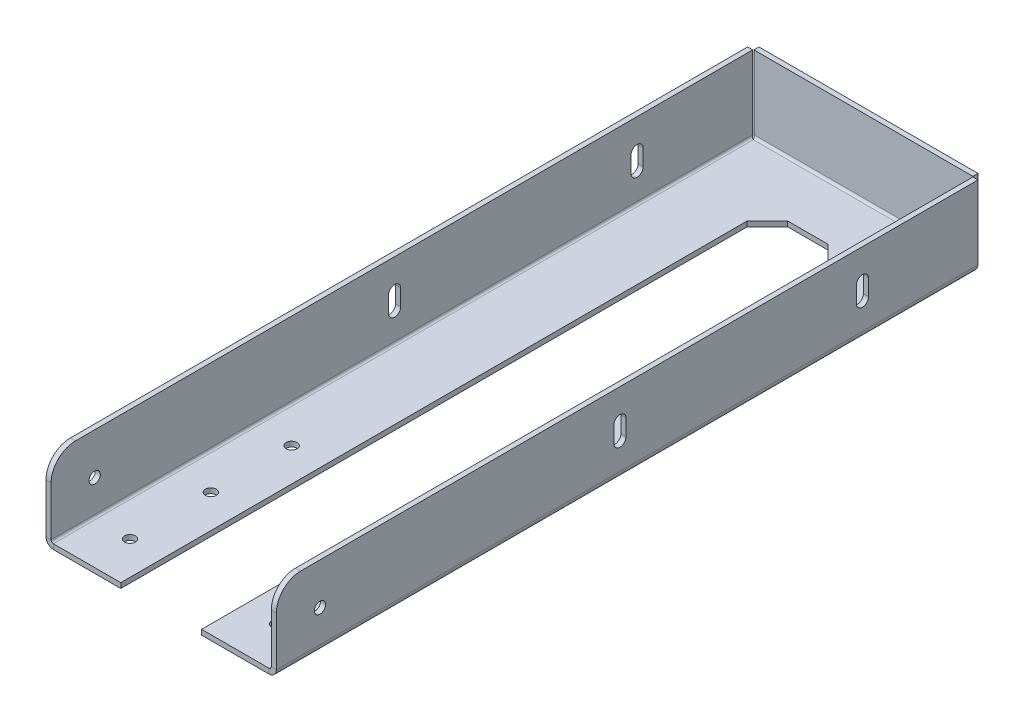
ISO-10303-21;
HEADER;
FILE_DESCRIPTION(('STEP AP214'),'2;1');
FILE_NAME('part.step','',(''),(''),'','','');
FILE_SCHEMA(('AUTOMOTIVE_DESIGN { 1 0 10303 214 1 1 1 1 }'));
ENDSEC;
DATA;
#1=APPLICATION_CONTEXT('core data for automotive mechanical design processes');
#2=APPLICATION_PROTOCOL_DEFINITION('international standard','automotive_design',2000,#1);
#3=PRODUCT_CONTEXT('',#1,'mechanical');
#4=PRODUCT('Part','Part','',(#3));
#5=PRODUCT_RELATED_PRODUCT_CATEGORY('part','',(#4));
#6=PRODUCT_DEFINITION_FORMATION('','',#4);
#7=PRODUCT_DEFINITION_CONTEXT('part definition',#1,'design');
#8=PRODUCT_DEFINITION('design','',#6,#7);
#9=PRODUCT_DEFINITION_SHAPE('','',#8);
#10=(LENGTH_UNIT() NAMED_UNIT(*) SI_UNIT(.MILLI.,.METRE.));
#11=(NAMED_UNIT(*) PLANE_ANGLE_UNIT() SI_UNIT($,.RADIAN.));
#12=(NAMED_UNIT(*) SI_UNIT($,.STERADIAN.) SOLID_ANGLE_UNIT());
#13=UNCERTAINTY_MEASURE_WITH_UNIT(LENGTH_MEASURE(1.E-05),#10,'distance_accuracy_value','');
#14=(GEOMETRIC_REPRESENTATION_CONTEXT(3) GLOBAL_UNCERTAINTY_ASSIGNED_CONTEXT((#13)) GLOBAL_UNIT_ASSIGNED_CONTEXT((#10,
#11,#12)) REPRESENTATION_CONTEXT('',''));
#15=CARTESIAN_POINT('',(0.,0.,0.));
#16=DIRECTION('',(0.,0.,1.));
#17=DIRECTION('',(1.,0.,0.));
#18=AXIS2_PLACEMENT_3D('',#15,#16,#17);
#19=CARTESIAN_POINT('',(0.,-1.6002,0.));
#20=DIRECTION('',(0.,-1.,0.));
#21=DIRECTION('',(0.,0.,-1.));
#22=AXIS2_PLACEMENT_3D('',#19,#20,#21);
#23=PLANE('',#22);
#24=CARTESIAN_POINT('',(29.7529,-1.6002,8.2549999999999));
#25=DIRECTION('',(0.,-1.,0.));
#26=DIRECTION('',(0.,0.,-1.));
#27=AXIS2_PLACEMENT_3D('',#24,#25,#26);
#28=CIRCLE('',#27,1.90499999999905);
#29=CARTESIAN_POINT('',(29.7529,-1.6002,6.35000000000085));
#30=VERTEX_POINT('',#29);
#31=EDGE_CURVE('E765',#30,#30,#28,.T.);
#32=ORIENTED_EDGE('',*,*,#31,.F.);
#33=EDGE_LOOP('',(#32));
#34=FACE_BOUND('',#33,.T.);
#35=CARTESIAN_POINT('',(23.1394000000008,-1.6002,97.783579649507));
#36=DIRECTION('',(0.,-1.,0.));
#37=DIRECTION('',(0.,0.,1.));
#38=AXIS2_PLACEMENT_3D('',#35,#36,#37);
#39=CIRCLE('',#38,1.71449999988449);
#40=CARTESIAN_POINT('',(23.1394000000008,-1.6002,99.4980796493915));
#41=VERTEX_POINT('',#40);
#42=EDGE_CURVE('E1564',#41,#41,#39,.T.);
#43=ORIENTED_EDGE('',*,*,#42,.F.);
#44=EDGE_LOOP('',(#43));
#45=FACE_BOUND('',#44,.T.);
#46=CARTESIAN_POINT('',(29.7529,-1.6002,74.2949999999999));
#47=DIRECTION('',(0.,-1.,0.));
#48=DIRECTION('',(0.,0.,-1.));
#49=AXIS2_PLACEMENT_3D('',#46,#47,#48);
#50=CIRCLE('',#49,1.90499999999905);
#51=CARTESIAN_POINT('',(29.7529,-1.6002,72.3900000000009));
#52=VERTEX_POINT('',#51);
#53=EDGE_CURVE('E1590',#52,#52,#50,.T.);
#54=ORIENTED_EDGE('',*,*,#53,.F.);
#55=EDGE_LOOP('',(#54));
#56=FACE_BOUND('',#55,.T.);
#57=CARTESIAN_POINT('',(-23.1394000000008,-1.6002,46.9835796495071));
#58=DIRECTION('',(0.,-1.,0.));
#59=DIRECTION('',(0.,0.,-1.));
#60=AXIS2_PLACEMENT_3D('',#57,#58,#59);
#61=CIRCLE('',#60,1.71449999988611);
#62=CARTESIAN_POINT('',(-23.1394000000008,-1.6002,45.2690796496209));
#63=VERTEX_POINT('',#62);
#64=EDGE_CURVE('E1588',#63,#63,#61,.T.);
#65=ORIENTED_EDGE('',*,*,#64,.F.);
#66=EDGE_LOOP('',(#65));
#67=FACE_BOUND('',#66,.T.);
#68=CARTESIAN_POINT('',(-23.1394000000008,-1.6002,97.783579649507));
#69=DIRECTION('',(0.,-1.,0.));
#70=DIRECTION('',(0.,0.,-1.));
#71=AXIS2_PLACEMENT_3D('',#68,#69,#70);
#72=CIRCLE('',#71,1.71449999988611);
#73=CARTESIAN_POINT('',(-23.1394000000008,-1.6002,96.0690796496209));
#74=VERTEX_POINT('',#73);
#75=EDGE_CURVE('E1583',#74,#74,#72,.T.);
#76=ORIENTED_EDGE('',*,*,#75,.F.);
#77=EDGE_LOOP('',(#76));
#78=FACE_BOUND('',#77,.T.);
#79=CARTESIAN_POINT('',(-23.1394000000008,-1.6002,72.3835796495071));
#80=DIRECTION('',(0.,-1.,0.));
#81=DIRECTION('',(0.,0.,-1.));
#82=AXIS2_PLACEMENT_3D('',#79,#80,#81);
#83=CIRCLE('',#82,1.71449999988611);
#84=CARTESIAN_POINT('',(-23.1394000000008,-1.6002,70.6690796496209));
#85=VERTEX_POINT('',#84);
#86=EDGE_CURVE('E1580',#85,#85,#83,.T.);
#87=ORIENTED_EDGE('',*,*,#86,.F.);
#88=EDGE_LOOP('',(#87));
#89=FACE_BOUND('',#88,.T.);
#90=DIRECTION('',(1.,0.,0.));
#91=VECTOR('',#90,1.);
#92=CARTESIAN_POINT('',(-36.195,-1.6002,111.125));
#93=LINE('',#92,#91);
#94=CARTESIAN_POINT('',(-33.8582,-1.6002,111.125));
#95=VERTEX_POINT('',#94);
#96=CARTESIAN_POINT('',(-12.7,-1.6002,111.125));
#97=VERTEX_POINT('',#96);
#98=EDGE_CURVE('E816',#95,#97,#93,.T.);
#99=ORIENTED_EDGE('',*,*,#98,.F.);
#100=DIRECTION('',(0.,0.,1.));
#101=VECTOR('',#100,1.);
#102=CARTESIAN_POINT('',(-33.8582,-1.6002,111.125));
#103=LINE('',#102,#101);
#104=CARTESIAN_POINT('',(-33.8582,-1.60020000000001,-108.7882));
#105=VERTEX_POINT('',#104);
#106=EDGE_CURVE('E508',#95,#105,#103,.F.);
#107=ORIENTED_EDGE('',*,*,#106,.T.);
#108=DIRECTION('',(-1.,0.,0.));
#109=VECTOR('',#108,1.);
#110=CARTESIAN_POINT('',(-34.4151948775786,-1.60020000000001,-108.7882));
#111=LINE('',#110,#109);
#112=CARTESIAN_POINT('',(33.8582,-1.6002,-108.7882));
#113=VERTEX_POINT('',#112);
#114=EDGE_CURVE('E589',#105,#113,#111,.F.);
#115=ORIENTED_EDGE('',*,*,#114,.T.);
#116=DIRECTION('',(0.,0.,-1.));
#117=VECTOR('',#116,1.);
#118=CARTESIAN_POINT('',(33.8582,-1.6002,-109.345194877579));
#119=LINE('',#118,#117);
#120=CARTESIAN_POINT('',(33.8582,-1.6002,111.125));
#121=VERTEX_POINT('',#120);
#122=EDGE_CURVE('E632',#113,#121,#119,.F.);
#123=ORIENTED_EDGE('',*,*,#122,.T.);
#124=DIRECTION('',(1.,0.,0.));
#125=VECTOR('',#124,1.);
#126=CARTESIAN_POINT('',(12.7,-1.6002,111.125));
#127=LINE('',#126,#125);
#128=CARTESIAN_POINT('',(12.7,-1.6002,111.125));
#129=VERTEX_POINT('',#128);
#130=EDGE_CURVE('E810',#129,#121,#127,.T.);
#131=ORIENTED_EDGE('',*,*,#130,.F.);
#132=DIRECTION('',(0.,0.,1.));
#133=VECTOR('',#132,1.);
#134=CARTESIAN_POINT('',(12.7,-1.6002,111.125));
#135=LINE('',#134,#133);
#136=CARTESIAN_POINT('',(12.7,-1.6002,-85.725));
#137=VERTEX_POINT('',#136);
#138=EDGE_CURVE('E830',#137,#129,#135,.T.);
#139=ORIENTED_EDGE('',*,*,#138,.F.);
#140=DIRECTION('',(0.70710678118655,0.,0.707106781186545));
#141=VECTOR('',#140,1.);
#142=CARTESIAN_POINT('',(6.34999999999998,-1.6002,-92.075));
#143=LINE('',#142,#141);
#144=CARTESIAN_POINT('',(6.34999999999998,-1.6002,-92.075));
#145=VERTEX_POINT('',#144);
#146=EDGE_CURVE('E769',#137,#145,#143,.F.);
#147=ORIENTED_EDGE('',*,*,#146,.T.);
#148=DIRECTION('',(1.,0.,0.));
#149=VECTOR('',#148,1.);
#150=CARTESIAN_POINT('',(-12.7,-1.6002,-92.075));
#151=LINE('',#150,#149);
#152=CARTESIAN_POINT('',(-6.35,-1.6002,-92.075));
#153=VERTEX_POINT('',#152);
#154=EDGE_CURVE('E832',#153,#145,#151,.T.);
#155=ORIENTED_EDGE('',*,*,#154,.F.);
#156=DIRECTION('',(0.707106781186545,0.,-0.70710678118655));
#157=VECTOR('',#156,1.);
#158=CARTESIAN_POINT('',(-12.7,-1.6002,-85.725));
#159=LINE('',#158,#157);
#160=CARTESIAN_POINT('',(-12.7,-1.6002,-85.725));
#161=VERTEX_POINT('',#160);
#162=EDGE_CURVE('E747',#153,#161,#159,.F.);
#163=ORIENTED_EDGE('',*,*,#162,.T.);
#164=DIRECTION('',(0.,0.,-1.));
#165=VECTOR('',#164,1.);
#166=CARTESIAN_POINT('',(-12.7,-1.6002,111.125));
#167=LINE('',#166,#165);
#168=EDGE_CURVE('E835',#97,#161,#167,.T.);
#169=ORIENTED_EDGE('',*,*,#168,.F.);
#170=EDGE_LOOP('',(#99,#107,#115,#123,#131,#139,#147,#155,#163,#169));
#171=FACE_BOUND('',#170,.T.);
#172=ADVANCED_FACE('F102',(#34,#45,#56,#67,#78,#89,#171),#23,.T.);
#173=CARTESIAN_POINT('',(0.,0.,0.));
#174=DIRECTION('',(0.,-1.,0.));
#175=DIRECTION('',(0.,0.,-1.));
#176=AXIS2_PLACEMENT_3D('',#173,#174,#175);
#177=PLANE('',#176);
#178=CARTESIAN_POINT('',(29.7529,0.,8.2549999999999));
#179=DIRECTION('',(0.,-1.,0.));
#180=DIRECTION('',(0.,0.,-1.));
#181=AXIS2_PLACEMENT_3D('',#178,#179,#180);
#182=CIRCLE('',#181,1.90499999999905);
#183=CARTESIAN_POINT('',(29.7529,0.,6.35000000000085));
#184=VERTEX_POINT('',#183);
#185=EDGE_CURVE('E431',#184,#184,#182,.T.);
#186=ORIENTED_EDGE('',*,*,#185,.T.);
#187=EDGE_LOOP('',(#186));
#188=FACE_BOUND('',#187,.T.);
#189=CARTESIAN_POINT('',(23.1394000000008,0.,97.783579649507));
#190=DIRECTION('',(0.,-1.,0.));
#191=DIRECTION('',(0.,0.,-1.));
#192=AXIS2_PLACEMENT_3D('',#189,#190,#191);
#193=CIRCLE('',#192,1.71449999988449);
#194=CARTESIAN_POINT('',(23.1394000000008,0.,96.0690796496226));
#195=VERTEX_POINT('',#194);
#196=EDGE_CURVE('E750',#195,#195,#193,.T.);
#197=ORIENTED_EDGE('',*,*,#196,.T.);
#198=EDGE_LOOP('',(#197));
#199=FACE_BOUND('',#198,.T.);
#200=CARTESIAN_POINT('',(29.7529,0.,74.2949999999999));
#201=DIRECTION('',(0.,-1.,0.));
#202=DIRECTION('',(0.,0.,-1.));
#203=AXIS2_PLACEMENT_3D('',#200,#201,#202);
#204=CIRCLE('',#203,1.90499999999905);
#205=CARTESIAN_POINT('',(29.7529,0.,72.3900000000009));
#206=VERTEX_POINT('',#205);
#207=EDGE_CURVE('E753',#206,#206,#204,.T.);
#208=ORIENTED_EDGE('',*,*,#207,.T.);
#209=EDGE_LOOP('',(#208));
#210=FACE_BOUND('',#209,.T.);
#211=CARTESIAN_POINT('',(-23.1394000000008,0.,46.9835796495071));
#212=DIRECTION('',(0.,-1.,0.));
#213=DIRECTION('',(0.,0.,-1.));
#214=AXIS2_PLACEMENT_3D('',#211,#212,#213);
#215=CIRCLE('',#214,1.71449999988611);
#216=CARTESIAN_POINT('',(-23.1394000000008,0.,45.2690796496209));
#217=VERTEX_POINT('',#216);
#218=EDGE_CURVE('E756',#217,#217,#215,.T.);
#219=ORIENTED_EDGE('',*,*,#218,.T.);
#220=EDGE_LOOP('',(#219));
#221=FACE_BOUND('',#220,.T.);
#222=CARTESIAN_POINT('',(-23.1394000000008,0.,97.783579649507));
#223=DIRECTION('',(0.,-1.,0.));
#224=DIRECTION('',(0.,0.,-1.));
#225=AXIS2_PLACEMENT_3D('',#222,#223,#224);
#226=CIRCLE('',#225,1.71449999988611);
#227=CARTESIAN_POINT('',(-23.1394000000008,0.,96.0690796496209));
#228=VERTEX_POINT('',#227);
#229=EDGE_CURVE('E759',#228,#228,#226,.T.);
#230=ORIENTED_EDGE('',*,*,#229,.T.);
#231=EDGE_LOOP('',(#230));
#232=FACE_BOUND('',#231,.T.);
#233=CARTESIAN_POINT('',(-23.1394000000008,0.,72.3835796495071));
#234=DIRECTION('',(0.,-1.,0.));
#235=DIRECTION('',(0.,0.,-1.));
#236=AXIS2_PLACEMENT_3D('',#233,#234,#235);
#237=CIRCLE('',#236,1.71449999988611);
#238=CARTESIAN_POINT('',(-23.1394000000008,0.,70.6690796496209));
#239=VERTEX_POINT('',#238);
#240=EDGE_CURVE('E762',#239,#239,#237,.T.);
#241=ORIENTED_EDGE('',*,*,#240,.T.);
#242=EDGE_LOOP('',(#241));
#243=FACE_BOUND('',#242,.T.);
#244=DIRECTION('',(0.,0.,1.));
#245=VECTOR('',#244,1.);
#246=CARTESIAN_POINT('',(-33.8582,0.,111.125));
#247=LINE('',#246,#245);
#248=CARTESIAN_POINT('',(-33.8582,0.,111.125));
#249=VERTEX_POINT('',#248);
#250=CARTESIAN_POINT('',(-33.8582,0.,-108.7882));
#251=VERTEX_POINT('',#250);
#252=EDGE_CURVE('E512',#249,#251,#247,.F.);
#253=ORIENTED_EDGE('',*,*,#252,.F.);
#254=DIRECTION('',(1.,0.,0.));
#255=VECTOR('',#254,1.);
#256=CARTESIAN_POINT('',(-36.195,0.,111.125));
#257=LINE('',#256,#255);
#258=CARTESIAN_POINT('',(-12.7,0.,111.125));
#259=VERTEX_POINT('',#258);
#260=EDGE_CURVE('E825',#249,#259,#257,.T.);
#261=ORIENTED_EDGE('',*,*,#260,.T.);
#262=DIRECTION('',(0.,0.,-1.));
#263=VECTOR('',#262,1.);
#264=CARTESIAN_POINT('',(-12.7,0.,111.125));
#265=LINE('',#264,#263);
#266=CARTESIAN_POINT('',(-12.7,0.,-85.725));
#267=VERTEX_POINT('',#266);
#268=EDGE_CURVE('E822',#259,#267,#265,.T.);
#269=ORIENTED_EDGE('',*,*,#268,.T.);
#270=DIRECTION('',(-0.707106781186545,0.,0.70710678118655));
#271=VECTOR('',#270,1.);
#272=CARTESIAN_POINT('',(-49.2125,0.,-49.2124999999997));
#273=LINE('',#272,#271);
#274=CARTESIAN_POINT('',(-6.35,0.,-92.075));
#275=VERTEX_POINT('',#274);
#276=EDGE_CURVE('E767',#267,#275,#273,.F.);
#277=ORIENTED_EDGE('',*,*,#276,.T.);
#278=DIRECTION('',(1.,0.,0.));
#279=VECTOR('',#278,1.);
#280=CARTESIAN_POINT('',(-12.7,0.,-92.075));
#281=LINE('',#280,#279);
#282=CARTESIAN_POINT('',(6.34999999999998,0.,-92.075));
#283=VERTEX_POINT('',#282);
#284=EDGE_CURVE('E819',#275,#283,#281,.T.);
#285=ORIENTED_EDGE('',*,*,#284,.T.);
#286=DIRECTION('',(-0.70710678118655,0.,-0.707106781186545));
#287=VECTOR('',#286,1.);
#288=CARTESIAN_POINT('',(49.2125,0.,-49.2125000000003));
#289=LINE('',#288,#287);
#290=CARTESIAN_POINT('',(12.7,0.,-85.725));
#291=VERTEX_POINT('',#290);
#292=EDGE_CURVE('E771',#283,#291,#289,.F.);
#293=ORIENTED_EDGE('',*,*,#292,.T.);
#294=DIRECTION('',(0.,0.,1.));
#295=VECTOR('',#294,1.);
#296=CARTESIAN_POINT('',(12.7,0.,111.125));
#297=LINE('',#296,#295);
#298=CARTESIAN_POINT('',(12.7,0.,111.125));
#299=VERTEX_POINT('',#298);
#300=EDGE_CURVE('E817',#291,#299,#297,.T.);
#301=ORIENTED_EDGE('',*,*,#300,.T.);
#302=DIRECTION('',(1.,0.,0.));
#303=VECTOR('',#302,1.);
#304=CARTESIAN_POINT('',(12.7,0.,111.125));
#305=LINE('',#304,#303);
#306=CARTESIAN_POINT('',(33.8582,0.,111.125));
#307=VERTEX_POINT('',#306);
#308=EDGE_CURVE('E813',#299,#307,#305,.T.);
#309=ORIENTED_EDGE('',*,*,#308,.T.);
#310=DIRECTION('',(0.,0.,-1.));
#311=VECTOR('',#310,1.);
#312=CARTESIAN_POINT('',(33.8582,0.,-109.345194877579));
#313=LINE('',#312,#311);
#314=CARTESIAN_POINT('',(33.8582,0.,-108.7882));
#315=VERTEX_POINT('',#314);
#316=EDGE_CURVE('E637',#315,#307,#313,.F.);
#317=ORIENTED_EDGE('',*,*,#316,.F.);
#318=DIRECTION('',(-1.,0.,0.));
#319=VECTOR('',#318,1.);
#320=CARTESIAN_POINT('',(-34.4151948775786,0.,-108.7882));
#321=LINE('',#320,#319);
#322=EDGE_CURVE('E862',#251,#315,#321,.F.);
#323=ORIENTED_EDGE('',*,*,#322,.F.);
#324=EDGE_LOOP('',(#253,#261,#269,#277,#285,#293,#301,#309,#317,#323));
#325=FACE_BOUND('',#324,.T.);
#326=ADVANCED_FACE('F677',(#188,#199,#210,#221,#232,#243,#325),#177,.F.);
#327=CARTESIAN_POINT('',(-36.195,-1.6002,111.125));
#328=DIRECTION('',(0.,0.,1.));
#329=DIRECTION('',(1.,0.,0.));
#330=AXIS2_PLACEMENT_3D('',#327,#328,#329);
#331=PLANE('',#330);
#332=ORIENTED_EDGE('',*,*,#260,.F.);
#333=DIRECTION('',(0.,-1.,0.));
#334=VECTOR('',#333,1.);
#335=CARTESIAN_POINT('',(-33.8582,0.,111.125));
#336=LINE('',#335,#334);
#337=EDGE_CURVE('E873',#249,#95,#336,.T.);
#338=ORIENTED_EDGE('',*,*,#337,.T.);
#339=ORIENTED_EDGE('',*,*,#98,.T.);
#340=DIRECTION('',(0.,1.,0.));
#341=VECTOR('',#340,1.);
#342=CARTESIAN_POINT('',(-12.7,-1.6002,111.125));
#343=LINE('',#342,#341);
#344=EDGE_CURVE('E807',#97,#259,#343,.T.);
#345=ORIENTED_EDGE('',*,*,#344,.T.);
#346=EDGE_LOOP('',(#332,#338,#339,#345));
#347=FACE_BOUND('',#346,.T.);
#348=ADVANCED_FACE('F681',(#347),#331,.T.);
#349=CARTESIAN_POINT('',(12.7,-1.6002,111.125));
#350=DIRECTION('',(0.,0.,1.));
#351=DIRECTION('',(1.,0.,0.));
#352=AXIS2_PLACEMENT_3D('',#349,#350,#351);
#353=PLANE('',#352);
#354=DIRECTION('',(0.,-1.,0.));
#355=VECTOR('',#354,1.);
#356=CARTESIAN_POINT('',(33.8582,0.,111.125));
#357=LINE('',#356,#355);
#358=EDGE_CURVE('E827',#307,#121,#357,.T.);
#359=ORIENTED_EDGE('',*,*,#358,.F.);
#360=ORIENTED_EDGE('',*,*,#308,.F.);
#361=DIRECTION('',(0.,1.,0.));
#362=VECTOR('',#361,1.);
#363=CARTESIAN_POINT('',(12.7,-1.6002,111.125));
#364=LINE('',#363,#362);
#365=EDGE_CURVE('E806',#129,#299,#364,.T.);
#366=ORIENTED_EDGE('',*,*,#365,.F.);
#367=ORIENTED_EDGE('',*,*,#130,.T.);
#368=EDGE_LOOP('',(#359,#360,#366,#367));
#369=FACE_BOUND('',#368,.T.);
#370=ADVANCED_FACE('F683',(#369),#353,.T.);
#371=CARTESIAN_POINT('',(12.7,-1.6002,111.125));
#372=DIRECTION('',(-1.,0.,0.));
#373=DIRECTION('',(0.,0.,1.));
#374=AXIS2_PLACEMENT_3D('',#371,#372,#373);
#375=PLANE('',#374);
#376=ORIENTED_EDGE('',*,*,#300,.F.);
#377=DIRECTION('',(0.,-1.,0.));
#378=VECTOR('',#377,1.);
#379=CARTESIAN_POINT('',(12.7,-1.6002,-85.725));
#380=LINE('',#379,#378);
#381=EDGE_CURVE('E776',#291,#137,#380,.T.);
#382=ORIENTED_EDGE('',*,*,#381,.T.);
#383=ORIENTED_EDGE('',*,*,#138,.T.);
#384=ORIENTED_EDGE('',*,*,#365,.T.);
#385=EDGE_LOOP('',(#376,#382,#383,#384));
#386=FACE_BOUND('',#385,.T.);
#387=ADVANCED_FACE('F686',(#386),#375,.T.);
#388=CARTESIAN_POINT('',(-12.7,-1.6002,-92.075));
#389=DIRECTION('',(0.,0.,1.));
#390=DIRECTION('',(1.,0.,0.));
#391=AXIS2_PLACEMENT_3D('',#388,#389,#390);
#392=PLANE('',#391);
#393=ORIENTED_EDGE('',*,*,#154,.T.);
#394=DIRECTION('',(0.,1.,0.));
#395=VECTOR('',#394,1.);
#396=CARTESIAN_POINT('',(6.34999999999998,0.,-92.075));
#397=LINE('',#396,#395);
#398=EDGE_CURVE('E778',#145,#283,#397,.T.);
#399=ORIENTED_EDGE('',*,*,#398,.T.);
#400=ORIENTED_EDGE('',*,*,#284,.F.);
#401=DIRECTION('',(0.,-1.,0.));
#402=VECTOR('',#401,1.);
#403=CARTESIAN_POINT('',(-6.35,-1.6002,-92.075));
#404=LINE('',#403,#402);
#405=EDGE_CURVE('E781',#275,#153,#404,.T.);
#406=ORIENTED_EDGE('',*,*,#405,.T.);
#407=EDGE_LOOP('',(#393,#399,#400,#406));
#408=FACE_BOUND('',#407,.T.);
#409=ADVANCED_FACE('F690',(#408),#392,.T.);
#410=CARTESIAN_POINT('',(-12.7,-1.6002,111.125));
#411=DIRECTION('',(1.,0.,0.));
#412=DIRECTION('',(0.,0.,-1.));
#413=AXIS2_PLACEMENT_3D('',#410,#411,#412);
#414=PLANE('',#413);
#415=ORIENTED_EDGE('',*,*,#168,.T.);
#416=DIRECTION('',(0.,1.,0.));
#417=VECTOR('',#416,1.);
#418=CARTESIAN_POINT('',(-12.7,0.,-85.725));
#419=LINE('',#418,#417);
#420=EDGE_CURVE('E773',#161,#267,#419,.T.);
#421=ORIENTED_EDGE('',*,*,#420,.T.);
#422=ORIENTED_EDGE('',*,*,#268,.F.);
#423=ORIENTED_EDGE('',*,*,#344,.F.);
#424=EDGE_LOOP('',(#415,#421,#422,#423));
#425=FACE_BOUND('',#424,.T.);
#426=ADVANCED_FACE('F663',(#425),#414,.T.);
#427=CARTESIAN_POINT('',(33.8582,0.7366,111.125));
#428=DIRECTION('',(0.,0.,1.));
#429=DIRECTION('',(1.,0.,0.));
#430=AXIS2_PLACEMENT_3D('',#427,#428,#429);
#431=PLANE('',#430);
#432=DIRECTION('',(-1.,0.,0.));
#433=VECTOR('',#432,1.);
#434=CARTESIAN_POINT('',(36.195,0.736599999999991,111.125));
#435=LINE('',#434,#433);
#436=CARTESIAN_POINT('',(34.5948,0.736599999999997,111.125));
#437=VERTEX_POINT('',#436);
#438=CARTESIAN_POINT('',(36.195,0.736599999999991,111.125));
#439=VERTEX_POINT('',#438);
#440=EDGE_CURVE('E619',#437,#439,#435,.F.);
#441=ORIENTED_EDGE('',*,*,#440,.F.);
#442=CARTESIAN_POINT('',(33.8582,0.7366,111.125));
#443=DIRECTION('',(0.,0.,-1.));
#444=DIRECTION('',(-1.,0.,0.));
#445=AXIS2_PLACEMENT_3D('',#442,#443,#444);
#446=CIRCLE('',#445,0.736599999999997);
#447=EDGE_CURVE('E633',#307,#437,#446,.F.);
#448=ORIENTED_EDGE('',*,*,#447,.F.);
#449=ORIENTED_EDGE('',*,*,#358,.T.);
#450=CARTESIAN_POINT('',(33.8582,0.7366,111.125));
#451=DIRECTION('',(0.,0.,-1.));
#452=DIRECTION('',(-1.,0.,0.));
#453=AXIS2_PLACEMENT_3D('',#450,#451,#452);
#454=CIRCLE('',#453,2.3368);
#455=EDGE_CURVE('E628',#121,#439,#454,.F.);
#456=ORIENTED_EDGE('',*,*,#455,.T.);
#457=EDGE_LOOP('',(#441,#448,#449,#456));
#458=FACE_BOUND('',#457,.T.);
#459=ADVANCED_FACE('F659',(#458),#431,.T.);
#460=CARTESIAN_POINT('',(36.211002,0.736599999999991,-109.345194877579));
#461=CARTESIAN_POINT('',(36.211002,0.428564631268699,-109.298770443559));
#462=CARTESIAN_POINT('',(36.1497648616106,0.12075905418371,-109.252362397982));
#463=CARTESIAN_POINT('',(35.9140463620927,-0.448315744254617,-109.159529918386));
#464=CARTESIAN_POINT('',(35.7396577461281,-0.709306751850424,-109.113113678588));
#465=CARTESIAN_POINT('',(35.3041067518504,-1.14485774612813,-109.020281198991));
#466=CARTESIAN_POINT('',(35.0431157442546,-1.31924636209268,-108.973864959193));
#467=CARTESIAN_POINT('',(34.4740409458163,-1.55496486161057,-108.881032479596));
#468=CARTESIAN_POINT('',(34.1662353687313,-1.616202,-108.83462443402));
#469=CARTESIAN_POINT('',(33.8582,-1.616202,-108.7882));
#470=CARTESIAN_POINT('',(36.195,0.736599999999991,-109.345194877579));
#471=CARTESIAN_POINT('',(36.195,0.430659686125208,-109.29877045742));
#472=CARTESIAN_POINT('',(36.1341793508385,0.124947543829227,-109.252362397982));
#473=CARTESIAN_POINT('',(35.9000640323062,-0.440256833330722,-109.159529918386));
#474=CARTESIAN_POINT('',(35.7268614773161,-0.699472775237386,-109.113113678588));
#475=CARTESIAN_POINT('',(35.2942727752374,-1.13206147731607,-109.020281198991));
#476=CARTESIAN_POINT('',(35.0350568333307,-1.30526403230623,-108.973864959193));
#477=CARTESIAN_POINT('',(34.4698524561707,-1.53937935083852,-108.881032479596));
#478=CARTESIAN_POINT('',(34.1641403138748,-1.6002,-108.834624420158));
#479=CARTESIAN_POINT('',(33.8582,-1.6002,-108.7882));
#480=CARTESIAN_POINT('',(34.5948,0.736599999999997,-109.345194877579));
#481=CARTESIAN_POINT('',(34.5948,0.640165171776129,-109.298771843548));
#482=CARTESIAN_POINT('',(34.5756282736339,0.543796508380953,-109.252362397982));
#483=CARTESIAN_POINT('',(34.5018310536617,0.365634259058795,-109.159529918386));
#484=CARTESIAN_POINT('',(34.4472345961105,0.283924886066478,-109.113113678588));
#485=CARTESIAN_POINT('',(34.3108751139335,0.147565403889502,-109.020281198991));
#486=CARTESIAN_POINT('',(34.2291657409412,0.0929689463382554,-108.973864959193));
#487=CARTESIAN_POINT('',(34.051003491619,0.0191717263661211,-108.881032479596));
#488=CARTESIAN_POINT('',(33.9546348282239,0.,-108.834623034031));
#489=CARTESIAN_POINT('',(33.8582,0.,-108.7882));
#490=CARTESIAN_POINT('',(34.57863798,0.736599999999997,-109.345194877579));
#491=CARTESIAN_POINT('',(34.57863798,0.642281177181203,-109.298771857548));
#492=CARTESIAN_POINT('',(34.5598869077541,0.548026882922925,-109.252362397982));
#493=CARTESIAN_POINT('',(34.4877089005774,0.373773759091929,-109.159529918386));
#494=CARTESIAN_POINT('',(34.4343103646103,0.293857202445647,-109.113113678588));
#495=CARTESIAN_POINT('',(34.3009427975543,0.160489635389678,-109.020281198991));
#496=CARTESIAN_POINT('',(34.2210262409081,0.107091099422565,-108.973864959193));
#497=CARTESIAN_POINT('',(34.0467731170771,0.034913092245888,-108.881032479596));
#498=CARTESIAN_POINT('',(33.9525188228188,0.0161620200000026,-108.834623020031));
#499=CARTESIAN_POINT('',(33.8582,0.0161620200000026,-108.7882));
#500=B_SPLINE_SURFACE_WITH_KNOTS('',1,3,((#460,#461,#462,#463,#464,#465,#466,#467,#468,#469),
(#470,#471,#472,#473,#474,#475,#476,#477,#478,#479),(#480,#481,#482,#483,#484,#485,#486,#487,
#488,#489),(#490,#491,#492,#493,#494,#495,#496,#497,#498,#499)),.UNSPECIFIED.,.F.,.F.,.F.,(2,1,
1,2),(4,2,2,2,4),(-0.01,0.,1.,1.0101),(0.,0.25,0.5,0.75,1.),.UNSPECIFIED.);
#501=CARTESIAN_POINT('',(34.5948,0.736599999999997,-109.345194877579));
#502=CARTESIAN_POINT('',(34.5948002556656,0.724547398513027,-109.339392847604));
#503=CARTESIAN_POINT('',(34.5945041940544,0.712494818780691,-109.333590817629));
#504=CARTESIAN_POINT('',(34.5933212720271,0.688418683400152,-109.32198675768));
#505=CARTESIAN_POINT('',(34.592434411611,0.676395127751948,-109.316184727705));
#506=CARTESIAN_POINT('',(34.5900717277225,0.652406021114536,-109.304580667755));
#507=CARTESIAN_POINT('',(34.5885959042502,0.640440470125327,-109.29877863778));
#508=CARTESIAN_POINT('',(34.5850589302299,0.616596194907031,-109.287174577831));
#509=CARTESIAN_POINT('',(34.582997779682,0.604717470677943,-109.281372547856));
#510=CARTESIAN_POINT('',(34.578295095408,0.581075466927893,-109.269768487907));
#511=CARTESIAN_POINT('',(34.575653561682,0.569312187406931,-109.263966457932));
#512=CARTESIAN_POINT('',(34.5697964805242,0.545929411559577,-109.252362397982));
#513=CARTESIAN_POINT('',(34.5665809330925,0.534309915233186,-109.246560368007));
#514=CARTESIAN_POINT('',(34.5595835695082,0.511242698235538,-109.234956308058));
#515=CARTESIAN_POINT('',(34.5558017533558,0.499794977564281,-109.229154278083));
#516=CARTESIAN_POINT('',(34.5476809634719,0.477098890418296,-109.217550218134));
#517=CARTESIAN_POINT('',(34.5433419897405,0.465850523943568,-109.211748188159));
#518=CARTESIAN_POINT('',(34.5341173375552,0.443580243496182,-109.200144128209));
#519=CARTESIAN_POINT('',(34.5292316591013,0.432558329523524,-109.194342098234));
#520=CARTESIAN_POINT('',(34.5189253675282,0.410767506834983,-109.182738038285));
#521=CARTESIAN_POINT('',(34.513504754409,0.399998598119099,-109.17693600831));
#522=CARTESIAN_POINT('',(34.502141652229,0.37873972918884,-109.165331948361));
#523=CARTESIAN_POINT('',(34.4961991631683,0.368249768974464,-109.159529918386));
#524=CARTESIAN_POINT('',(34.4838066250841,0.347574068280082,-109.147925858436));
#525=CARTESIAN_POINT('',(34.4773565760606,0.337388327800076,-109.142123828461));
#526=CARTESIAN_POINT('',(34.4639644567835,0.317345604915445,-109.130519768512));
#527=CARTESIAN_POINT('',(34.4570223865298,0.307488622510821,-109.124717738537));
#528=CARTESIAN_POINT('',(34.4426629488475,0.288127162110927,-109.113113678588));
#529=CARTESIAN_POINT('',(34.435245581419,0.278622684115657,-109.107311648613));
#530=CARTESIAN_POINT('',(34.419953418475,0.259989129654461,-109.095707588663));
#531=CARTESIAN_POINT('',(34.4120786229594,0.250860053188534,-109.089905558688));
#532=CARTESIAN_POINT('',(34.3958905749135,0.23299929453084,-109.078301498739));
#533=CARTESIAN_POINT('',(34.3875773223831,0.224267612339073,-109.072499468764));
#534=CARTESIAN_POINT('',(34.3705323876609,0.207222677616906,-109.060895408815));
#535=CARTESIAN_POINT('',(34.3618007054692,0.198909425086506,-109.05509337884));
#536=CARTESIAN_POINT('',(34.3439399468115,0.18272137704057,-109.04348931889));
#537=CARTESIAN_POINT('',(34.3348108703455,0.174846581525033,-109.037687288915));
#538=CARTESIAN_POINT('',(34.3161773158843,0.159554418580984,-109.026083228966));
#539=CARTESIAN_POINT('',(34.3066728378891,0.152137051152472,-109.020281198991));
#540=CARTESIAN_POINT('',(34.2873113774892,0.137777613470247,-109.008677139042));
#541=CARTESIAN_POINT('',(34.2774543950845,0.130835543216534,-109.002875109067));
#542=CARTESIAN_POINT('',(34.2574116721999,0.117443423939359,-108.991271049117));
#543=CARTESIAN_POINT('',(34.2472259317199,0.110993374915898,-108.985469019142));
#544=CARTESIAN_POINT('',(34.2265502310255,0.0986008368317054,-108.973864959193));
#545=CARTESIAN_POINT('',(34.2160602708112,0.0926583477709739,-108.968062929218));
#546=CARTESIAN_POINT('',(34.1948014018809,0.0812952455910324,-108.956458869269));
#547=CARTESIAN_POINT('',(34.184032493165,0.0758746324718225,-108.950656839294));
#548=CARTESIAN_POINT('',(34.1622416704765,0.0655683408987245,-108.939052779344));
#549=CARTESIAN_POINT('',(34.1512197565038,0.0606826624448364,-108.933250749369));
#550=CARTESIAN_POINT('',(34.1289494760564,0.05145801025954,-108.92164668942));
#551=CARTESIAN_POINT('',(34.1177011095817,0.0471190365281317,-108.915844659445));
#552=CARTESIAN_POINT('',(34.0950050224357,0.0389982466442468,-108.904240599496));
#553=CARTESIAN_POINT('',(34.0835573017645,0.0352164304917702,-108.898438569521));
#554=CARTESIAN_POINT('',(34.0604900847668,0.0282190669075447,-108.886834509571));
#555=CARTESIAN_POINT('',(34.0488705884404,0.0250035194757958,-108.881032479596));
#556=CARTESIAN_POINT('',(34.0254878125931,0.0191464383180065,-108.869428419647));
#557=CARTESIAN_POINT('',(34.0137245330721,0.0165049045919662,-108.863626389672));
#558=CARTESIAN_POINT('',(33.9900825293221,0.0118022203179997,-108.852022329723));
#559=CARTESIAN_POINT('',(33.978203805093,0.00974106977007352,-108.846220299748));
#560=CARTESIAN_POINT('',(33.9543595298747,0.00620409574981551,-108.834616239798));
#561=CARTESIAN_POINT('',(33.9423939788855,0.00472827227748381,-108.828814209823));
#562=CARTESIAN_POINT('',(33.918404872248,0.00236558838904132,-108.817210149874));
#563=CARTESIAN_POINT('',(33.9063813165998,0.00147872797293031,-108.811408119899));
#564=CARTESIAN_POINT('',(33.8823051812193,0.000295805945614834,-108.79980405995));
#565=CARTESIAN_POINT('',(33.870252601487,-2.55665589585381E-07,-108.794002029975));
#566=CARTESIAN_POINT('',(33.8582,0.,-108.7882));
#567=B_SPLINE_CURVE_WITH_KNOTS('',3,(#501,#502,#503,#504,#505,#506,#507,#508,#509,#510,#511,
#512,#513,#514,#515,#516,#517,#518,#519,#520,#521,#522,#523,#524,#525,#526,#527,#528,#529,#530,
#531,#532,#533,#534,#535,#536,#537,#538,#539,#540,#541,#542,#543,#544,#545,#546,#547,#548,#549,
#550,#551,#552,#553,#554,#555,#556,#557,#558,#559,#560,#561,#562,#563,#564,#565,#566),
.UNSPECIFIED.,.F.,.F.,(4,2,2,2,2,2,2,2,2,2,2,2,2,2,2,2,2,2,2,2,2,2,2,2,2,2,2,2,2,2,2,2,4),(0.,
0.0401259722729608,0.0802519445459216,0.120377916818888,0.160503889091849,0.200629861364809,
0.240755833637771,0.280881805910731,0.321007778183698,0.361133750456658,0.401259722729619,
0.44138569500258,0.48151166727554,0.521637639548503,0.561763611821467,0.601889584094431,
0.642015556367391,0.68214152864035,0.722267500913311,0.76239347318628,0.802519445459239,
0.842645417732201,0.882771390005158,0.922897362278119,0.963023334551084,1.00314930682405,
1.04327527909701,1.08340125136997,1.12352722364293,1.16365319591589,1.20377916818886,
1.24390514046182,1.28403111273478),.UNSPECIFIED.);
#568=CARTESIAN_POINT('',(34.5948,0.736599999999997,-109.345194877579));
#569=VERTEX_POINT('',#568);
#570=EDGE_CURVE('E605',#569,#315,#567,.T.);
#571=DIRECTION('',(1.,0.,0.));
#572=VECTOR('',#571,1.);
#573=CARTESIAN_POINT('',(34.5948,0.736599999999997,-109.345194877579));
#574=LINE('',#573,#572);
#575=CARTESIAN_POINT('',(36.195,0.736599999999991,-109.345194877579));
#576=VERTEX_POINT('',#575);
#577=EDGE_CURVE('E602',#576,#569,#574,.F.);
#578=CARTESIAN_POINT('',(36.195,0.736599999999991,-109.345194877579));
#579=CARTESIAN_POINT('',(36.195000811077,0.698364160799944,-109.339392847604));
#580=CARTESIAN_POINT('',(36.194061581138,0.660128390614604,-109.333590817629));
#581=CARTESIAN_POINT('',(36.1903088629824,0.583748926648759,-109.32198675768));
#582=CARTESIAN_POINT('',(36.1874953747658,0.545605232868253,-109.316184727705));
#583=CARTESIAN_POINT('',(36.1799999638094,0.469501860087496,-109.304580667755));
#584=CARTESIAN_POINT('',(36.1753180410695,0.431542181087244,-109.29877863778));
#585=CARTESIAN_POINT('',(36.1640972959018,0.355898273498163,-109.287174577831));
#586=CARTESIAN_POINT('',(36.1575584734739,0.318214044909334,-109.281372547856));
#587=CARTESIAN_POINT('',(36.1426396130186,0.243211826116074,-109.269768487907));
#588=CARTESIAN_POINT('',(36.1342595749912,0.205893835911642,-109.263966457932));
#589=CARTESIAN_POINT('',(36.1156784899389,0.131713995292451,-109.252362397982));
#590=CARTESIAN_POINT('',(36.105477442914,0.0948521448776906,-109.246560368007));
#591=CARTESIAN_POINT('',(36.083278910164,0.0216733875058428,-109.234956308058));
#592=CARTESIAN_POINT('',(36.0712814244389,-0.014643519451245,-109.229154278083));
#593=CARTESIAN_POINT('',(36.0455189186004,-0.0866448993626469,-109.217550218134));
#594=CARTESIAN_POINT('',(36.031753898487,-0.122329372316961,-109.211748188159));
#595=CARTESIAN_POINT('',(36.0024894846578,-0.192979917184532,-109.200144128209));
#596=CARTESIAN_POINT('',(35.986990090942,-0.227945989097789,-109.194342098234));
#597=CARTESIAN_POINT('',(35.9542942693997,-0.297075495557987,-109.182738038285));
#598=CARTESIAN_POINT('',(35.9370978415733,-0.331238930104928,-109.17693600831));
#599=CARTESIAN_POINT('',(35.9010493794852,-0.398680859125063,-109.165331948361));
#600=CARTESIAN_POINT('',(35.8821973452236,-0.431959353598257,-109.159529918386));
#601=CARTESIAN_POINT('',(35.8428830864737,-0.497551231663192,-109.147925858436));
#602=CARTESIAN_POINT('',(35.8224208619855,-0.529864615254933,-109.142123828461));
#603=CARTESIAN_POINT('',(35.7799355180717,-0.593448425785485,-109.130519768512));
#604=CARTESIAN_POINT('',(35.7579123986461,-0.624718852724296,-109.124717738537));
#605=CARTESIAN_POINT('',(35.7123583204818,-0.686141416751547,-109.113113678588));
#606=CARTESIAN_POINT('',(35.6888273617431,-0.716293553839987,-109.107311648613));
#607=CARTESIAN_POINT('',(35.640314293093,-0.775406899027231,-109.095707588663));
#608=CARTESIAN_POINT('',(35.6153321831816,-0.804368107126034,-109.089905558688));
#609=CARTESIAN_POINT('',(35.5639769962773,-0.861029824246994,-109.078301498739));
#610=CARTESIAN_POINT('',(35.5376039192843,-0.888730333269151,-109.072499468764));
#611=CARTESIAN_POINT('',(35.4835303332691,-0.942803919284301,-109.060895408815));
#612=CARTESIAN_POINT('',(35.455829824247,-0.969176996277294,-109.05509337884));
#613=CARTESIAN_POINT('',(35.399168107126,-1.02053218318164,-109.04348931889));
#614=CARTESIAN_POINT('',(35.3702068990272,-1.045514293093,-109.037687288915));
#615=CARTESIAN_POINT('',(35.31109355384,-1.09402736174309,-109.026083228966));
#616=CARTESIAN_POINT('',(35.2809414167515,-1.11755832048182,-109.020281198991));
#617=CARTESIAN_POINT('',(35.2195188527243,-1.16311239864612,-109.008677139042));
#618=CARTESIAN_POINT('',(35.1882484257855,-1.18513551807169,-109.002875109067));
#619=CARTESIAN_POINT('',(35.1246646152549,-1.22762086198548,-108.991271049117));
#620=CARTESIAN_POINT('',(35.0923512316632,-1.24808308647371,-108.985469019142));
#621=CARTESIAN_POINT('',(35.0267593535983,-1.28739734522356,-108.973864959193));
#622=CARTESIAN_POINT('',(34.9934808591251,-1.30624937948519,-108.968062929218));
#623=CARTESIAN_POINT('',(34.9260389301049,-1.34229784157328,-108.956458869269));
#624=CARTESIAN_POINT('',(34.891875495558,-1.35949426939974,-108.950656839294));
#625=CARTESIAN_POINT('',(34.8227459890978,-1.39219009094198,-108.939052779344));
#626=CARTESIAN_POINT('',(34.7877799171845,-1.40768948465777,-108.933250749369));
#627=CARTESIAN_POINT('',(34.7171293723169,-1.43695389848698,-108.92164668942));
#628=CARTESIAN_POINT('',(34.6814448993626,-1.45071891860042,-108.915844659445));
#629=CARTESIAN_POINT('',(34.6094435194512,-1.47648142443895,-108.904240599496));
#630=CARTESIAN_POINT('',(34.5731266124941,-1.48847891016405,-108.898438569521));
#631=CARTESIAN_POINT('',(34.4999478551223,-1.510677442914,-108.886834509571));
#632=CARTESIAN_POINT('',(34.4630860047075,-1.52087848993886,-108.881032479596));
#633=CARTESIAN_POINT('',(34.3889061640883,-1.53945957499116,-108.869428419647));
#634=CARTESIAN_POINT('',(34.3515881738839,-1.5478396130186,-108.863626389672));
#635=CARTESIAN_POINT('',(34.2765859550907,-1.56275847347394,-108.852022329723));
#636=CARTESIAN_POINT('',(34.2389017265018,-1.56929729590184,-108.846220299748));
#637=CARTESIAN_POINT('',(34.1632578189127,-1.58051804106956,-108.834616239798));
#638=CARTESIAN_POINT('',(34.1252981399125,-1.58519996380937,-108.828814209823));
#639=CARTESIAN_POINT('',(34.0491947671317,-1.59269537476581,-108.817210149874));
#640=CARTESIAN_POINT('',(34.0110510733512,-1.59550886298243,-108.811408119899));
#641=CARTESIAN_POINT('',(33.9346716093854,-1.59926158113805,-108.79980405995));
#642=CARTESIAN_POINT('',(33.8964358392,-1.60020081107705,-108.794002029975));
#643=CARTESIAN_POINT('',(33.8582,-1.6002,-108.7882));
#644=B_SPLINE_CURVE_WITH_KNOTS('',3,(#578,#579,#580,#581,#582,#583,#584,#585,#586,#587,#588,
#589,#590,#591,#592,#593,#594,#595,#596,#597,#598,#599,#600,#601,#602,#603,#604,#605,#606,#607,
#608,#609,#610,#611,#612,#613,#614,#615,#616,#617,#618,#619,#620,#621,#622,#623,#624,#625,#626,
#627,#628,#629,#630,#631,#632,#633,#634,#635,#636,#637,#638,#639,#640,#641,#642,#643),
.UNSPECIFIED.,.F.,.F.,(4,2,2,2,2,2,2,2,2,2,2,2,2,2,2,2,2,2,2,2,2,2,2,2,2,2,2,2,2,2,2,2,4),(0.,
0.11600912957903,0.232018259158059,0.348027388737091,0.46403651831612,0.580045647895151,
0.696054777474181,0.812063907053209,0.928073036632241,1.04408216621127,1.1600912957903,
1.27610042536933,1.39210955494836,1.50811868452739,1.62412781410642,1.74013694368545,
1.85614607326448,1.97215520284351,2.08816433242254,2.20417346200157,2.3201825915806,
2.43619172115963,2.55220085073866,2.66820998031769,2.78421910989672,2.90022823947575,
3.01623736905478,3.13224649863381,3.24825562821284,3.36426475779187,3.4802738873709,
3.59628301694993,3.71229214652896),.UNSPECIFIED.);
#645=EDGE_CURVE('E636',#576,#113,#644,.T.);
#646=DIRECTION('',(0.,-1.,0.));
#647=VECTOR('',#646,1.);
#648=CARTESIAN_POINT('',(33.8582,0.,-108.7882));
#649=LINE('',#648,#647);
#650=EDGE_CURVE('E631',#315,#113,#649,.T.);
#651=ORIENTED_EDGE('',*,*,#570,.F.);
#652=ORIENTED_EDGE('',*,*,#577,.F.);
#653=ORIENTED_EDGE('',*,*,#645,.T.);
#654=ORIENTED_EDGE('',*,*,#650,.F.);
#655=EDGE_LOOP('',(#651,#652,#653,#654));
#656=FACE_BOUND('',#655,.T.);
#657=ADVANCED_FACE('F662',(#656),#500,.F.);
#658=CARTESIAN_POINT('',(33.8582,0.7366,-109.345194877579));
#659=DIRECTION('',(0.,0.,-1.));
#660=DIRECTION('',(1.,0.,0.));
#661=AXIS2_PLACEMENT_3D('',#658,#659,#660);
#662=CYLINDRICAL_SURFACE('',#661,2.3368);
#663=ORIENTED_EDGE('',*,*,#122,.F.);
#664=ORIENTED_EDGE('',*,*,#645,.F.);
#665=DIRECTION('',(0.,0.,-1.));
#666=VECTOR('',#665,1.);
#667=CARTESIAN_POINT('',(36.195,0.736599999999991,111.125));
#668=LINE('',#667,#666);
#669=EDGE_CURVE('E614',#576,#439,#668,.F.);
#670=ORIENTED_EDGE('',*,*,#669,.T.);
#671=ORIENTED_EDGE('',*,*,#455,.F.);
#672=EDGE_LOOP('',(#663,#664,#670,#671));
#673=FACE_BOUND('',#672,.T.);
#674=ADVANCED_FACE('F655',(#673),#662,.T.);
#675=CARTESIAN_POINT('',(33.8582,0.7366,-109.345194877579));
#676=DIRECTION('',(0.,0.,-1.));
#677=DIRECTION('',(1.,0.,0.));
#678=AXIS2_PLACEMENT_3D('',#675,#676,#677);
#679=CYLINDRICAL_SURFACE('',#678,0.736599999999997);
#680=ORIENTED_EDGE('',*,*,#316,.T.);
#681=ORIENTED_EDGE('',*,*,#447,.T.);
#682=DIRECTION('',(0.,0.,-1.));
#683=VECTOR('',#682,1.);
#684=CARTESIAN_POINT('',(34.5948,0.736599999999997,111.125));
#685=LINE('',#684,#683);
#686=EDGE_CURVE('E617',#437,#569,#685,.T.);
#687=ORIENTED_EDGE('',*,*,#686,.T.);
#688=ORIENTED_EDGE('',*,*,#570,.T.);
#689=EDGE_LOOP('',(#680,#681,#687,#688));
#690=FACE_BOUND('',#689,.T.);
#691=ADVANCED_FACE('F645',(#690),#679,.F.);
#692=CARTESIAN_POINT('',(36.195,0.,111.125));
#693=DIRECTION('',(0.,0.,-1.));
#694=DIRECTION('',(0.,1.,0.));
#695=AXIS2_PLACEMENT_3D('',#692,#693,#694);
#696=PLANE('',#695);
#697=DIRECTION('',(0.,-1.,0.));
#698=VECTOR('',#697,1.);
#699=CARTESIAN_POINT('',(36.195,0.,111.125));
#700=LINE('',#699,#698);
#701=CARTESIAN_POINT('',(36.1950000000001,16.1798,111.125));
#702=VERTEX_POINT('',#701);
#703=EDGE_CURVE('E606',#702,#439,#700,.T.);
#704=ORIENTED_EDGE('',*,*,#703,.F.);
#705=DIRECTION('',(-1.,0.,0.));
#706=VECTOR('',#705,1.);
#707=CARTESIAN_POINT('',(36.1950000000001,16.1798,111.125));
#708=LINE('',#707,#706);
#709=CARTESIAN_POINT('',(34.5948,16.1798,111.125));
#710=VERTEX_POINT('',#709);
#711=EDGE_CURVE('E737',#702,#710,#708,.T.);
#712=ORIENTED_EDGE('',*,*,#711,.T.);
#713=DIRECTION('',(0.,1.,0.));
#714=VECTOR('',#713,1.);
#715=CARTESIAN_POINT('',(34.5948,0.,111.125));
#716=LINE('',#715,#714);
#717=EDGE_CURVE('E610',#710,#437,#716,.F.);
#718=ORIENTED_EDGE('',*,*,#717,.T.);
#719=ORIENTED_EDGE('',*,*,#440,.T.);
#720=EDGE_LOOP('',(#704,#712,#718,#719));
#721=FACE_BOUND('',#720,.T.);
#722=ADVANCED_FACE('F654',(#721),#696,.F.);
#723=CARTESIAN_POINT('',(36.195,-1.32220030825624E-13,0.));
#724=DIRECTION('',(-1.,0.,0.));
#725=DIRECTION('',(0.,-1.,0.));
#726=AXIS2_PLACEMENT_3D('',#723,#724,#725);
#727=PLANE('',#726);
#728=CARTESIAN_POINT('',(36.195,10.793022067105,97.4322209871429));
#729=DIRECTION('',(1.,0.,0.));
#730=DIRECTION('',(0.,1.,0.));
#731=AXIS2_PLACEMENT_3D('',#728,#729,#730);
#732=CIRCLE('',#731,1.77800000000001);
#733=CARTESIAN_POINT('',(36.195,12.571022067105,97.4322209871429));
#734=VERTEX_POINT('',#733);
#735=EDGE_CURVE('E393',#734,#734,#732,.T.);
#736=ORIENTED_EDGE('',*,*,#735,.F.);
#737=EDGE_LOOP('',(#736));
#738=FACE_BOUND('',#737,.T.);
#739=DIRECTION('',(0.,1.,0.));
#740=VECTOR('',#739,1.);
#741=CARTESIAN_POINT('',(36.195,9.22019999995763,1.2699999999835));
#742=LINE('',#741,#740);
#743=CARTESIAN_POINT('',(36.195,9.22019999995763,1.2699999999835));
#744=VERTEX_POINT('',#743);
#745=CARTESIAN_POINT('',(36.1950000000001,14.3001999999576,1.2699999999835));
#746=VERTEX_POINT('',#745);
#747=EDGE_CURVE('E400',#744,#746,#742,.T.);
#748=ORIENTED_EDGE('',*,*,#747,.F.);
#749=CARTESIAN_POINT('',(36.195,9.22019999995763,3.17499999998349));
#750=DIRECTION('',(1.,0.,0.));
#751=DIRECTION('',(0.,1.,0.));
#752=AXIS2_PLACEMENT_3D('',#749,#750,#751);
#753=CIRCLE('',#752,1.90499999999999);
#754=CARTESIAN_POINT('',(36.195,9.22019999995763,5.07999999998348));
#755=VERTEX_POINT('',#754);
#756=EDGE_CURVE('E398',#755,#744,#753,.T.);
#757=ORIENTED_EDGE('',*,*,#756,.F.);
#758=DIRECTION('',(0.,-1.,0.));
#759=VECTOR('',#758,1.);
#760=CARTESIAN_POINT('',(36.195,9.22019999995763,5.07999999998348));
#761=LINE('',#760,#759);
#762=CARTESIAN_POINT('',(36.1950000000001,14.3001999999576,5.07999999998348));
#763=VERTEX_POINT('',#762);
#764=EDGE_CURVE('E387',#763,#755,#761,.T.);
#765=ORIENTED_EDGE('',*,*,#764,.F.);
#766=CARTESIAN_POINT('',(36.1950000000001,14.3001999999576,3.17499999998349));
#767=DIRECTION('',(1.,0.,0.));
#768=DIRECTION('',(0.,1.,0.));
#769=AXIS2_PLACEMENT_3D('',#766,#767,#768);
#770=CIRCLE('',#769,1.90499999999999);
#771=EDGE_CURVE('E390',#746,#763,#770,.T.);
#772=ORIENTED_EDGE('',*,*,#771,.F.);
#773=EDGE_LOOP('',(#748,#757,#765,#772));
#774=FACE_BOUND('',#773,.T.);
#775=DIRECTION('',(0.,1.,0.));
#776=VECTOR('',#775,1.);
#777=CARTESIAN_POINT('',(36.195,9.22019999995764,-74.9300000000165));
#778=LINE('',#777,#776);
#779=CARTESIAN_POINT('',(36.195,9.22019999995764,-74.9300000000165));
#780=VERTEX_POINT('',#779);
#781=CARTESIAN_POINT('',(36.1950000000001,14.3001999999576,-74.9300000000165));
#782=VERTEX_POINT('',#781);
#783=EDGE_CURVE('E430',#780,#782,#778,.T.);
#784=ORIENTED_EDGE('',*,*,#783,.F.);
#785=CARTESIAN_POINT('',(36.195,9.22019999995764,-73.0250000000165));
#786=DIRECTION('',(1.,0.,0.));
#787=DIRECTION('',(0.,1.,0.));
#788=AXIS2_PLACEMENT_3D('',#785,#786,#787);
#789=CIRCLE('',#788,1.90499999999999);
#790=CARTESIAN_POINT('',(36.195,9.22019999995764,-71.1200000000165));
#791=VERTEX_POINT('',#790);
#792=EDGE_CURVE('E428',#791,#780,#789,.T.);
#793=ORIENTED_EDGE('',*,*,#792,.F.);
#794=DIRECTION('',(0.,-1.,0.));
#795=VECTOR('',#794,1.);
#796=CARTESIAN_POINT('',(36.195,9.22019999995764,-71.1200000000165));
#797=LINE('',#796,#795);
#798=CARTESIAN_POINT('',(36.1950000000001,14.3001999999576,-71.1200000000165));
#799=VERTEX_POINT('',#798);
#800=EDGE_CURVE('E418',#799,#791,#797,.T.);
#801=ORIENTED_EDGE('',*,*,#800,.F.);
#802=CARTESIAN_POINT('',(36.1950000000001,14.3001999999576,-73.0250000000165));
#803=DIRECTION('',(1.,0.,0.));
#804=DIRECTION('',(0.,1.,0.));
#805=AXIS2_PLACEMENT_3D('',#802,#803,#804);
#806=CIRCLE('',#805,1.90499999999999);
#807=EDGE_CURVE('E434',#782,#799,#806,.T.);
#808=ORIENTED_EDGE('',*,*,#807,.F.);
#809=EDGE_LOOP('',(#784,#793,#801,#808));
#810=FACE_BOUND('',#809,.T.);
#811=DIRECTION('',(0.,0.,1.));
#812=VECTOR('',#811,1.);
#813=CARTESIAN_POINT('',(36.1950000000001,23.7998,0.));
#814=LINE('',#813,#812);
#815=CARTESIAN_POINT('',(36.1950000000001,23.7998,-109.345194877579));
#816=VERTEX_POINT('',#815);
#817=CARTESIAN_POINT('',(36.1950000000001,23.7998,103.505));
#818=VERTEX_POINT('',#817);
#819=EDGE_CURVE('E608',#816,#818,#814,.T.);
#820=ORIENTED_EDGE('',*,*,#819,.T.);
#821=CARTESIAN_POINT('',(36.1950000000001,16.1798,103.505));
#822=DIRECTION('',(-1.,0.,0.));
#823=DIRECTION('',(0.,-1.,0.));
#824=AXIS2_PLACEMENT_3D('',#821,#822,#823);
#825=CIRCLE('',#824,7.62);
#826=EDGE_CURVE('E13',#818,#702,#825,.F.);
#827=ORIENTED_EDGE('',*,*,#826,.T.);
#828=ORIENTED_EDGE('',*,*,#703,.T.);
#829=ORIENTED_EDGE('',*,*,#669,.F.);
#830=DIRECTION('',(0.,1.,0.));
#831=VECTOR('',#830,1.);
#832=CARTESIAN_POINT('',(36.195,-1.25524568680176E-13,-109.345194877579));
#833=LINE('',#832,#831);
#834=EDGE_CURVE('E624',#576,#816,#833,.T.);
#835=ORIENTED_EDGE('',*,*,#834,.T.);
#836=EDGE_LOOP('',(#820,#827,#828,#829,#835));
#837=FACE_BOUND('',#836,.T.);
#838=ADVANCED_FACE('F962',(#738,#774,#810,#837),#727,.F.);
#839=CARTESIAN_POINT('',(34.5948,-1.26632962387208E-13,0.));
#840=DIRECTION('',(-1.,0.,0.));
#841=DIRECTION('',(0.,-1.,0.));
#842=AXIS2_PLACEMENT_3D('',#839,#840,#841);
#843=PLANE('',#842);
#844=CARTESIAN_POINT('',(34.5948,10.793022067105,97.4322209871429));
#845=DIRECTION('',(-1.,0.,0.));
#846=DIRECTION('',(0.,-1.,0.));
#847=AXIS2_PLACEMENT_3D('',#844,#845,#846);
#848=CIRCLE('',#847,1.77800000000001);
#849=CARTESIAN_POINT('',(34.5948,9.01502206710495,97.4322209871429));
#850=VERTEX_POINT('',#849);
#851=EDGE_CURVE('E472',#850,#850,#848,.T.);
#852=ORIENTED_EDGE('',*,*,#851,.F.);
#853=EDGE_LOOP('',(#852));
#854=FACE_BOUND('',#853,.T.);
#855=CARTESIAN_POINT('',(34.5948,9.22019999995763,3.17499999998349));
#856=DIRECTION('',(-1.,0.,0.));
#857=DIRECTION('',(0.,-1.,0.));
#858=AXIS2_PLACEMENT_3D('',#855,#856,#857);
#859=CIRCLE('',#858,1.90499999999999);
#860=CARTESIAN_POINT('',(34.5948,9.22019999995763,1.2699999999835));
#861=VERTEX_POINT('',#860);
#862=CARTESIAN_POINT('',(34.5948,9.22019999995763,5.07999999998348));
#863=VERTEX_POINT('',#862);
#864=EDGE_CURVE('E469',#861,#863,#859,.T.);
#865=ORIENTED_EDGE('',*,*,#864,.F.);
#866=DIRECTION('',(0.,-1.,0.));
#867=VECTOR('',#866,1.);
#868=CARTESIAN_POINT('',(34.5948,-1.26849802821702E-13,1.26999999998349));
#869=LINE('',#868,#867);
#870=CARTESIAN_POINT('',(34.5948,14.3001999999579,1.2699999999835));
#871=VERTEX_POINT('',#870);
#872=EDGE_CURVE('E462',#871,#861,#869,.T.);
#873=ORIENTED_EDGE('',*,*,#872,.F.);
#874=CARTESIAN_POINT('',(34.5948,14.3001999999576,3.17499999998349));
#875=DIRECTION('',(-1.,0.,0.));
#876=DIRECTION('',(0.,-1.,0.));
#877=AXIS2_PLACEMENT_3D('',#874,#875,#876);
#878=CIRCLE('',#877,1.90499999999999);
#879=CARTESIAN_POINT('',(34.5948,14.3001999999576,5.07999999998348));
#880=VERTEX_POINT('',#879);
#881=EDGE_CURVE('E464',#880,#871,#878,.T.);
#882=ORIENTED_EDGE('',*,*,#881,.F.);
#883=DIRECTION('',(0.,1.,0.));
#884=VECTOR('',#883,1.);
#885=CARTESIAN_POINT('',(34.5948,-1.27500324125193E-13,5.07999999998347));
#886=LINE('',#885,#884);
#887=EDGE_CURVE('E467',#863,#880,#886,.T.);
#888=ORIENTED_EDGE('',*,*,#887,.F.);
#889=EDGE_LOOP('',(#865,#873,#882,#888));
#890=FACE_BOUND('',#889,.T.);
#891=CARTESIAN_POINT('',(34.5948,9.22019999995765,-73.0250000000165));
#892=DIRECTION('',(-1.,0.,0.));
#893=DIRECTION('',(0.,-1.,0.));
#894=AXIS2_PLACEMENT_3D('',#891,#892,#893);
#895=CIRCLE('',#894,1.90499999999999);
#896=CARTESIAN_POINT('',(34.5948,9.22019999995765,-74.9300000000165));
#897=VERTEX_POINT('',#896);
#898=CARTESIAN_POINT('',(34.5948,9.22019999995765,-71.1200000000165));
#899=VERTEX_POINT('',#898);
#900=EDGE_CURVE('E460',#897,#899,#895,.T.);
#901=ORIENTED_EDGE('',*,*,#900,.F.);
#902=DIRECTION('',(0.,-1.,0.));
#903=VECTOR('',#902,1.);
#904=CARTESIAN_POINT('',(34.5948,-1.26632962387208E-13,-74.9300000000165));
#905=LINE('',#904,#903);
#906=CARTESIAN_POINT('',(34.5948,14.3001999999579,-74.9300000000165));
#907=VERTEX_POINT('',#906);
#908=EDGE_CURVE('E452',#907,#897,#905,.T.);
#909=ORIENTED_EDGE('',*,*,#908,.F.);
#910=CARTESIAN_POINT('',(34.5948,14.3001999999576,-73.0250000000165));
#911=DIRECTION('',(-1.,0.,0.));
#912=DIRECTION('',(0.,-1.,0.));
#913=AXIS2_PLACEMENT_3D('',#910,#911,#912);
#914=CIRCLE('',#913,1.90499999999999);
#915=CARTESIAN_POINT('',(34.5948,14.3001999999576,-71.1200000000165));
#916=VERTEX_POINT('',#915);
#917=EDGE_CURVE('E454',#916,#907,#914,.T.);
#918=ORIENTED_EDGE('',*,*,#917,.F.);
#919=DIRECTION('',(0.,1.,0.));
#920=VECTOR('',#919,1.);
#921=CARTESIAN_POINT('',(34.5948,-1.26632962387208E-13,-71.1200000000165));
#922=LINE('',#921,#920);
#923=EDGE_CURVE('E458',#899,#916,#922,.T.);
#924=ORIENTED_EDGE('',*,*,#923,.F.);
#925=EDGE_LOOP('',(#901,#909,#918,#924));
#926=FACE_BOUND('',#925,.T.);
#927=ORIENTED_EDGE('',*,*,#717,.F.);
#928=CARTESIAN_POINT('',(34.5948,16.1798,103.505));
#929=DIRECTION('',(-1.,0.,0.));
#930=DIRECTION('',(0.,-1.,0.));
#931=AXIS2_PLACEMENT_3D('',#928,#929,#930);
#932=CIRCLE('',#931,7.62);
#933=CARTESIAN_POINT('',(34.5948000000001,23.7998,103.505));
#934=VERTEX_POINT('',#933);
#935=EDGE_CURVE('E124',#710,#934,#932,.T.);
#936=ORIENTED_EDGE('',*,*,#935,.T.);
#937=DIRECTION('',(0.,0.,-1.));
#938=VECTOR('',#937,1.);
#939=CARTESIAN_POINT('',(34.5948000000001,23.7998,111.125));
#940=LINE('',#939,#938);
#941=CARTESIAN_POINT('',(34.5948000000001,23.7998,-109.345194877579));
#942=VERTEX_POINT('',#941);
#943=EDGE_CURVE('E612',#942,#934,#940,.F.);
#944=ORIENTED_EDGE('',*,*,#943,.F.);
#945=DIRECTION('',(0.,-1.,0.));
#946=VECTOR('',#945,1.);
#947=CARTESIAN_POINT('',(34.5948,0.,-109.345194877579));
#948=LINE('',#947,#946);
#949=EDGE_CURVE('E601',#569,#942,#948,.F.);
#950=ORIENTED_EDGE('',*,*,#949,.F.);
#951=ORIENTED_EDGE('',*,*,#686,.F.);
#952=EDGE_LOOP('',(#927,#936,#944,#950,#951));
#953=FACE_BOUND('',#952,.T.);
#954=ADVANCED_FACE('F955',(#854,#890,#926,#953),#843,.T.);
#955=CARTESIAN_POINT('',(36.1950000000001,23.7998,111.125));
#956=DIRECTION('',(0.,-1.,0.));
#957=DIRECTION('',(1.,0.,0.));
#958=AXIS2_PLACEMENT_3D('',#955,#956,#957);
#959=PLANE('',#958);
#960=ORIENTED_EDGE('',*,*,#943,.T.);
#961=DIRECTION('',(-1.,0.,0.));
#962=VECTOR('',#961,1.);
#963=CARTESIAN_POINT('',(36.1950000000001,23.7998,103.505));
#964=LINE('',#963,#962);
#965=EDGE_CURVE('E110',#934,#818,#964,.F.);
#966=ORIENTED_EDGE('',*,*,#965,.T.);
#967=ORIENTED_EDGE('',*,*,#819,.F.);
#968=DIRECTION('',(-1.,0.,0.));
#969=VECTOR('',#968,1.);
#970=CARTESIAN_POINT('',(36.1950000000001,23.7998,-109.345194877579));
#971=LINE('',#970,#969);
#972=EDGE_CURVE('E622',#816,#942,#971,.T.);
#973=ORIENTED_EDGE('',*,*,#972,.T.);
#974=EDGE_LOOP('',(#960,#966,#967,#973));
#975=FACE_BOUND('',#974,.T.);
#976=ADVANCED_FACE('F964',(#975),#959,.F.);
#977=CARTESIAN_POINT('',(34.5948,0.,-109.345194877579));
#978=DIRECTION('',(0.,0.,1.));
#979=DIRECTION('',(0.,-1.,0.));
#980=AXIS2_PLACEMENT_3D('',#977,#978,#979);
#981=PLANE('',#980);
#982=ORIENTED_EDGE('',*,*,#972,.F.);
#983=ORIENTED_EDGE('',*,*,#834,.F.);
#984=ORIENTED_EDGE('',*,*,#577,.T.);
#985=ORIENTED_EDGE('',*,*,#949,.T.);
#986=EDGE_LOOP('',(#982,#983,#984,#985));
#987=FACE_BOUND('',#986,.T.);
#988=ADVANCED_FACE('F960',(#987),#981,.F.);
#989=CARTESIAN_POINT('',(33.8582,-1.61620200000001,-108.7882));
#990=CARTESIAN_POINT('',(33.9046244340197,-1.61620200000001,-109.096235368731));
#991=CARTESIAN_POINT('',(33.9510324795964,-1.55496486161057,-109.404040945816));
#992=CARTESIAN_POINT('',(34.0438649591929,-1.31924636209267,-109.973115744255));
#993=CARTESIAN_POINT('',(34.0902811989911,-1.14485774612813,-110.23410675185));
#994=CARTESIAN_POINT('',(34.1831136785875,-0.709306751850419,-110.669657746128));
#995=CARTESIAN_POINT('',(34.2295299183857,-0.448315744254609,-110.844046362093));
#996=CARTESIAN_POINT('',(34.3223623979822,0.120759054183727,-111.079764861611));
#997=CARTESIAN_POINT('',(34.3687704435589,0.428564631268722,-111.141002));
#998=CARTESIAN_POINT('',(34.4151948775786,0.736600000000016,-111.141002));
#999=CARTESIAN_POINT('',(33.8582,-1.60020000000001,-108.7882));
#1000=CARTESIAN_POINT('',(33.9046244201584,-1.60020000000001,-109.094140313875));
#1001=CARTESIAN_POINT('',(33.9510324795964,-1.53937935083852,-109.399852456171));
#1002=CARTESIAN_POINT('',(34.0438649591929,-1.30526403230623,-109.965056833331));
#1003=CARTESIAN_POINT('',(34.0902811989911,-1.13206147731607,-110.224272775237));
#1004=CARTESIAN_POINT('',(34.1831136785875,-0.69947277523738,-110.656861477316));
#1005=CARTESIAN_POINT('',(34.2295299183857,-0.440256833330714,-110.830064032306));
#1006=CARTESIAN_POINT('',(34.3223623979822,0.124947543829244,-111.064179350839));
#1007=CARTESIAN_POINT('',(34.3687704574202,0.430659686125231,-111.125));
#1008=CARTESIAN_POINT('',(34.4151948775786,0.736600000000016,-111.125));
#1009=CARTESIAN_POINT('',(33.8582,0.,-108.7882));
#1010=CARTESIAN_POINT('',(33.9046230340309,0.,-108.884634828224));
#1011=CARTESIAN_POINT('',(33.9510324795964,0.0191717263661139,-108.981003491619));
#1012=CARTESIAN_POINT('',(34.0438649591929,0.0929689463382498,-109.159165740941));
#1013=CARTESIAN_POINT('',(34.0902811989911,0.147565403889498,-109.240875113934));
#1014=CARTESIAN_POINT('',(34.1831136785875,0.283924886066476,-109.37723459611));
#1015=CARTESIAN_POINT('',(34.2295299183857,0.365634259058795,-109.431831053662));
#1016=CARTESIAN_POINT('',(34.3223623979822,0.543796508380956,-109.505628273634));
#1017=CARTESIAN_POINT('',(34.3687718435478,0.640165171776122,-109.5248));
#1018=CARTESIAN_POINT('',(34.4151948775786,0.736600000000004,-109.5248));
#1019=CARTESIAN_POINT('',(33.8582,0.0161620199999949,-108.7882));
#1020=CARTESIAN_POINT('',(33.904623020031,0.0161620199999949,-108.882518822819));
#1021=CARTESIAN_POINT('',(33.9510324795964,0.0349130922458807,-108.976773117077));
#1022=CARTESIAN_POINT('',(34.0438649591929,0.107091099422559,-109.151026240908));
#1023=CARTESIAN_POINT('',(34.0902811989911,0.160489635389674,-109.230942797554));
#1024=CARTESIAN_POINT('',(34.1831136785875,0.293857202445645,-109.36431036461));
#1025=CARTESIAN_POINT('',(34.2295299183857,0.373773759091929,-109.417708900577));
#1026=CARTESIAN_POINT('',(34.3223623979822,0.548026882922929,-109.489886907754));
#1027=CARTESIAN_POINT('',(34.3687718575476,0.642281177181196,-109.50863798));
#1028=CARTESIAN_POINT('',(34.4151948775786,0.736600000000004,-109.50863798));
#1029=B_SPLINE_SURFACE_WITH_KNOTS('',1,3,((#989,#990,#991,#992,#993,#994,#995,#996,#997,#998),
(#999,#1000,#1001,#1002,#1003,#1004,#1005,#1006,#1007,#1008),(#1009,#1010,#1011,#1012,#1013,
#1014,#1015,#1016,#1017,#1018),(#1019,#1020,#1021,#1022,#1023,#1024,#1025,#1026,#1027,#1028)),
.UNSPECIFIED.,.F.,.F.,.F.,(2,1,1,2),(4,2,2,2,4),(-0.01,0.,1.,1.0101),(0.,0.25,0.5,0.75,1.),.UNSPECIFIED.);
#1030=DIRECTION('',(0.,0.,1.));
#1031=VECTOR('',#1030,1.);
#1032=CARTESIAN_POINT('',(34.4151948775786,0.736600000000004,-109.5248));
#1033=LINE('',#1032,#1031);
#1034=CARTESIAN_POINT('',(34.4151948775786,0.736599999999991,-111.125));
#1035=VERTEX_POINT('',#1034);
#1036=CARTESIAN_POINT('',(34.4151948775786,0.736599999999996,-109.5248));
#1037=VERTEX_POINT('',#1036);
#1038=EDGE_CURVE('E896',#1035,#1037,#1033,.T.);
#1039=CARTESIAN_POINT('',(33.8582,0.,-108.7882));
#1040=CARTESIAN_POINT('',(33.8640020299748,-2.5566559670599E-07,-108.800252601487));
#1041=CARTESIAN_POINT('',(33.8698040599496,0.000295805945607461,-108.812305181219));
#1042=CARTESIAN_POINT('',(33.8814081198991,0.00147872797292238,-108.8363813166));
#1043=CARTESIAN_POINT('',(33.8872101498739,0.00236558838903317,-108.848404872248));
#1044=CARTESIAN_POINT('',(33.8988142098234,0.00472827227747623,-108.872393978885));
#1045=CARTESIAN_POINT('',(33.9046162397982,0.00620409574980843,-108.884359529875));
#1046=CARTESIAN_POINT('',(33.9162202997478,0.00974106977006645,-108.908203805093));
#1047=CARTESIAN_POINT('',(33.9220223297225,0.0118022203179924,-108.920082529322));
#1048=CARTESIAN_POINT('',(33.9336263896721,0.0165049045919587,-108.943724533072));
#1049=CARTESIAN_POINT('',(33.9394284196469,0.0191464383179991,-108.955487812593));
#1050=CARTESIAN_POINT('',(33.9510324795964,0.0250035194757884,-108.97887058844));
#1051=CARTESIAN_POINT('',(33.9568345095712,0.0282190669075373,-108.990490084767));
#1052=CARTESIAN_POINT('',(33.9684385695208,0.0352164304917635,-109.013557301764));
#1053=CARTESIAN_POINT('',(33.9742405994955,0.0389982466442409,-109.025005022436));
#1054=CARTESIAN_POINT('',(33.9858446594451,0.0471190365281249,-109.047701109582));
#1055=CARTESIAN_POINT('',(33.9916466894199,0.0514580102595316,-109.058949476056));
#1056=CARTESIAN_POINT('',(34.0032507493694,0.0606826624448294,-109.081219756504));
#1057=CARTESIAN_POINT('',(34.0090527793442,0.0655683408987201,-109.092241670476));
#1058=CARTESIAN_POINT('',(34.0206568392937,0.0758746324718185,-109.114032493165));
#1059=CARTESIAN_POINT('',(34.0264588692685,0.0812952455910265,-109.124801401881));
#1060=CARTESIAN_POINT('',(34.0380629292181,0.0926583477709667,-109.146060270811));
#1061=CARTESIAN_POINT('',(34.0438649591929,0.0986008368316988,-109.156550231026));
#1062=CARTESIAN_POINT('',(34.0554690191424,0.110993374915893,-109.17722593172));
#1063=CARTESIAN_POINT('',(34.0612710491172,0.117443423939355,-109.1874116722));
#1064=CARTESIAN_POINT('',(34.0728751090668,0.130835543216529,-109.207454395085));
#1065=CARTESIAN_POINT('',(34.0786771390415,0.137777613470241,-109.217311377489));
#1066=CARTESIAN_POINT('',(34.0902811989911,0.152137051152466,-109.236672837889));
#1067=CARTESIAN_POINT('',(34.0960832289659,0.15955441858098,-109.246177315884));
#1068=CARTESIAN_POINT('',(34.1076872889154,0.17484658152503,-109.264810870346));
#1069=CARTESIAN_POINT('',(34.1134893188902,0.182721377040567,-109.273939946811));
#1070=CARTESIAN_POINT('',(34.1250933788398,0.198909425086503,-109.291800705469));
#1071=CARTESIAN_POINT('',(34.1308954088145,0.207222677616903,-109.300532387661));
#1072=CARTESIAN_POINT('',(34.1424994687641,0.22426761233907,-109.317577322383));
#1073=CARTESIAN_POINT('',(34.1483014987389,0.232999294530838,-109.325890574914));
#1074=CARTESIAN_POINT('',(34.1599055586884,0.250860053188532,-109.342078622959));
#1075=CARTESIAN_POINT('',(34.1657075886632,0.259989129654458,-109.349953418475));
#1076=CARTESIAN_POINT('',(34.1773116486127,0.278622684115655,-109.365245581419));
#1077=CARTESIAN_POINT('',(34.1831136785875,0.288127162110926,-109.372662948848));
#1078=CARTESIAN_POINT('',(34.1947177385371,0.307488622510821,-109.38702238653));
#1079=CARTESIAN_POINT('',(34.2005197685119,0.317345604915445,-109.393964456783));
#1080=CARTESIAN_POINT('',(34.2121238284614,0.337388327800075,-109.407356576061));
#1081=CARTESIAN_POINT('',(34.2179258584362,0.347574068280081,-109.413806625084));
#1082=CARTESIAN_POINT('',(34.2295299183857,0.368249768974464,-109.426199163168));
#1083=CARTESIAN_POINT('',(34.2353319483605,0.378739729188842,-109.432141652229));
#1084=CARTESIAN_POINT('',(34.2469360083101,0.399998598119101,-109.443504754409));
#1085=CARTESIAN_POINT('',(34.2527380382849,0.410767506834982,-109.448925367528));
#1086=CARTESIAN_POINT('',(34.2643420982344,0.432558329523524,-109.459231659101));
#1087=CARTESIAN_POINT('',(34.2701441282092,0.443580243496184,-109.464117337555));
#1088=CARTESIAN_POINT('',(34.2817481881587,0.465850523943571,-109.47334198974));
#1089=CARTESIAN_POINT('',(34.2875502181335,0.477098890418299,-109.477680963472));
#1090=CARTESIAN_POINT('',(34.2991542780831,0.499794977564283,-109.485801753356));
#1091=CARTESIAN_POINT('',(34.3049563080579,0.511242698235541,-109.489583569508));
#1092=CARTESIAN_POINT('',(34.3165603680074,0.53430991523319,-109.496580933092));
#1093=CARTESIAN_POINT('',(34.3223623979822,0.545929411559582,-109.499796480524));
#1094=CARTESIAN_POINT('',(34.3339664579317,0.569312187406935,-109.505653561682));
#1095=CARTESIAN_POINT('',(34.3397684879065,0.581075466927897,-109.508295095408));
#1096=CARTESIAN_POINT('',(34.3513725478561,0.604717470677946,-109.512997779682));
#1097=CARTESIAN_POINT('',(34.3571745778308,0.616596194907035,-109.51505893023));
#1098=CARTESIAN_POINT('',(34.3687786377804,0.640440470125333,-109.51859590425));
#1099=CARTESIAN_POINT('',(34.3745806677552,0.652406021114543,-109.520071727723));
#1100=CARTESIAN_POINT('',(34.3861847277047,0.676395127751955,-109.522434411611));
#1101=CARTESIAN_POINT('',(34.3919867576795,0.688418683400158,-109.523321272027));
#1102=CARTESIAN_POINT('',(34.4035908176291,0.712494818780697,-109.524504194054));
#1103=CARTESIAN_POINT('',(34.4093928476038,0.724547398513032,-109.524800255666));
#1104=CARTESIAN_POINT('',(34.4151948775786,0.736600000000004,-109.5248));
#1105=B_SPLINE_CURVE_WITH_KNOTS('',3,(#1039,#1040,#1041,#1042,#1043,#1044,#1045,#1046,#1047,
#1048,#1049,#1050,#1051,#1052,#1053,#1054,#1055,#1056,#1057,#1058,#1059,#1060,#1061,#1062,#1063,
#1064,#1065,#1066,#1067,#1068,#1069,#1070,#1071,#1072,#1073,#1074,#1075,#1076,#1077,#1078,#1079,
#1080,#1081,#1082,#1083,#1084,#1085,#1086,#1087,#1088,#1089,#1090,#1091,#1092,#1093,#1094,#1095,
#1096,#1097,#1098,#1099,#1100,#1101,#1102,#1103,#1104),.UNSPECIFIED.,.F.,.F.,(4,2,2,2,2,2,2,2,2,
2,2,2,2,2,2,2,2,2,2,2,2,2,2,2,2,2,2,2,2,2,2,2,4),(0.,0.0401259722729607,0.0802519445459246,
0.120377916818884,0.160503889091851,0.200629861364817,0.240755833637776,0.280881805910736,
0.321007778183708,0.361133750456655,0.401259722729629,0.441385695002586,0.481511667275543,
0.521637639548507,0.561763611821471,0.601889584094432,0.642015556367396,0.682141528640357,
0.722267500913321,0.762393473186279,0.802519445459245,0.842645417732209,0.882771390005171,
0.922897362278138,0.963023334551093,1.00314930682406,1.04327527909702,1.08340125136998,
1.12352722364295,1.16365319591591,1.20377916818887,1.24390514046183,1.2840311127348),.UNSPECIFIED.);
#1106=EDGE_CURVE('E590',#315,#1037,#1105,.T.);
#1107=CARTESIAN_POINT('',(33.8582,-1.60020000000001,-108.7882));
#1108=CARTESIAN_POINT('',(33.8640020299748,-1.60020081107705,-108.8264358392));
#1109=CARTESIAN_POINT('',(33.8698040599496,-1.59926158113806,-108.864671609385));
#1110=CARTESIAN_POINT('',(33.8814081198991,-1.59550886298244,-108.941051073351));
#1111=CARTESIAN_POINT('',(33.8872101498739,-1.59269537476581,-108.979194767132));
#1112=CARTESIAN_POINT('',(33.8988142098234,-1.58519996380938,-109.055298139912));
#1113=CARTESIAN_POINT('',(33.9046162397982,-1.58051804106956,-109.093257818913));
#1114=CARTESIAN_POINT('',(33.9162202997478,-1.56929729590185,-109.168901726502));
#1115=CARTESIAN_POINT('',(33.9220223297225,-1.56275847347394,-109.206585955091));
#1116=CARTESIAN_POINT('',(33.9336263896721,-1.5478396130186,-109.281588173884));
#1117=CARTESIAN_POINT('',(33.9394284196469,-1.53945957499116,-109.318906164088));
#1118=CARTESIAN_POINT('',(33.9510324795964,-1.52087848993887,-109.393086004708));
#1119=CARTESIAN_POINT('',(33.9568345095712,-1.51067744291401,-109.429947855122));
#1120=CARTESIAN_POINT('',(33.9684385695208,-1.48847891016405,-109.503126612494));
#1121=CARTESIAN_POINT('',(33.9742405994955,-1.47648142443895,-109.539443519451));
#1122=CARTESIAN_POINT('',(33.9858446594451,-1.45071891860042,-109.611444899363));
#1123=CARTESIAN_POINT('',(33.9916466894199,-1.43695389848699,-109.647129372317));
#1124=CARTESIAN_POINT('',(34.0032507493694,-1.40768948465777,-109.717779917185));
#1125=CARTESIAN_POINT('',(34.0090527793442,-1.39219009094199,-109.752745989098));
#1126=CARTESIAN_POINT('',(34.0206568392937,-1.35949426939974,-109.821875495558));
#1127=CARTESIAN_POINT('',(34.0264588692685,-1.34229784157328,-109.856038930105));
#1128=CARTESIAN_POINT('',(34.0380629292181,-1.30624937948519,-109.923480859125));
#1129=CARTESIAN_POINT('',(34.0438649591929,-1.28739734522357,-109.956759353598));
#1130=CARTESIAN_POINT('',(34.0554690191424,-1.24808308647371,-110.022351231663));
#1131=CARTESIAN_POINT('',(34.0612710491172,-1.22762086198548,-110.054664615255));
#1132=CARTESIAN_POINT('',(34.0728751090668,-1.18513551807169,-110.118248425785));
#1133=CARTESIAN_POINT('',(34.0786771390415,-1.16311239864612,-110.149518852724));
#1134=CARTESIAN_POINT('',(34.0902811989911,-1.11755832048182,-110.210941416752));
#1135=CARTESIAN_POINT('',(34.0960832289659,-1.09402736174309,-110.24109355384));
#1136=CARTESIAN_POINT('',(34.1076872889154,-1.045514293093,-110.300206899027));
#1137=CARTESIAN_POINT('',(34.1134893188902,-1.02053218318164,-110.329168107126));
#1138=CARTESIAN_POINT('',(34.1250933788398,-0.969176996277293,-110.385829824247));
#1139=CARTESIAN_POINT('',(34.1308954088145,-0.942803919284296,-110.413530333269));
#1140=CARTESIAN_POINT('',(34.1424994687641,-0.888730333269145,-110.467603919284));
#1141=CARTESIAN_POINT('',(34.1483014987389,-0.861029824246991,-110.493976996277));
#1142=CARTESIAN_POINT('',(34.1599055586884,-0.804368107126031,-110.545332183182));
#1143=CARTESIAN_POINT('',(34.1657075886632,-0.775406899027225,-110.570314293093));
#1144=CARTESIAN_POINT('',(34.1773116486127,-0.716293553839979,-110.618827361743));
#1145=CARTESIAN_POINT('',(34.1831136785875,-0.686141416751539,-110.642358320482));
#1146=CARTESIAN_POINT('',(34.1947177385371,-0.624718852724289,-110.687912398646));
#1147=CARTESIAN_POINT('',(34.2005197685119,-0.593448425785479,-110.709935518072));
#1148=CARTESIAN_POINT('',(34.2121238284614,-0.529864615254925,-110.752420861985));
#1149=CARTESIAN_POINT('',(34.2179258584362,-0.497551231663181,-110.772883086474));
#1150=CARTESIAN_POINT('',(34.2295299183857,-0.431959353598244,-110.812197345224));
#1151=CARTESIAN_POINT('',(34.2353319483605,-0.398680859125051,-110.831049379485));
#1152=CARTESIAN_POINT('',(34.2469360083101,-0.331238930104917,-110.867097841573));
#1153=CARTESIAN_POINT('',(34.2527380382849,-0.297075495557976,-110.8842942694));
#1154=CARTESIAN_POINT('',(34.2643420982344,-0.227945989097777,-110.916990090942));
#1155=CARTESIAN_POINT('',(34.2701441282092,-0.192979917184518,-110.932489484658));
#1156=CARTESIAN_POINT('',(34.2817481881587,-0.122329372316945,-110.961753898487));
#1157=CARTESIAN_POINT('',(34.2875502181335,-0.0866448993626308,-110.9755189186));
#1158=CARTESIAN_POINT('',(34.2991542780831,-0.0146435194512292,-111.001281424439));
#1159=CARTESIAN_POINT('',(34.3049563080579,0.0216733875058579,-111.013278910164));
#1160=CARTESIAN_POINT('',(34.3165603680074,0.0948521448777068,-111.035477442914));
#1161=CARTESIAN_POINT('',(34.3223623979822,0.131713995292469,-111.045678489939));
#1162=CARTESIAN_POINT('',(34.3339664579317,0.205893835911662,-111.064259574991));
#1163=CARTESIAN_POINT('',(34.3397684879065,0.243211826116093,-111.072639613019));
#1164=CARTESIAN_POINT('',(34.3513725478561,0.318214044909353,-111.087558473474));
#1165=CARTESIAN_POINT('',(34.3571745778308,0.355898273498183,-111.094097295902));
#1166=CARTESIAN_POINT('',(34.3687786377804,0.431542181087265,-111.10531804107));
#1167=CARTESIAN_POINT('',(34.3745806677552,0.469501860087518,-111.109999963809));
#1168=CARTESIAN_POINT('',(34.3861847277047,0.545605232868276,-111.117495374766));
#1169=CARTESIAN_POINT('',(34.3919867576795,0.583748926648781,-111.120308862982));
#1170=CARTESIAN_POINT('',(34.4035908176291,0.660128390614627,-111.124061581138));
#1171=CARTESIAN_POINT('',(34.4093928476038,0.698364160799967,-111.125000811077));
#1172=CARTESIAN_POINT('',(34.4151948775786,0.736600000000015,-111.125));
#1173=B_SPLINE_CURVE_WITH_KNOTS('',3,(#1107,#1108,#1109,#1110,#1111,#1112,#1113,#1114,#1115,
#1116,#1117,#1118,#1119,#1120,#1121,#1122,#1123,#1124,#1125,#1126,#1127,#1128,#1129,#1130,#1131,
#1132,#1133,#1134,#1135,#1136,#1137,#1138,#1139,#1140,#1141,#1142,#1143,#1144,#1145,#1146,#1147,
#1148,#1149,#1150,#1151,#1152,#1153,#1154,#1155,#1156,#1157,#1158,#1159,#1160,#1161,#1162,#1163,
#1164,#1165,#1166,#1167,#1168,#1169,#1170,#1171,#1172),.UNSPECIFIED.,.F.,.F.,(4,2,2,2,2,2,2,2,2,
2,2,2,2,2,2,2,2,2,2,2,2,2,2,2,2,2,2,2,2,2,2,2,4),(0.,0.11600912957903,0.232018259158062,
0.348027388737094,0.464036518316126,0.580045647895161,0.696054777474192,0.812063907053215,
0.928073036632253,1.04408216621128,1.16009129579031,1.27610042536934,1.39210955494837,
1.50811868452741,1.62412781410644,1.74013694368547,1.85614607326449,1.97215520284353,
2.08816433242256,2.20417346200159,2.32018259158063,2.43619172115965,2.55220085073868,
2.66820998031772,2.78421910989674,2.90022823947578,3.01623736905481,3.13224649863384,
3.24825562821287,3.3642647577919,3.48027388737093,3.59628301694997,3.712292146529),.UNSPECIFIED.);
#1174=EDGE_CURVE('E580',#113,#1035,#1173,.T.);
#1175=ORIENTED_EDGE('',*,*,#1038,.T.);
#1176=ORIENTED_EDGE('',*,*,#1106,.F.);
#1177=ORIENTED_EDGE('',*,*,#650,.T.);
#1178=ORIENTED_EDGE('',*,*,#1174,.T.);
#1179=EDGE_LOOP('',(#1175,#1176,#1177,#1178));
#1180=FACE_BOUND('',#1179,.T.);
#1181=ADVANCED_FACE('F1007',(#1180),#1029,.F.);
#1182=CARTESIAN_POINT('',(-34.4151948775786,0.736600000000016,-111.141002));
#1183=CARTESIAN_POINT('',(-34.3687704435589,0.428564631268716,-111.141002));
#1184=CARTESIAN_POINT('',(-34.3223623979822,0.120759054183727,-111.079764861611));
#1185=CARTESIAN_POINT('',(-34.2295299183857,-0.448315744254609,-110.844046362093));
#1186=CARTESIAN_POINT('',(-34.1831136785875,-0.709306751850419,-110.669657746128));
#1187=CARTESIAN_POINT('',(-34.0902811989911,-1.14485774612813,-110.23410675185));
#1188=CARTESIAN_POINT('',(-34.0438649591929,-1.31924636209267,-109.973115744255));
#1189=CARTESIAN_POINT('',(-33.9510324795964,-1.55496486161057,-109.404040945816));
#1190=CARTESIAN_POINT('',(-33.9046244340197,-1.61620200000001,-109.096235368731));
#1191=CARTESIAN_POINT('',(-33.8582,-1.61620200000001,-108.7882));
#1192=CARTESIAN_POINT('',(-34.4151948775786,0.736600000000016,-111.125));
#1193=CARTESIAN_POINT('',(-34.3687704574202,0.430659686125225,-111.125));
#1194=CARTESIAN_POINT('',(-34.3223623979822,0.124947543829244,-111.064179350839));
#1195=CARTESIAN_POINT('',(-34.2295299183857,-0.440256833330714,-110.830064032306));
#1196=CARTESIAN_POINT('',(-34.1831136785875,-0.69947277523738,-110.656861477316));
#1197=CARTESIAN_POINT('',(-34.0902811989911,-1.13206147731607,-110.224272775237));
#1198=CARTESIAN_POINT('',(-34.0438649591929,-1.30526403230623,-109.965056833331));
#1199=CARTESIAN_POINT('',(-33.9510324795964,-1.53937935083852,-109.399852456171));
#1200=CARTESIAN_POINT('',(-33.9046244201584,-1.60020000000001,-109.094140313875));
#1201=CARTESIAN_POINT('',(-33.8582,-1.60020000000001,-108.7882));
#1202=CARTESIAN_POINT('',(-34.4151948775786,0.736600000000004,-109.5248));
#1203=CARTESIAN_POINT('',(-34.3687718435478,0.640165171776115,-109.5248));
#1204=CARTESIAN_POINT('',(-34.3223623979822,0.543796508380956,-109.505628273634));
#1205=CARTESIAN_POINT('',(-34.2295299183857,0.365634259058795,-109.431831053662));
#1206=CARTESIAN_POINT('',(-34.1831136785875,0.283924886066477,-109.37723459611));
#1207=CARTESIAN_POINT('',(-34.0902811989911,0.147565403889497,-109.240875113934));
#1208=CARTESIAN_POINT('',(-34.0438649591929,0.0929689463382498,-109.159165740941));
#1209=CARTESIAN_POINT('',(-33.9510324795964,0.0191717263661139,-108.981003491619));
#1210=CARTESIAN_POINT('',(-33.9046230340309,0.,-108.884634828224));
#1211=CARTESIAN_POINT('',(-33.8582,0.,-108.7882));
#1212=CARTESIAN_POINT('',(-34.4151948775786,0.736600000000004,-109.50863798));
#1213=CARTESIAN_POINT('',(-34.3687718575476,0.642281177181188,-109.50863798));
#1214=CARTESIAN_POINT('',(-34.3223623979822,0.548026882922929,-109.489886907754));
#1215=CARTESIAN_POINT('',(-34.2295299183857,0.373773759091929,-109.417708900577));
#1216=CARTESIAN_POINT('',(-34.1831136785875,0.293857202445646,-109.36431036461));
#1217=CARTESIAN_POINT('',(-34.0902811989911,0.160489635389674,-109.230942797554));
#1218=CARTESIAN_POINT('',(-34.0438649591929,0.107091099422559,-109.151026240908));
#1219=CARTESIAN_POINT('',(-33.9510324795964,0.0349130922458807,-108.976773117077));
#1220=CARTESIAN_POINT('',(-33.904623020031,0.0161620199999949,-108.882518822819));
#1221=CARTESIAN_POINT('',(-33.8582,0.0161620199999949,-108.7882));
#1222=B_SPLINE_SURFACE_WITH_KNOTS('',1,3,((#1182,#1183,#1184,#1185,#1186,#1187,#1188,#1189,
#1190,#1191),(#1192,#1193,#1194,#1195,#1196,#1197,#1198,#1199,#1200,#1201),(#1202,#1203,#1204,
#1205,#1206,#1207,#1208,#1209,#1210,#1211),(#1212,#1213,#1214,#1215,#1216,#1217,#1218,#1219,
#1220,#1221)),.UNSPECIFIED.,.F.,.F.,.F.,(2,1,1,2),(4,2,2,2,4),(-0.01,0.,1.,1.0101),(0.,0.25,0.5,
0.75,1.),.UNSPECIFIED.);
#1223=CARTESIAN_POINT('',(-34.4151948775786,0.736600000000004,-109.5248));
#1224=CARTESIAN_POINT('',(-34.4093928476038,0.724547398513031,-109.524800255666));
#1225=CARTESIAN_POINT('',(-34.4035908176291,0.712494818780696,-109.524504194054));
#1226=CARTESIAN_POINT('',(-34.3919867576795,0.688418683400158,-109.523321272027));
#1227=CARTESIAN_POINT('',(-34.3861847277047,0.676395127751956,-109.522434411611));
#1228=CARTESIAN_POINT('',(-34.3745806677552,0.652406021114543,-109.520071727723));
#1229=CARTESIAN_POINT('',(-34.3687786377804,0.640440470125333,-109.51859590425));
#1230=CARTESIAN_POINT('',(-34.3571745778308,0.616596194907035,-109.51505893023));
#1231=CARTESIAN_POINT('',(-34.3513725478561,0.604717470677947,-109.512997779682));
#1232=CARTESIAN_POINT('',(-34.3397684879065,0.581075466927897,-109.508295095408));
#1233=CARTESIAN_POINT('',(-34.3339664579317,0.569312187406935,-109.505653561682));
#1234=CARTESIAN_POINT('',(-34.3223623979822,0.545929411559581,-109.499796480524));
#1235=CARTESIAN_POINT('',(-34.3165603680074,0.53430991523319,-109.496580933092));
#1236=CARTESIAN_POINT('',(-34.3049563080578,0.511242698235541,-109.489583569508));
#1237=CARTESIAN_POINT('',(-34.2991542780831,0.499794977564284,-109.485801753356));
#1238=CARTESIAN_POINT('',(-34.2875502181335,0.477098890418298,-109.477680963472));
#1239=CARTESIAN_POINT('',(-34.2817481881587,0.46585052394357,-109.47334198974));
#1240=CARTESIAN_POINT('',(-34.2701441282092,0.443580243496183,-109.464117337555));
#1241=CARTESIAN_POINT('',(-34.2643420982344,0.432558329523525,-109.459231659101));
#1242=CARTESIAN_POINT('',(-34.2527380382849,0.410767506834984,-109.448925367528));
#1243=CARTESIAN_POINT('',(-34.2469360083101,0.3999985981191,-109.443504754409));
#1244=CARTESIAN_POINT('',(-34.2353319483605,0.37873972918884,-109.432141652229));
#1245=CARTESIAN_POINT('',(-34.2295299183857,0.368249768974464,-109.426199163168));
#1246=CARTESIAN_POINT('',(-34.2179258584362,0.347574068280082,-109.413806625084));
#1247=CARTESIAN_POINT('',(-34.2121238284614,0.337388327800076,-109.407356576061));
#1248=CARTESIAN_POINT('',(-34.2005197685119,0.317345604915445,-109.393964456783));
#1249=CARTESIAN_POINT('',(-34.1947177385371,0.30748862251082,-109.38702238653));
#1250=CARTESIAN_POINT('',(-34.1831136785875,0.288127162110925,-109.372662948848));
#1251=CARTESIAN_POINT('',(-34.1773116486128,0.278622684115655,-109.365245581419));
#1252=CARTESIAN_POINT('',(-34.1657075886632,0.259989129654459,-109.349953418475));
#1253=CARTESIAN_POINT('',(-34.1599055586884,0.250860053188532,-109.342078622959));
#1254=CARTESIAN_POINT('',(-34.1483014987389,0.232999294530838,-109.325890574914));
#1255=CARTESIAN_POINT('',(-34.1424994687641,0.224267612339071,-109.317577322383));
#1256=CARTESIAN_POINT('',(-34.1308954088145,0.207222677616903,-109.300532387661));
#1257=CARTESIAN_POINT('',(-34.1250933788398,0.198909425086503,-109.291800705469));
#1258=CARTESIAN_POINT('',(-34.1134893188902,0.182721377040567,-109.273939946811));
#1259=CARTESIAN_POINT('',(-34.1076872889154,0.17484658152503,-109.264810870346));
#1260=CARTESIAN_POINT('',(-34.0960832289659,0.15955441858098,-109.246177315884));
#1261=CARTESIAN_POINT('',(-34.0902811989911,0.152137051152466,-109.236672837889));
#1262=CARTESIAN_POINT('',(-34.0786771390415,0.137777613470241,-109.217311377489));
#1263=CARTESIAN_POINT('',(-34.0728751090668,0.130835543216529,-109.207454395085));
#1264=CARTESIAN_POINT('',(-34.0612710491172,0.117443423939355,-109.1874116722));
#1265=CARTESIAN_POINT('',(-34.0554690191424,0.110993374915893,-109.17722593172));
#1266=CARTESIAN_POINT('',(-34.0438649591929,0.0986008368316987,-109.156550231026));
#1267=CARTESIAN_POINT('',(-34.0380629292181,0.0926583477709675,-109.146060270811));
#1268=CARTESIAN_POINT('',(-34.0264588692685,0.081295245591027,-109.124801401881));
#1269=CARTESIAN_POINT('',(-34.0206568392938,0.0758746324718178,-109.114032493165));
#1270=CARTESIAN_POINT('',(-34.0090527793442,0.0655683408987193,-109.092241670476));
#1271=CARTESIAN_POINT('',(-34.0032507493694,0.0606826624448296,-109.081219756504));
#1272=CARTESIAN_POINT('',(-33.9916466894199,0.0514580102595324,-109.058949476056));
#1273=CARTESIAN_POINT('',(-33.9858446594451,0.047119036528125,-109.047701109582));
#1274=CARTESIAN_POINT('',(-33.9742405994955,0.0389982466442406,-109.025005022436));
#1275=CARTESIAN_POINT('',(-33.9684385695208,0.0352164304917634,-109.013557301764));
#1276=CARTESIAN_POINT('',(-33.9568345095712,0.0282190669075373,-108.990490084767));
#1277=CARTESIAN_POINT('',(-33.9510324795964,0.0250035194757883,-108.97887058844));
#1278=CARTESIAN_POINT('',(-33.9394284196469,0.0191464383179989,-108.955487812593));
#1279=CARTESIAN_POINT('',(-33.9336263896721,0.0165049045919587,-108.943724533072));
#1280=CARTESIAN_POINT('',(-33.9220223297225,0.0118022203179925,-108.920082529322));
#1281=CARTESIAN_POINT('',(-33.9162202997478,0.00974106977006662,-108.908203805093));
#1282=CARTESIAN_POINT('',(-33.9046162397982,0.00620409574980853,-108.884359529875));
#1283=CARTESIAN_POINT('',(-33.8988142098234,0.00472827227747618,-108.872393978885));
#1284=CARTESIAN_POINT('',(-33.8872101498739,0.00236558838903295,-108.848404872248));
#1285=CARTESIAN_POINT('',(-33.8814081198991,0.00147872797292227,-108.8363813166));
#1286=CARTESIAN_POINT('',(-33.8698040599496,0.000295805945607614,-108.812305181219));
#1287=CARTESIAN_POINT('',(-33.8640020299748,-2.55665596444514E-07,-108.800252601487));
#1288=CARTESIAN_POINT('',(-33.8582,0.,-108.7882));
#1289=B_SPLINE_CURVE_WITH_KNOTS('',3,(#1223,#1224,#1225,#1226,#1227,#1228,#1229,#1230,#1231,
#1232,#1233,#1234,#1235,#1236,#1237,#1238,#1239,#1240,#1241,#1242,#1243,#1244,#1245,#1246,#1247,
#1248,#1249,#1250,#1251,#1252,#1253,#1254,#1255,#1256,#1257,#1258,#1259,#1260,#1261,#1262,#1263,
#1264,#1265,#1266,#1267,#1268,#1269,#1270,#1271,#1272,#1273,#1274,#1275,#1276,#1277,#1278,#1279,
#1280,#1281,#1282,#1283,#1284,#1285,#1286,#1287,#1288),.UNSPECIFIED.,.F.,.F.,(4,2,2,2,2,2,2,2,2,
2,2,2,2,2,2,2,2,2,2,2,2,2,2,2,2,2,2,2,2,2,2,2,4),(0.,0.0401259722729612,0.080251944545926,
0.120377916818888,0.160503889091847,0.200629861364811,0.240755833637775,0.280881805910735,
0.3210077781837,0.361133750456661,0.401259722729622,0.441385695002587,0.481511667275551,
0.52163763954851,0.561763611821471,0.601889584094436,0.642015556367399,0.682141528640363,
0.722267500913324,0.762393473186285,0.80251944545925,0.842645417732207,0.882771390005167,
0.922897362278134,0.963023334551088,1.00314930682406,1.04327527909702,1.08340125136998,
1.12352722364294,1.16365319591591,1.20377916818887,1.24390514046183,1.28403111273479),.UNSPECIFIED.);
#1290=CARTESIAN_POINT('',(-34.4151948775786,0.736599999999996,-109.5248));
#1291=VERTEX_POINT('',#1290);
#1292=EDGE_CURVE('E591',#1291,#251,#1289,.T.);
#1293=DIRECTION('',(0.,0.,-1.));
#1294=VECTOR('',#1293,1.);
#1295=CARTESIAN_POINT('',(-34.4151948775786,0.736600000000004,-109.5248));
#1296=LINE('',#1295,#1294);
#1297=CARTESIAN_POINT('',(-34.4151948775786,0.736600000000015,-111.125));
#1298=VERTEX_POINT('',#1297);
#1299=EDGE_CURVE('E898',#1298,#1291,#1296,.F.);
#1300=CARTESIAN_POINT('',(-34.4151948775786,0.736600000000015,-111.125));
#1301=CARTESIAN_POINT('',(-34.4093928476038,0.698364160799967,-111.125000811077));
#1302=CARTESIAN_POINT('',(-34.4035908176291,0.660128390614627,-111.124061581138));
#1303=CARTESIAN_POINT('',(-34.3919867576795,0.583748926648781,-111.120308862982));
#1304=CARTESIAN_POINT('',(-34.3861847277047,0.545605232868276,-111.117495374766));
#1305=CARTESIAN_POINT('',(-34.3745806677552,0.469501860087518,-111.109999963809));
#1306=CARTESIAN_POINT('',(-34.3687786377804,0.431542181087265,-111.10531804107));
#1307=CARTESIAN_POINT('',(-34.3571745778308,0.355898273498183,-111.094097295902));
#1308=CARTESIAN_POINT('',(-34.3513725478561,0.318214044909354,-111.087558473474));
#1309=CARTESIAN_POINT('',(-34.3397684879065,0.243211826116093,-111.072639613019));
#1310=CARTESIAN_POINT('',(-34.3339664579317,0.205893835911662,-111.064259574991));
#1311=CARTESIAN_POINT('',(-34.3223623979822,0.131713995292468,-111.045678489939));
#1312=CARTESIAN_POINT('',(-34.3165603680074,0.0948521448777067,-111.035477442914));
#1313=CARTESIAN_POINT('',(-34.3049563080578,0.021673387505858,-111.013278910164));
#1314=CARTESIAN_POINT('',(-34.2991542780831,-0.0146435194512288,-111.001281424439));
#1315=CARTESIAN_POINT('',(-34.2875502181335,-0.0866448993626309,-110.9755189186));
#1316=CARTESIAN_POINT('',(-34.2817481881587,-0.122329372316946,-110.961753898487));
#1317=CARTESIAN_POINT('',(-34.2701441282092,-0.192979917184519,-110.932489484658));
#1318=CARTESIAN_POINT('',(-34.2643420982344,-0.227945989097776,-110.916990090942));
#1319=CARTESIAN_POINT('',(-34.2527380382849,-0.297075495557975,-110.8842942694));
#1320=CARTESIAN_POINT('',(-34.2469360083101,-0.331238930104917,-110.867097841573));
#1321=CARTESIAN_POINT('',(-34.2353319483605,-0.398680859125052,-110.831049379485));
#1322=CARTESIAN_POINT('',(-34.2295299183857,-0.431959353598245,-110.812197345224));
#1323=CARTESIAN_POINT('',(-34.2179258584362,-0.497551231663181,-110.772883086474));
#1324=CARTESIAN_POINT('',(-34.2121238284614,-0.529864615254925,-110.752420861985));
#1325=CARTESIAN_POINT('',(-34.2005197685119,-0.593448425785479,-110.709935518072));
#1326=CARTESIAN_POINT('',(-34.1947177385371,-0.624718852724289,-110.687912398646));
#1327=CARTESIAN_POINT('',(-34.1831136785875,-0.68614141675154,-110.642358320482));
#1328=CARTESIAN_POINT('',(-34.1773116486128,-0.716293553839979,-110.618827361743));
#1329=CARTESIAN_POINT('',(-34.1657075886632,-0.775406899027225,-110.570314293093));
#1330=CARTESIAN_POINT('',(-34.1599055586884,-0.804368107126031,-110.545332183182));
#1331=CARTESIAN_POINT('',(-34.1483014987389,-0.861029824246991,-110.493976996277));
#1332=CARTESIAN_POINT('',(-34.1424994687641,-0.888730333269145,-110.467603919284));
#1333=CARTESIAN_POINT('',(-34.1308954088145,-0.942803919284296,-110.413530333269));
#1334=CARTESIAN_POINT('',(-34.1250933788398,-0.969176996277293,-110.385829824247));
#1335=CARTESIAN_POINT('',(-34.1134893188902,-1.02053218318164,-110.329168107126));
#1336=CARTESIAN_POINT('',(-34.1076872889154,-1.045514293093,-110.300206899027));
#1337=CARTESIAN_POINT('',(-34.0960832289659,-1.09402736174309,-110.24109355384));
#1338=CARTESIAN_POINT('',(-34.0902811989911,-1.11755832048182,-110.210941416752));
#1339=CARTESIAN_POINT('',(-34.0786771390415,-1.16311239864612,-110.149518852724));
#1340=CARTESIAN_POINT('',(-34.0728751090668,-1.18513551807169,-110.118248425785));
#1341=CARTESIAN_POINT('',(-34.0612710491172,-1.22762086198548,-110.054664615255));
#1342=CARTESIAN_POINT('',(-34.0554690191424,-1.24808308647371,-110.022351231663));
#1343=CARTESIAN_POINT('',(-34.0438649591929,-1.28739734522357,-109.956759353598));
#1344=CARTESIAN_POINT('',(-34.0380629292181,-1.30624937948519,-109.923480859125));
#1345=CARTESIAN_POINT('',(-34.0264588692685,-1.34229784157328,-109.856038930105));
#1346=CARTESIAN_POINT('',(-34.0206568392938,-1.35949426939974,-109.821875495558));
#1347=CARTESIAN_POINT('',(-34.0090527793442,-1.39219009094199,-109.752745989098));
#1348=CARTESIAN_POINT('',(-34.0032507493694,-1.40768948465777,-109.717779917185));
#1349=CARTESIAN_POINT('',(-33.9916466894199,-1.43695389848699,-109.647129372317));
#1350=CARTESIAN_POINT('',(-33.9858446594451,-1.45071891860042,-109.611444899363));
#1351=CARTESIAN_POINT('',(-33.9742405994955,-1.47648142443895,-109.539443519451));
#1352=CARTESIAN_POINT('',(-33.9684385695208,-1.48847891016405,-109.503126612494));
#1353=CARTESIAN_POINT('',(-33.9568345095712,-1.51067744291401,-109.429947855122));
#1354=CARTESIAN_POINT('',(-33.9510324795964,-1.52087848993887,-109.393086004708));
#1355=CARTESIAN_POINT('',(-33.9394284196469,-1.53945957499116,-109.318906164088));
#1356=CARTESIAN_POINT('',(-33.9336263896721,-1.5478396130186,-109.281588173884));
#1357=CARTESIAN_POINT('',(-33.9220223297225,-1.56275847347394,-109.206585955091));
#1358=CARTESIAN_POINT('',(-33.9162202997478,-1.56929729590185,-109.168901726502));
#1359=CARTESIAN_POINT('',(-33.9046162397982,-1.58051804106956,-109.093257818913));
#1360=CARTESIAN_POINT('',(-33.8988142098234,-1.58519996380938,-109.055298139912));
#1361=CARTESIAN_POINT('',(-33.8872101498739,-1.59269537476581,-108.979194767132));
#1362=CARTESIAN_POINT('',(-33.8814081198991,-1.59550886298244,-108.941051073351));
#1363=CARTESIAN_POINT('',(-33.8698040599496,-1.59926158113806,-108.864671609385));
#1364=CARTESIAN_POINT('',(-33.8640020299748,-1.60020081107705,-108.8264358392));
#1365=CARTESIAN_POINT('',(-33.8582,-1.60020000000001,-108.7882));
#1366=B_SPLINE_CURVE_WITH_KNOTS('',3,(#1300,#1301,#1302,#1303,#1304,#1305,#1306,#1307,#1308,
#1309,#1310,#1311,#1312,#1313,#1314,#1315,#1316,#1317,#1318,#1319,#1320,#1321,#1322,#1323,#1324,
#1325,#1326,#1327,#1328,#1329,#1330,#1331,#1332,#1333,#1334,#1335,#1336,#1337,#1338,#1339,#1340,
#1341,#1342,#1343,#1344,#1345,#1346,#1347,#1348,#1349,#1350,#1351,#1352,#1353,#1354,#1355,#1356,
#1357,#1358,#1359,#1360,#1361,#1362,#1363,#1364,#1365),.UNSPECIFIED.,.F.,.F.,(4,2,2,2,2,2,2,2,2,
2,2,2,2,2,2,2,2,2,2,2,2,2,2,2,2,2,2,2,2,2,2,2,4),(0.,0.116009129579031,0.232018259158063,
0.348027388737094,0.464036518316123,0.580045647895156,0.696054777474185,0.812063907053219,
0.928073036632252,1.04408216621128,1.16009129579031,1.27610042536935,1.39210955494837,
1.5081186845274,1.62412781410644,1.74013694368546,1.8561460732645,1.97215520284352,
2.08816433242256,2.20417346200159,2.32018259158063,2.43619172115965,2.55220085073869,
2.66820998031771,2.78421910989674,2.90022823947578,3.0162373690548,3.13224649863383,
3.24825562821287,3.3642647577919,3.48027388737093,3.59628301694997,3.71229214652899),.UNSPECIFIED.);
#1367=EDGE_CURVE('E585',#1298,#105,#1366,.T.);
#1368=DIRECTION('',(0.,-1.,0.));
#1369=VECTOR('',#1368,1.);
#1370=CARTESIAN_POINT('',(-33.8582,0.,-108.7882));
#1371=LINE('',#1370,#1369);
#1372=EDGE_CURVE('E593',#251,#105,#1371,.T.);
#1373=ORIENTED_EDGE('',*,*,#1292,.F.);
#1374=ORIENTED_EDGE('',*,*,#1299,.F.);
#1375=ORIENTED_EDGE('',*,*,#1367,.T.);
#1376=ORIENTED_EDGE('',*,*,#1372,.F.);
#1377=EDGE_LOOP('',(#1373,#1374,#1375,#1376));
#1378=FACE_BOUND('',#1377,.T.);
#1379=ADVANCED_FACE('F574',(#1378),#1222,.F.);
#1380=CARTESIAN_POINT('',(-34.4151948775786,0.736599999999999,-108.7882));
#1381=DIRECTION('',(-1.,0.,0.));
#1382=DIRECTION('',(0.,0.,-1.));
#1383=AXIS2_PLACEMENT_3D('',#1380,#1381,#1382);
#1384=CYLINDRICAL_SURFACE('',#1383,2.3368);
#1385=ORIENTED_EDGE('',*,*,#114,.F.);
#1386=ORIENTED_EDGE('',*,*,#1367,.F.);
#1387=DIRECTION('',(-1.,0.,0.));
#1388=VECTOR('',#1387,1.);
#1389=CARTESIAN_POINT('',(0.,0.736600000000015,-111.125));
#1390=LINE('',#1389,#1388);
#1391=EDGE_CURVE('E889',#1035,#1298,#1390,.T.);
#1392=ORIENTED_EDGE('',*,*,#1391,.F.);
#1393=ORIENTED_EDGE('',*,*,#1174,.F.);
#1394=EDGE_LOOP('',(#1385,#1386,#1392,#1393));
#1395=FACE_BOUND('',#1394,.T.);
#1396=ADVANCED_FACE('F570',(#1395),#1384,.T.);
#1397=CARTESIAN_POINT('',(-34.4151948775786,0.736599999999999,-108.7882));
#1398=DIRECTION('',(-1.,0.,0.));
#1399=DIRECTION('',(0.,0.,-1.));
#1400=AXIS2_PLACEMENT_3D('',#1397,#1398,#1399);
#1401=CYLINDRICAL_SURFACE('',#1400,0.736600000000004);
#1402=ORIENTED_EDGE('',*,*,#322,.T.);
#1403=ORIENTED_EDGE('',*,*,#1106,.T.);
#1404=DIRECTION('',(1.,0.,0.));
#1405=VECTOR('',#1404,1.);
#1406=CARTESIAN_POINT('',(36.195,0.736600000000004,-109.5248));
#1407=LINE('',#1406,#1405);
#1408=EDGE_CURVE('E887',#1037,#1291,#1407,.F.);
#1409=ORIENTED_EDGE('',*,*,#1408,.T.);
#1410=ORIENTED_EDGE('',*,*,#1292,.T.);
#1411=EDGE_LOOP('',(#1402,#1403,#1409,#1410));
#1412=FACE_BOUND('',#1411,.T.);
#1413=ADVANCED_FACE('F558',(#1412),#1401,.F.);
#1414=CARTESIAN_POINT('',(34.4151948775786,0.,-109.5248));
#1415=DIRECTION('',(1.,0.,0.));
#1416=DIRECTION('',(0.,0.,-1.));
#1417=AXIS2_PLACEMENT_3D('',#1414,#1415,#1416);
#1418=PLANE('',#1417);
#1419=DIRECTION('',(0.,-1.,0.));
#1420=VECTOR('',#1419,1.);
#1421=CARTESIAN_POINT('',(34.4151948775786,-3.94372479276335E-13,-111.125));
#1422=LINE('',#1421,#1420);
#1423=CARTESIAN_POINT('',(34.4151948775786,23.7998,-111.125));
#1424=VERTEX_POINT('',#1423);
#1425=EDGE_CURVE('E881',#1424,#1035,#1422,.T.);
#1426=ORIENTED_EDGE('',*,*,#1425,.F.);
#1427=DIRECTION('',(0.,0.,-1.));
#1428=VECTOR('',#1427,1.);
#1429=CARTESIAN_POINT('',(34.4151948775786,23.7998,-109.5248));
#1430=LINE('',#1429,#1428);
#1431=CARTESIAN_POINT('',(34.4151948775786,23.7998,-109.5248));
#1432=VERTEX_POINT('',#1431);
#1433=EDGE_CURVE('E884',#1424,#1432,#1430,.F.);
#1434=ORIENTED_EDGE('',*,*,#1433,.T.);
#1435=DIRECTION('',(0.,-1.,0.));
#1436=VECTOR('',#1435,1.);
#1437=CARTESIAN_POINT('',(34.4151948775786,-3.88785410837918E-13,-109.5248));
#1438=LINE('',#1437,#1436);
#1439=EDGE_CURVE('E878',#1037,#1432,#1438,.F.);
#1440=ORIENTED_EDGE('',*,*,#1439,.F.);
#1441=ORIENTED_EDGE('',*,*,#1038,.F.);
#1442=EDGE_LOOP('',(#1426,#1434,#1440,#1441));
#1443=FACE_BOUND('',#1442,.T.);
#1444=ADVANCED_FACE('F554',(#1443),#1418,.T.);
#1445=CARTESIAN_POINT('',(0.,-3.94372479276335E-13,-111.125));
#1446=DIRECTION('',(0.,0.,-1.));
#1447=DIRECTION('',(0.,1.,0.));
#1448=AXIS2_PLACEMENT_3D('',#1445,#1446,#1447);
#1449=PLANE('',#1448);
#1450=DIRECTION('',(0.,1.,0.));
#1451=VECTOR('',#1450,1.);
#1452=CARTESIAN_POINT('',(-34.4151948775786,0.,-111.125));
#1453=LINE('',#1452,#1451);
#1454=CARTESIAN_POINT('',(-34.4151948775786,23.7998,-111.125));
#1455=VERTEX_POINT('',#1454);
#1456=EDGE_CURVE('E872',#1455,#1298,#1453,.F.);
#1457=ORIENTED_EDGE('',*,*,#1456,.F.);
#1458=DIRECTION('',(-1.,0.,0.));
#1459=VECTOR('',#1458,1.);
#1460=CARTESIAN_POINT('',(0.,23.7998,-111.125));
#1461=LINE('',#1460,#1459);
#1462=EDGE_CURVE('E894',#1455,#1424,#1461,.F.);
#1463=ORIENTED_EDGE('',*,*,#1462,.T.);
#1464=ORIENTED_EDGE('',*,*,#1425,.T.);
#1465=ORIENTED_EDGE('',*,*,#1391,.T.);
#1466=EDGE_LOOP('',(#1457,#1463,#1464,#1465));
#1467=FACE_BOUND('',#1466,.T.);
#1468=ADVANCED_FACE('F557',(#1467),#1449,.T.);
#1469=CARTESIAN_POINT('',(0.,-3.88785410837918E-13,-109.5248));
#1470=DIRECTION('',(0.,0.,-1.));
#1471=DIRECTION('',(0.,1.,0.));
#1472=AXIS2_PLACEMENT_3D('',#1469,#1470,#1471);
#1473=PLANE('',#1472);
#1474=DIRECTION('',(1.,0.,0.));
#1475=VECTOR('',#1474,1.);
#1476=CARTESIAN_POINT('',(-36.195,23.7998,-109.5248));
#1477=LINE('',#1476,#1475);
#1478=CARTESIAN_POINT('',(-34.4151948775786,23.7998,-109.5248));
#1479=VERTEX_POINT('',#1478);
#1480=EDGE_CURVE('E892',#1479,#1432,#1477,.T.);
#1481=ORIENTED_EDGE('',*,*,#1480,.F.);
#1482=DIRECTION('',(0.,1.,0.));
#1483=VECTOR('',#1482,1.);
#1484=CARTESIAN_POINT('',(-34.4151948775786,0.,-109.5248));
#1485=LINE('',#1484,#1483);
#1486=EDGE_CURVE('E869',#1291,#1479,#1485,.T.);
#1487=ORIENTED_EDGE('',*,*,#1486,.F.);
#1488=ORIENTED_EDGE('',*,*,#1408,.F.);
#1489=ORIENTED_EDGE('',*,*,#1439,.T.);
#1490=EDGE_LOOP('',(#1481,#1487,#1488,#1489));
#1491=FACE_BOUND('',#1490,.T.);
#1492=ADVANCED_FACE('F562',(#1491),#1473,.F.);
#1493=CARTESIAN_POINT('',(-36.195,23.7998,-111.125));
#1494=DIRECTION('',(0.,-1.,0.));
#1495=DIRECTION('',(0.,0.,-1.));
#1496=AXIS2_PLACEMENT_3D('',#1493,#1494,#1495);
#1497=PLANE('',#1496);
#1498=ORIENTED_EDGE('',*,*,#1462,.F.);
#1499=DIRECTION('',(0.,0.,1.));
#1500=VECTOR('',#1499,1.);
#1501=CARTESIAN_POINT('',(-34.4151948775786,23.7998,-111.125));
#1502=LINE('',#1501,#1500);
#1503=EDGE_CURVE('E876',#1455,#1479,#1502,.T.);
#1504=ORIENTED_EDGE('',*,*,#1503,.T.);
#1505=ORIENTED_EDGE('',*,*,#1480,.T.);
#1506=ORIENTED_EDGE('',*,*,#1433,.F.);
#1507=EDGE_LOOP('',(#1498,#1504,#1505,#1506));
#1508=FACE_BOUND('',#1507,.T.);
#1509=ADVANCED_FACE('F552',(#1508),#1497,.F.);
#1510=CARTESIAN_POINT('',(-34.4151948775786,0.,-109.5248));
#1511=DIRECTION('',(1.,0.,0.));
#1512=DIRECTION('',(0.,0.,-1.));
#1513=AXIS2_PLACEMENT_3D('',#1510,#1511,#1512);
#1514=PLANE('',#1513);
#1515=ORIENTED_EDGE('',*,*,#1503,.F.);
#1516=ORIENTED_EDGE('',*,*,#1456,.T.);
#1517=ORIENTED_EDGE('',*,*,#1299,.T.);
#1518=ORIENTED_EDGE('',*,*,#1486,.T.);
#1519=EDGE_LOOP('',(#1515,#1516,#1517,#1518));
#1520=FACE_BOUND('',#1519,.T.);
#1521=ADVANCED_FACE('F540',(#1520),#1514,.F.);
#1522=CARTESIAN_POINT('',(-33.8582,-1.616202,-108.7882));
#1523=CARTESIAN_POINT('',(-34.1662353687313,-1.616202,-108.83462443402));
#1524=CARTESIAN_POINT('',(-34.4740409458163,-1.55496486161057,-108.881032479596));
#1525=CARTESIAN_POINT('',(-35.0431157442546,-1.31924636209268,-108.973864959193));
#1526=CARTESIAN_POINT('',(-35.3041067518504,-1.14485774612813,-109.020281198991));
#1527=CARTESIAN_POINT('',(-35.7396577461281,-0.709306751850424,-109.113113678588));
#1528=CARTESIAN_POINT('',(-35.9140463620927,-0.448315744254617,-109.159529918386));
#1529=CARTESIAN_POINT('',(-36.1497648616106,0.12075905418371,-109.252362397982));
#1530=CARTESIAN_POINT('',(-36.211002,0.428564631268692,-109.298770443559));
#1531=CARTESIAN_POINT('',(-36.211002,0.736599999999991,-109.345194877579));
#1532=CARTESIAN_POINT('',(-33.8582,-1.6002,-108.7882));
#1533=CARTESIAN_POINT('',(-34.1641403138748,-1.6002,-108.834624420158));
#1534=CARTESIAN_POINT('',(-34.4698524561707,-1.53937935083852,-108.881032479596));
#1535=CARTESIAN_POINT('',(-35.0350568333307,-1.30526403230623,-108.973864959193));
#1536=CARTESIAN_POINT('',(-35.2942727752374,-1.13206147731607,-109.020281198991));
#1537=CARTESIAN_POINT('',(-35.7268614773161,-0.699472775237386,-109.113113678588));
#1538=CARTESIAN_POINT('',(-35.9000640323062,-0.440256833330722,-109.159529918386));
#1539=CARTESIAN_POINT('',(-36.1341793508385,0.124947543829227,-109.252362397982));
#1540=CARTESIAN_POINT('',(-36.195,0.430659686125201,-109.29877045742));
#1541=CARTESIAN_POINT('',(-36.195,0.736599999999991,-109.345194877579));
#1542=CARTESIAN_POINT('',(-33.8582,0.,-108.7882));
#1543=CARTESIAN_POINT('',(-33.9546348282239,0.,-108.834623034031));
#1544=CARTESIAN_POINT('',(-34.051003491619,0.0191717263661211,-108.881032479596));
#1545=CARTESIAN_POINT('',(-34.2291657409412,0.0929689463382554,-108.973864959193));
#1546=CARTESIAN_POINT('',(-34.3108751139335,0.147565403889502,-109.020281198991));
#1547=CARTESIAN_POINT('',(-34.4472345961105,0.283924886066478,-109.113113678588));
#1548=CARTESIAN_POINT('',(-34.5018310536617,0.365634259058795,-109.159529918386));
#1549=CARTESIAN_POINT('',(-34.5756282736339,0.543796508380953,-109.252362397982));
#1550=CARTESIAN_POINT('',(-34.5948,0.640165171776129,-109.298771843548));
#1551=CARTESIAN_POINT('',(-34.5948,0.736599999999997,-109.345194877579));
#1552=CARTESIAN_POINT('',(-33.8582,0.0161620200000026,-108.7882));
#1553=CARTESIAN_POINT('',(-33.9525188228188,0.0161620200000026,-108.834623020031));
#1554=CARTESIAN_POINT('',(-34.0467731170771,0.034913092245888,-108.881032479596));
#1555=CARTESIAN_POINT('',(-34.2210262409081,0.107091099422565,-108.973864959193));
#1556=CARTESIAN_POINT('',(-34.3009427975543,0.160489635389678,-109.020281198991));
#1557=CARTESIAN_POINT('',(-34.4343103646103,0.293857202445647,-109.113113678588));
#1558=CARTESIAN_POINT('',(-34.4877089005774,0.373773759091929,-109.159529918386));
#1559=CARTESIAN_POINT('',(-34.5598869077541,0.548026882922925,-109.252362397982));
#1560=CARTESIAN_POINT('',(-34.57863798,0.642281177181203,-109.298771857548));
#1561=CARTESIAN_POINT('',(-34.57863798,0.736599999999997,-109.345194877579));
#1562=B_SPLINE_SURFACE_WITH_KNOTS('',1,3,((#1522,#1523,#1524,#1525,#1526,#1527,#1528,#1529,
#1530,#1531),(#1532,#1533,#1534,#1535,#1536,#1537,#1538,#1539,#1540,#1541),(#1542,#1543,#1544,
#1545,#1546,#1547,#1548,#1549,#1550,#1551),(#1552,#1553,#1554,#1555,#1556,#1557,#1558,#1559,
#1560,#1561)),.UNSPECIFIED.,.F.,.F.,.F.,(2,1,1,2),(4,2,2,2,4),(-0.01,0.,1.,1.0101),(0.,0.25,0.5,
0.75,1.),.UNSPECIFIED.);
#1563=DIRECTION('',(1.,0.,0.));
#1564=VECTOR('',#1563,1.);
#1565=CARTESIAN_POINT('',(-34.5948,0.736599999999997,-109.345194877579));
#1566=LINE('',#1565,#1564);
#1567=CARTESIAN_POINT('',(-36.195,0.736599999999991,-109.345194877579));
#1568=VERTEX_POINT('',#1567);
#1569=CARTESIAN_POINT('',(-34.5948,0.736599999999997,-109.345194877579));
#1570=VERTEX_POINT('',#1569);
#1571=EDGE_CURVE('E476',#1568,#1570,#1566,.T.);
#1572=CARTESIAN_POINT('',(-33.8582,0.,-108.7882));
#1573=CARTESIAN_POINT('',(-33.870252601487,-2.55665589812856E-07,-108.794002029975));
#1574=CARTESIAN_POINT('',(-33.8823051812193,0.000295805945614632,-108.79980405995));
#1575=CARTESIAN_POINT('',(-33.9063813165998,0.00147872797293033,-108.811408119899));
#1576=CARTESIAN_POINT('',(-33.918404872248,0.00236558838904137,-108.817210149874));
#1577=CARTESIAN_POINT('',(-33.9423939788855,0.00472827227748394,-108.828814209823));
#1578=CARTESIAN_POINT('',(-33.9543595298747,0.00620409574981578,-108.834616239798));
#1579=CARTESIAN_POINT('',(-33.978203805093,0.00974106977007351,-108.846220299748));
#1580=CARTESIAN_POINT('',(-33.9900825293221,0.0118022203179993,-108.852022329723));
#1581=CARTESIAN_POINT('',(-34.0137245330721,0.0165049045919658,-108.863626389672));
#1582=CARTESIAN_POINT('',(-34.0254878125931,0.0191464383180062,-108.869428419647));
#1583=CARTESIAN_POINT('',(-34.0488705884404,0.025003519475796,-108.881032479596));
#1584=CARTESIAN_POINT('',(-34.0604900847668,0.0282190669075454,-108.886834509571));
#1585=CARTESIAN_POINT('',(-34.0835573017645,0.0352164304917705,-108.898438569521));
#1586=CARTESIAN_POINT('',(-34.0950050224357,0.0389982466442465,-108.904240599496));
#1587=CARTESIAN_POINT('',(-34.1177011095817,0.0471190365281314,-108.915844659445));
#1588=CARTESIAN_POINT('',(-34.1289494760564,0.0514580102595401,-108.92164668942));
#1589=CARTESIAN_POINT('',(-34.1512197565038,0.060682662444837,-108.933250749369));
#1590=CARTESIAN_POINT('',(-34.1622416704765,0.0655683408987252,-108.939052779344));
#1591=CARTESIAN_POINT('',(-34.184032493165,0.0758746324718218,-108.950656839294));
#1592=CARTESIAN_POINT('',(-34.1948014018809,0.0812952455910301,-108.956458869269));
#1593=CARTESIAN_POINT('',(-34.2160602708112,0.0926583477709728,-108.968062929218));
#1594=CARTESIAN_POINT('',(-34.2265502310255,0.0986008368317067,-108.973864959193));
#1595=CARTESIAN_POINT('',(-34.2472259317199,0.1109933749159,-108.985469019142));
#1596=CARTESIAN_POINT('',(-34.2574116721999,0.11744342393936,-108.991271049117));
#1597=CARTESIAN_POINT('',(-34.2774543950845,0.130835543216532,-109.002875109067));
#1598=CARTESIAN_POINT('',(-34.2873113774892,0.137777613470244,-109.008677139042));
#1599=CARTESIAN_POINT('',(-34.3066728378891,0.152137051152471,-109.020281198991));
#1600=CARTESIAN_POINT('',(-34.3161773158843,0.159554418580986,-109.026083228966));
#1601=CARTESIAN_POINT('',(-34.3348108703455,0.174846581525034,-109.037687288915));
#1602=CARTESIAN_POINT('',(-34.3439399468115,0.182721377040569,-109.04348931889));
#1603=CARTESIAN_POINT('',(-34.3618007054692,0.198909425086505,-109.05509337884));
#1604=CARTESIAN_POINT('',(-34.3705323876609,0.207222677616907,-109.060895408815));
#1605=CARTESIAN_POINT('',(-34.3875773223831,0.224267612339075,-109.072499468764));
#1606=CARTESIAN_POINT('',(-34.3958905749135,0.232999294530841,-109.078301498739));
#1607=CARTESIAN_POINT('',(-34.4120786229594,0.250860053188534,-109.089905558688));
#1608=CARTESIAN_POINT('',(-34.419953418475,0.25998912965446,-109.095707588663));
#1609=CARTESIAN_POINT('',(-34.435245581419,0.278622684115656,-109.107311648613));
#1610=CARTESIAN_POINT('',(-34.4426629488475,0.288127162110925,-109.113113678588));
#1611=CARTESIAN_POINT('',(-34.4570223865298,0.307488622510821,-109.124717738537));
#1612=CARTESIAN_POINT('',(-34.4639644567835,0.317345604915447,-109.130519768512));
#1613=CARTESIAN_POINT('',(-34.4773565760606,0.337388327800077,-109.142123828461));
#1614=CARTESIAN_POINT('',(-34.4838066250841,0.34757406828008,-109.147925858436));
#1615=CARTESIAN_POINT('',(-34.4961991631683,0.368249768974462,-109.159529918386));
#1616=CARTESIAN_POINT('',(-34.502141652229,0.378739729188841,-109.165331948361));
#1617=CARTESIAN_POINT('',(-34.513504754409,0.399998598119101,-109.17693600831));
#1618=CARTESIAN_POINT('',(-34.5189253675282,0.410767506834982,-109.182738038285));
#1619=CARTESIAN_POINT('',(-34.5292316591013,0.432558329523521,-109.194342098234));
#1620=CARTESIAN_POINT('',(-34.5341173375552,0.44358024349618,-109.200144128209));
#1621=CARTESIAN_POINT('',(-34.5433419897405,0.465850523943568,-109.211748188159));
#1622=CARTESIAN_POINT('',(-34.5476809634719,0.477098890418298,-109.217550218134));
#1623=CARTESIAN_POINT('',(-34.5558017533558,0.499794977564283,-109.229154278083));
#1624=CARTESIAN_POINT('',(-34.5595835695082,0.511242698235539,-109.234956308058));
#1625=CARTESIAN_POINT('',(-34.5665809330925,0.534309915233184,-109.246560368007));
#1626=CARTESIAN_POINT('',(-34.5697964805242,0.545929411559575,-109.252362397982));
#1627=CARTESIAN_POINT('',(-34.575653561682,0.569312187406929,-109.263966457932));
#1628=CARTESIAN_POINT('',(-34.578295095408,0.581075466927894,-109.269768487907));
#1629=CARTESIAN_POINT('',(-34.582997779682,0.604717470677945,-109.281372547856));
#1630=CARTESIAN_POINT('',(-34.5850589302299,0.616596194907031,-109.287174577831));
#1631=CARTESIAN_POINT('',(-34.5885959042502,0.640440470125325,-109.29877863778));
#1632=CARTESIAN_POINT('',(-34.5900717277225,0.652406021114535,-109.304580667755));
#1633=CARTESIAN_POINT('',(-34.592434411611,0.676395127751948,-109.316184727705));
#1634=CARTESIAN_POINT('',(-34.5933212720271,0.688418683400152,-109.32198675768));
#1635=CARTESIAN_POINT('',(-34.5945041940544,0.712494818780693,-109.333590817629));
#1636=CARTESIAN_POINT('',(-34.5948002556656,0.72454739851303,-109.339392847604));
#1637=CARTESIAN_POINT('',(-34.5948,0.736599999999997,-109.345194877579));
#1638=B_SPLINE_CURVE_WITH_KNOTS('',3,(#1572,#1573,#1574,#1575,#1576,#1577,#1578,#1579,#1580,
#1581,#1582,#1583,#1584,#1585,#1586,#1587,#1588,#1589,#1590,#1591,#1592,#1593,#1594,#1595,#1596,
#1597,#1598,#1599,#1600,#1601,#1602,#1603,#1604,#1605,#1606,#1607,#1608,#1609,#1610,#1611,#1612,
#1613,#1614,#1615,#1616,#1617,#1618,#1619,#1620,#1621,#1622,#1623,#1624,#1625,#1626,#1627,#1628,
#1629,#1630,#1631,#1632,#1633,#1634,#1635,#1636,#1637),.UNSPECIFIED.,.F.,.F.,(4,2,2,2,2,2,2,2,2,
2,2,2,2,2,2,2,2,2,2,2,2,2,2,2,2,2,2,2,2,2,2,2,4),(0.,0.0401259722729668,0.0802519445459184,
0.12037791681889,0.160503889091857,0.200629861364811,0.240755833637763,0.28088180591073,
0.321007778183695,0.361133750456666,0.401259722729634,0.441385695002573,0.481511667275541,
0.521637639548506,0.561763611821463,0.60188958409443,0.642015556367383,0.682141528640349,
0.722267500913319,0.762393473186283,0.80251944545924,0.842645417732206,0.882771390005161,
0.922897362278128,0.963023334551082,1.00314930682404,1.043275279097,1.08340125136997,
1.12352722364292,1.16365319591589,1.20377916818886,1.24390514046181,1.28403111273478),.UNSPECIFIED.);
#1639=EDGE_CURVE('E509',#251,#1570,#1638,.T.);
#1640=CARTESIAN_POINT('',(-33.8582,-1.6002,-108.7882));
#1641=CARTESIAN_POINT('',(-33.8964358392,-1.60020081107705,-108.794002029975));
#1642=CARTESIAN_POINT('',(-33.9346716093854,-1.59926158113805,-108.79980405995));
#1643=CARTESIAN_POINT('',(-34.0110510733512,-1.59550886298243,-108.811408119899));
#1644=CARTESIAN_POINT('',(-34.0491947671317,-1.59269537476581,-108.817210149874));
#1645=CARTESIAN_POINT('',(-34.1252981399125,-1.58519996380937,-108.828814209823));
#1646=CARTESIAN_POINT('',(-34.1632578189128,-1.58051804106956,-108.834616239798));
#1647=CARTESIAN_POINT('',(-34.2389017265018,-1.56929729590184,-108.846220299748));
#1648=CARTESIAN_POINT('',(-34.2765859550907,-1.56275847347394,-108.852022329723));
#1649=CARTESIAN_POINT('',(-34.3515881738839,-1.5478396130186,-108.863626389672));
#1650=CARTESIAN_POINT('',(-34.3889061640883,-1.53945957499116,-108.869428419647));
#1651=CARTESIAN_POINT('',(-34.4630860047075,-1.52087848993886,-108.881032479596));
#1652=CARTESIAN_POINT('',(-34.4999478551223,-1.510677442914,-108.886834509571));
#1653=CARTESIAN_POINT('',(-34.5731266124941,-1.48847891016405,-108.898438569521));
#1654=CARTESIAN_POINT('',(-34.6094435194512,-1.47648142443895,-108.904240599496));
#1655=CARTESIAN_POINT('',(-34.6814448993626,-1.45071891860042,-108.915844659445));
#1656=CARTESIAN_POINT('',(-34.7171293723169,-1.43695389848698,-108.92164668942));
#1657=CARTESIAN_POINT('',(-34.7877799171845,-1.40768948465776,-108.933250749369));
#1658=CARTESIAN_POINT('',(-34.8227459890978,-1.39219009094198,-108.939052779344));
#1659=CARTESIAN_POINT('',(-34.891875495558,-1.35949426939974,-108.950656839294));
#1660=CARTESIAN_POINT('',(-34.9260389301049,-1.34229784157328,-108.956458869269));
#1661=CARTESIAN_POINT('',(-34.9934808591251,-1.30624937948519,-108.968062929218));
#1662=CARTESIAN_POINT('',(-35.0267593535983,-1.28739734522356,-108.973864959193));
#1663=CARTESIAN_POINT('',(-35.0923512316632,-1.24808308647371,-108.985469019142));
#1664=CARTESIAN_POINT('',(-35.1246646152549,-1.22762086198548,-108.991271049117));
#1665=CARTESIAN_POINT('',(-35.1882484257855,-1.18513551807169,-109.002875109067));
#1666=CARTESIAN_POINT('',(-35.2195188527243,-1.16311239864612,-109.008677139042));
#1667=CARTESIAN_POINT('',(-35.2809414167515,-1.11755832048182,-109.020281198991));
#1668=CARTESIAN_POINT('',(-35.31109355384,-1.09402736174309,-109.026083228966));
#1669=CARTESIAN_POINT('',(-35.3702068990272,-1.045514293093,-109.037687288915));
#1670=CARTESIAN_POINT('',(-35.399168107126,-1.02053218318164,-109.04348931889));
#1671=CARTESIAN_POINT('',(-35.455829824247,-0.969176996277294,-109.05509337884));
#1672=CARTESIAN_POINT('',(-35.4835303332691,-0.942803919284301,-109.060895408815));
#1673=CARTESIAN_POINT('',(-35.5376039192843,-0.88873033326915,-109.072499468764));
#1674=CARTESIAN_POINT('',(-35.5639769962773,-0.861029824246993,-109.078301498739));
#1675=CARTESIAN_POINT('',(-35.6153321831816,-0.804368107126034,-109.089905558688));
#1676=CARTESIAN_POINT('',(-35.640314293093,-0.775406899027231,-109.095707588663));
#1677=CARTESIAN_POINT('',(-35.6888273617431,-0.716293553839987,-109.107311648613));
#1678=CARTESIAN_POINT('',(-35.7123583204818,-0.686141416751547,-109.113113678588));
#1679=CARTESIAN_POINT('',(-35.7579123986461,-0.624718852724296,-109.124717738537));
#1680=CARTESIAN_POINT('',(-35.7799355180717,-0.593448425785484,-109.130519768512));
#1681=CARTESIAN_POINT('',(-35.8224208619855,-0.529864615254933,-109.142123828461));
#1682=CARTESIAN_POINT('',(-35.8428830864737,-0.497551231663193,-109.147925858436));
#1683=CARTESIAN_POINT('',(-35.8821973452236,-0.431959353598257,-109.159529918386));
#1684=CARTESIAN_POINT('',(-35.9010493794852,-0.398680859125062,-109.165331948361));
#1685=CARTESIAN_POINT('',(-35.9370978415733,-0.331238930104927,-109.17693600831));
#1686=CARTESIAN_POINT('',(-35.9542942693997,-0.297075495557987,-109.182738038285));
#1687=CARTESIAN_POINT('',(-35.986990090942,-0.22794598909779,-109.194342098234));
#1688=CARTESIAN_POINT('',(-36.0024894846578,-0.192979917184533,-109.200144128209));
#1689=CARTESIAN_POINT('',(-36.031753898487,-0.122329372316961,-109.211748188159));
#1690=CARTESIAN_POINT('',(-36.0455189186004,-0.086644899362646,-109.217550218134));
#1691=CARTESIAN_POINT('',(-36.0712814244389,-0.014643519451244,-109.229154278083));
#1692=CARTESIAN_POINT('',(-36.083278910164,0.0216733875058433,-109.234956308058));
#1693=CARTESIAN_POINT('',(-36.105477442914,0.0948521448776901,-109.246560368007));
#1694=CARTESIAN_POINT('',(-36.1156784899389,0.13171399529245,-109.252362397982));
#1695=CARTESIAN_POINT('',(-36.1342595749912,0.205893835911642,-109.263966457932));
#1696=CARTESIAN_POINT('',(-36.1426396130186,0.243211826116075,-109.269768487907));
#1697=CARTESIAN_POINT('',(-36.1575584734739,0.318214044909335,-109.281372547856));
#1698=CARTESIAN_POINT('',(-36.1640972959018,0.355898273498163,-109.287174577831));
#1699=CARTESIAN_POINT('',(-36.1753180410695,0.431542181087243,-109.29877863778));
#1700=CARTESIAN_POINT('',(-36.1799999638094,0.469501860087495,-109.304580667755));
#1701=CARTESIAN_POINT('',(-36.1874953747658,0.545605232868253,-109.316184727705));
#1702=CARTESIAN_POINT('',(-36.1903088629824,0.583748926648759,-109.32198675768));
#1703=CARTESIAN_POINT('',(-36.194061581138,0.660128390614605,-109.333590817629));
#1704=CARTESIAN_POINT('',(-36.195000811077,0.698364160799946,-109.339392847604));
#1705=CARTESIAN_POINT('',(-36.195,0.736599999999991,-109.345194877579));
#1706=B_SPLINE_CURVE_WITH_KNOTS('',3,(#1640,#1641,#1642,#1643,#1644,#1645,#1646,#1647,#1648,
#1649,#1650,#1651,#1652,#1653,#1654,#1655,#1656,#1657,#1658,#1659,#1660,#1661,#1662,#1663,#1664,
#1665,#1666,#1667,#1668,#1669,#1670,#1671,#1672,#1673,#1674,#1675,#1676,#1677,#1678,#1679,#1680,
#1681,#1682,#1683,#1684,#1685,#1686,#1687,#1688,#1689,#1690,#1691,#1692,#1693,#1694,#1695,#1696,
#1697,#1698,#1699,#1700,#1701,#1702,#1703,#1704,#1705),.UNSPECIFIED.,.F.,.F.,(4,2,2,2,2,2,2,2,2,
2,2,2,2,2,2,2,2,2,2,2,2,2,2,2,2,2,2,2,2,2,2,2,4),(0.,0.116009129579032,0.232018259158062,
0.348027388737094,0.464036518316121,0.580045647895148,0.696054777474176,0.812063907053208,
0.928073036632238,1.04408216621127,1.1600912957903,1.27610042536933,1.39210955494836,
1.50811868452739,1.62412781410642,1.74013694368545,1.85614607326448,1.97215520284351,
2.08816433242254,2.20417346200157,2.3201825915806,2.43619172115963,2.55220085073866,
2.66820998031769,2.78421910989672,2.90022823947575,3.01623736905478,3.13224649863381,
3.24825562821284,3.36426475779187,3.4802738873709,3.59628301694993,3.71229214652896),.UNSPECIFIED.);
#1707=EDGE_CURVE('E902',#105,#1568,#1706,.T.);
#1708=ORIENTED_EDGE('',*,*,#1571,.T.);
#1709=ORIENTED_EDGE('',*,*,#1639,.F.);
#1710=ORIENTED_EDGE('',*,*,#1372,.T.);
#1711=ORIENTED_EDGE('',*,*,#1707,.T.);
#1712=EDGE_LOOP('',(#1708,#1709,#1710,#1711));
#1713=FACE_BOUND('',#1712,.T.);
#1714=ADVANCED_FACE('F534',(#1713),#1562,.F.);
#1715=CARTESIAN_POINT('',(-33.8582,0.7366,111.125));
#1716=DIRECTION('',(0.,0.,-1.));
#1717=DIRECTION('',(-1.,0.,0.));
#1718=AXIS2_PLACEMENT_3D('',#1715,#1716,#1717);
#1719=PLANE('',#1718);
#1720=CARTESIAN_POINT('',(-33.8582,0.7366,111.125));
#1721=DIRECTION('',(0.,0.,1.));
#1722=DIRECTION('',(1.,0.,0.));
#1723=AXIS2_PLACEMENT_3D('',#1720,#1721,#1722);
#1724=CIRCLE('',#1723,0.736599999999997);
#1725=CARTESIAN_POINT('',(-34.5948,0.736599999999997,111.125));
#1726=VERTEX_POINT('',#1725);
#1727=EDGE_CURVE('E478',#1726,#249,#1724,.T.);
#1728=ORIENTED_EDGE('',*,*,#1727,.F.);
#1729=DIRECTION('',(1.,0.,0.));
#1730=VECTOR('',#1729,1.);
#1731=CARTESIAN_POINT('',(-34.5948,0.736599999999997,111.125));
#1732=LINE('',#1731,#1730);
#1733=CARTESIAN_POINT('',(-36.195,0.736599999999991,111.125));
#1734=VERTEX_POINT('',#1733);
#1735=EDGE_CURVE('E492',#1726,#1734,#1732,.F.);
#1736=ORIENTED_EDGE('',*,*,#1735,.T.);
#1737=CARTESIAN_POINT('',(-33.8582,0.7366,111.125));
#1738=DIRECTION('',(0.,0.,1.));
#1739=DIRECTION('',(1.,0.,0.));
#1740=AXIS2_PLACEMENT_3D('',#1737,#1738,#1739);
#1741=CIRCLE('',#1740,2.3368);
#1742=EDGE_CURVE('E505',#1734,#95,#1741,.T.);
#1743=ORIENTED_EDGE('',*,*,#1742,.T.);
#1744=ORIENTED_EDGE('',*,*,#337,.F.);
#1745=EDGE_LOOP('',(#1728,#1736,#1743,#1744));
#1746=FACE_BOUND('',#1745,.T.);
#1747=ADVANCED_FACE('F539',(#1746),#1719,.F.);
#1748=CARTESIAN_POINT('',(-33.8582,0.7366,111.125));
#1749=DIRECTION('',(0.,0.,1.));
#1750=DIRECTION('',(-1.,0.,0.));
#1751=AXIS2_PLACEMENT_3D('',#1748,#1749,#1750);
#1752=CYLINDRICAL_SURFACE('',#1751,2.3368);
#1753=ORIENTED_EDGE('',*,*,#106,.F.);
#1754=ORIENTED_EDGE('',*,*,#1742,.F.);
#1755=DIRECTION('',(0.,0.,1.));
#1756=VECTOR('',#1755,1.);
#1757=CARTESIAN_POINT('',(-36.195,0.736599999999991,0.));
#1758=LINE('',#1757,#1756);
#1759=EDGE_CURVE('E489',#1568,#1734,#1758,.T.);
#1760=ORIENTED_EDGE('',*,*,#1759,.F.);
#1761=ORIENTED_EDGE('',*,*,#1707,.F.);
#1762=EDGE_LOOP('',(#1753,#1754,#1760,#1761));
#1763=FACE_BOUND('',#1762,.T.);
#1764=ADVANCED_FACE('F530',(#1763),#1752,.T.);
#1765=CARTESIAN_POINT('',(-33.8582,0.7366,111.125));
#1766=DIRECTION('',(0.,0.,1.));
#1767=DIRECTION('',(-1.,0.,0.));
#1768=AXIS2_PLACEMENT_3D('',#1765,#1766,#1767);
#1769=CYLINDRICAL_SURFACE('',#1768,0.736599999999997);
#1770=ORIENTED_EDGE('',*,*,#252,.T.);
#1771=ORIENTED_EDGE('',*,*,#1639,.T.);
#1772=DIRECTION('',(0.,0.,-1.));
#1773=VECTOR('',#1772,1.);
#1774=CARTESIAN_POINT('',(-34.5948,0.736599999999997,-111.125));
#1775=LINE('',#1774,#1773);
#1776=EDGE_CURVE('E495',#1570,#1726,#1775,.F.);
#1777=ORIENTED_EDGE('',*,*,#1776,.T.);
#1778=ORIENTED_EDGE('',*,*,#1727,.T.);
#1779=EDGE_LOOP('',(#1770,#1771,#1777,#1778));
#1780=FACE_BOUND('',#1779,.T.);
#1781=ADVANCED_FACE('F519',(#1780),#1769,.F.);
#1782=CARTESIAN_POINT('',(-34.5948,0.,-109.345194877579));
#1783=DIRECTION('',(0.,0.,-1.));
#1784=DIRECTION('',(0.,1.,0.));
#1785=AXIS2_PLACEMENT_3D('',#1782,#1783,#1784);
#1786=PLANE('',#1785);
#1787=DIRECTION('',(0.,-1.,0.));
#1788=VECTOR('',#1787,1.);
#1789=CARTESIAN_POINT('',(-36.195,-1.25524568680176E-13,-109.345194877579));
#1790=LINE('',#1789,#1788);
#1791=CARTESIAN_POINT('',(-36.1950000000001,23.7998,-109.345194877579));
#1792=VERTEX_POINT('',#1791);
#1793=EDGE_CURVE('E500',#1792,#1568,#1790,.T.);
#1794=ORIENTED_EDGE('',*,*,#1793,.F.);
#1795=DIRECTION('',(-1.,0.,0.));
#1796=VECTOR('',#1795,1.);
#1797=CARTESIAN_POINT('',(-34.5948000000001,23.7998,-109.345194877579));
#1798=LINE('',#1797,#1796);
#1799=CARTESIAN_POINT('',(-34.5948000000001,23.7998,-109.345194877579));
#1800=VERTEX_POINT('',#1799);
#1801=EDGE_CURVE('E497',#1792,#1800,#1798,.F.);
#1802=ORIENTED_EDGE('',*,*,#1801,.T.);
#1803=DIRECTION('',(0.,-1.,0.));
#1804=VECTOR('',#1803,1.);
#1805=CARTESIAN_POINT('',(-34.5948,-1.19937500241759E-13,-109.345194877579));
#1806=LINE('',#1805,#1804);
#1807=EDGE_CURVE('E475',#1570,#1800,#1806,.F.);
#1808=ORIENTED_EDGE('',*,*,#1807,.F.);
#1809=ORIENTED_EDGE('',*,*,#1571,.F.);
#1810=EDGE_LOOP('',(#1794,#1802,#1808,#1809));
#1811=FACE_BOUND('',#1810,.T.);
#1812=ADVANCED_FACE('F529',(#1811),#1786,.T.);
#1813=CARTESIAN_POINT('',(-36.195,-1.32220030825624E-13,0.));
#1814=DIRECTION('',(-1.,0.,0.));
#1815=DIRECTION('',(0.,-1.,0.));
#1816=AXIS2_PLACEMENT_3D('',#1813,#1814,#1815);
#1817=PLANE('',#1816);
#1818=CARTESIAN_POINT('',(-36.1950000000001,10.7930220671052,97.4322209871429));
#1819=DIRECTION('',(1.,0.,0.));
#1820=DIRECTION('',(0.,1.,0.));
#1821=AXIS2_PLACEMENT_3D('',#1818,#1819,#1820);
#1822=CIRCLE('',#1821,1.77800000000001);
#1823=CARTESIAN_POINT('',(-36.1950000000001,12.5710220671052,97.4322209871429));
#1824=VERTEX_POINT('',#1823);
#1825=EDGE_CURVE('E455',#1824,#1824,#1822,.T.);
#1826=ORIENTED_EDGE('',*,*,#1825,.T.);
#1827=EDGE_LOOP('',(#1826));
#1828=FACE_BOUND('',#1827,.T.);
#1829=CARTESIAN_POINT('',(-36.1950000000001,9.22019999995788,3.17499999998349));
#1830=DIRECTION('',(1.,0.,0.));
#1831=DIRECTION('',(0.,1.,0.));
#1832=AXIS2_PLACEMENT_3D('',#1829,#1830,#1831);
#1833=CIRCLE('',#1832,1.90499999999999);
#1834=CARTESIAN_POINT('',(-36.1950000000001,9.22019999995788,5.07999999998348));
#1835=VERTEX_POINT('',#1834);
#1836=CARTESIAN_POINT('',(-36.1950000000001,9.22019999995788,1.2699999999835));
#1837=VERTEX_POINT('',#1836);
#1838=EDGE_CURVE('E364',#1835,#1837,#1833,.T.);
#1839=ORIENTED_EDGE('',*,*,#1838,.T.);
#1840=DIRECTION('',(0.,1.,0.));
#1841=VECTOR('',#1840,1.);
#1842=CARTESIAN_POINT('',(-36.1950000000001,9.22019999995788,1.2699999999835));
#1843=LINE('',#1842,#1841);
#1844=CARTESIAN_POINT('',(-36.1950000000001,14.3001999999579,1.2699999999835));
#1845=VERTEX_POINT('',#1844);
#1846=EDGE_CURVE('E375',#1837,#1845,#1843,.T.);
#1847=ORIENTED_EDGE('',*,*,#1846,.T.);
#1848=CARTESIAN_POINT('',(-36.1950000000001,14.3001999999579,3.17499999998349));
#1849=DIRECTION('',(1.,0.,0.));
#1850=DIRECTION('',(0.,1.,0.));
#1851=AXIS2_PLACEMENT_3D('',#1848,#1849,#1850);
#1852=CIRCLE('',#1851,1.90499999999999);
#1853=CARTESIAN_POINT('',(-36.1950000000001,14.3001999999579,5.07999999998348));
#1854=VERTEX_POINT('',#1853);
#1855=EDGE_CURVE('E381',#1845,#1854,#1852,.T.);
#1856=ORIENTED_EDGE('',*,*,#1855,.T.);
#1857=DIRECTION('',(0.,-1.,0.));
#1858=VECTOR('',#1857,1.);
#1859=CARTESIAN_POINT('',(-36.1950000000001,9.22019999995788,5.07999999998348));
#1860=LINE('',#1859,#1858);
#1861=EDGE_CURVE('E386',#1854,#1835,#1860,.T.);
#1862=ORIENTED_EDGE('',*,*,#1861,.T.);
#1863=EDGE_LOOP('',(#1839,#1847,#1856,#1862));
#1864=FACE_BOUND('',#1863,.T.);
#1865=CARTESIAN_POINT('',(-36.1950000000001,9.2201999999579,-73.0250000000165));
#1866=DIRECTION('',(1.,0.,0.));
#1867=DIRECTION('',(0.,1.,0.));
#1868=AXIS2_PLACEMENT_3D('',#1865,#1866,#1867);
#1869=CIRCLE('',#1868,1.90499999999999);
#1870=CARTESIAN_POINT('',(-36.1950000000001,9.2201999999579,-71.1200000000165));
#1871=VERTEX_POINT('',#1870);
#1872=CARTESIAN_POINT('',(-36.1950000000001,9.2201999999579,-74.9300000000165));
#1873=VERTEX_POINT('',#1872);
#1874=EDGE_CURVE('E414',#1871,#1873,#1869,.T.);
#1875=ORIENTED_EDGE('',*,*,#1874,.T.);
#1876=DIRECTION('',(0.,1.,0.));
#1877=VECTOR('',#1876,1.);
#1878=CARTESIAN_POINT('',(-36.1950000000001,9.2201999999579,-74.9300000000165));
#1879=LINE('',#1878,#1877);
#1880=CARTESIAN_POINT('',(-36.1950000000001,14.3001999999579,-74.9300000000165));
#1881=VERTEX_POINT('',#1880);
#1882=EDGE_CURVE('E417',#1873,#1881,#1879,.T.);
#1883=ORIENTED_EDGE('',*,*,#1882,.T.);
#1884=CARTESIAN_POINT('',(-36.1950000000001,14.3001999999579,-73.0250000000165));
#1885=DIRECTION('',(1.,0.,0.));
#1886=DIRECTION('',(0.,1.,0.));
#1887=AXIS2_PLACEMENT_3D('',#1884,#1885,#1886);
#1888=CIRCLE('',#1887,1.90499999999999);
#1889=CARTESIAN_POINT('',(-36.1950000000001,14.3001999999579,-71.1200000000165));
#1890=VERTEX_POINT('',#1889);
#1891=EDGE_CURVE('E421',#1881,#1890,#1888,.T.);
#1892=ORIENTED_EDGE('',*,*,#1891,.T.);
#1893=DIRECTION('',(0.,-1.,0.));
#1894=VECTOR('',#1893,1.);
#1895=CARTESIAN_POINT('',(-36.1950000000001,9.2201999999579,-71.1200000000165));
#1896=LINE('',#1895,#1894);
#1897=EDGE_CURVE('E424',#1890,#1871,#1896,.T.);
#1898=ORIENTED_EDGE('',*,*,#1897,.T.);
#1899=EDGE_LOOP('',(#1875,#1883,#1892,#1898));
#1900=FACE_BOUND('',#1899,.T.);
#1901=DIRECTION('',(0.,-1.,0.));
#1902=VECTOR('',#1901,1.);
#1903=CARTESIAN_POINT('',(-36.195,0.,111.125));
#1904=LINE('',#1903,#1902);
#1905=CARTESIAN_POINT('',(-36.1950000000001,16.1798,111.125));
#1906=VERTEX_POINT('',#1905);
#1907=EDGE_CURVE('E481',#1734,#1906,#1904,.F.);
#1908=ORIENTED_EDGE('',*,*,#1907,.T.);
#1909=CARTESIAN_POINT('',(-36.1950000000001,16.1798,103.505));
#1910=DIRECTION('',(-1.,0.,0.));
#1911=DIRECTION('',(0.,-1.,0.));
#1912=AXIS2_PLACEMENT_3D('',#1909,#1910,#1911);
#1913=CIRCLE('',#1912,7.62);
#1914=CARTESIAN_POINT('',(-36.1950000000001,23.7998,103.505));
#1915=VERTEX_POINT('',#1914);
#1916=EDGE_CURVE('E731',#1906,#1915,#1913,.T.);
#1917=ORIENTED_EDGE('',*,*,#1916,.T.);
#1918=DIRECTION('',(0.,0.,1.));
#1919=VECTOR('',#1918,1.);
#1920=CARTESIAN_POINT('',(-36.1950000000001,23.7998,0.));
#1921=LINE('',#1920,#1919);
#1922=EDGE_CURVE('E479',#1915,#1792,#1921,.F.);
#1923=ORIENTED_EDGE('',*,*,#1922,.T.);
#1924=ORIENTED_EDGE('',*,*,#1793,.T.);
#1925=ORIENTED_EDGE('',*,*,#1759,.T.);
#1926=EDGE_LOOP('',(#1908,#1917,#1923,#1924,#1925));
#1927=FACE_BOUND('',#1926,.T.);
#1928=ADVANCED_FACE('F383',(#1828,#1864,#1900,#1927),#1817,.T.);
#1929=CARTESIAN_POINT('',(-34.5948,-1.26632962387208E-13,0.));
#1930=DIRECTION('',(-1.,0.,0.));
#1931=DIRECTION('',(0.,-1.,0.));
#1932=AXIS2_PLACEMENT_3D('',#1929,#1930,#1931);
#1933=PLANE('',#1932);
#1934=CARTESIAN_POINT('',(-34.5948,10.7930220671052,97.4322209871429));
#1935=DIRECTION('',(-1.,0.,0.));
#1936=DIRECTION('',(0.,-1.,0.));
#1937=AXIS2_PLACEMENT_3D('',#1934,#1935,#1936);
#1938=CIRCLE('',#1937,1.77800000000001);
#1939=CARTESIAN_POINT('',(-34.5948,9.0150220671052,97.4322209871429));
#1940=VERTEX_POINT('',#1939);
#1941=EDGE_CURVE('E471',#1940,#1940,#1938,.T.);
#1942=ORIENTED_EDGE('',*,*,#1941,.T.);
#1943=EDGE_LOOP('',(#1942));
#1944=FACE_BOUND('',#1943,.T.);
#1945=DIRECTION('',(0.,-1.,0.));
#1946=VECTOR('',#1945,1.);
#1947=CARTESIAN_POINT('',(-34.5948,-1.26849802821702E-13,1.26999999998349));
#1948=LINE('',#1947,#1946);
#1949=CARTESIAN_POINT('',(-34.5948,14.3001999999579,1.2699999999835));
#1950=VERTEX_POINT('',#1949);
#1951=CARTESIAN_POINT('',(-34.5948,9.22019999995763,1.2699999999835));
#1952=VERTEX_POINT('',#1951);
#1953=EDGE_CURVE('E792',#1950,#1952,#1948,.T.);
#1954=ORIENTED_EDGE('',*,*,#1953,.T.);
#1955=CARTESIAN_POINT('',(-34.5948,9.22019999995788,3.17499999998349));
#1956=DIRECTION('',(-1.,0.,0.));
#1957=DIRECTION('',(0.,-1.,0.));
#1958=AXIS2_PLACEMENT_3D('',#1955,#1956,#1957);
#1959=CIRCLE('',#1958,1.90499999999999);
#1960=CARTESIAN_POINT('',(-34.5948,9.22019999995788,5.07999999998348));
#1961=VERTEX_POINT('',#1960);
#1962=EDGE_CURVE('E367',#1952,#1961,#1959,.T.);
#1963=ORIENTED_EDGE('',*,*,#1962,.T.);
#1964=DIRECTION('',(0.,1.,0.));
#1965=VECTOR('',#1964,1.);
#1966=CARTESIAN_POINT('',(-34.5948,-1.27500324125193E-13,5.07999999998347));
#1967=LINE('',#1966,#1965);
#1968=CARTESIAN_POINT('',(-34.5948,14.3001999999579,5.07999999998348));
#1969=VERTEX_POINT('',#1968);
#1970=EDGE_CURVE('E786',#1961,#1969,#1967,.T.);
#1971=ORIENTED_EDGE('',*,*,#1970,.T.);
#1972=CARTESIAN_POINT('',(-34.5948,14.3001999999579,3.17499999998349));
#1973=DIRECTION('',(-1.,0.,0.));
#1974=DIRECTION('',(0.,-1.,0.));
#1975=AXIS2_PLACEMENT_3D('',#1972,#1973,#1974);
#1976=CIRCLE('',#1975,1.90499999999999);
#1977=EDGE_CURVE('E789',#1969,#1950,#1976,.T.);
#1978=ORIENTED_EDGE('',*,*,#1977,.T.);
#1979=EDGE_LOOP('',(#1954,#1963,#1971,#1978));
#1980=FACE_BOUND('',#1979,.T.);
#1981=DIRECTION('',(0.,-1.,0.));
#1982=VECTOR('',#1981,1.);
#1983=CARTESIAN_POINT('',(-34.5948,-1.26632962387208E-13,-74.9300000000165));
#1984=LINE('',#1983,#1982);
#1985=CARTESIAN_POINT('',(-34.5948,14.3001999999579,-74.9300000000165));
#1986=VERTEX_POINT('',#1985);
#1987=CARTESIAN_POINT('',(-34.5948,9.22019999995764,-74.9300000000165));
#1988=VERTEX_POINT('',#1987);
#1989=EDGE_CURVE('E803',#1986,#1988,#1984,.T.);
#1990=ORIENTED_EDGE('',*,*,#1989,.T.);
#1991=CARTESIAN_POINT('',(-34.5948,9.22019999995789,-73.0250000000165));
#1992=DIRECTION('',(-1.,0.,0.));
#1993=DIRECTION('',(0.,-1.,0.));
#1994=AXIS2_PLACEMENT_3D('',#1991,#1992,#1993);
#1995=CIRCLE('',#1994,1.90499999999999);
#1996=CARTESIAN_POINT('',(-34.5948,9.22019999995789,-71.1200000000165));
#1997=VERTEX_POINT('',#1996);
#1998=EDGE_CURVE('E794',#1988,#1997,#1995,.T.);
#1999=ORIENTED_EDGE('',*,*,#1998,.T.);
#2000=DIRECTION('',(0.,1.,0.));
#2001=VECTOR('',#2000,1.);
#2002=CARTESIAN_POINT('',(-34.5948,-1.26632962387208E-13,-71.1200000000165));
#2003=LINE('',#2002,#2001);
#2004=CARTESIAN_POINT('',(-34.5948,14.3001999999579,-71.1200000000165));
#2005=VERTEX_POINT('',#2004);
#2006=EDGE_CURVE('E797',#1997,#2005,#2003,.T.);
#2007=ORIENTED_EDGE('',*,*,#2006,.T.);
#2008=CARTESIAN_POINT('',(-34.5948,14.3001999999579,-73.0250000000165));
#2009=DIRECTION('',(-1.,0.,0.));
#2010=DIRECTION('',(0.,-1.,0.));
#2011=AXIS2_PLACEMENT_3D('',#2008,#2009,#2010);
#2012=CIRCLE('',#2011,1.90499999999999);
#2013=EDGE_CURVE('E800',#2005,#1986,#2012,.T.);
#2014=ORIENTED_EDGE('',*,*,#2013,.T.);
#2015=EDGE_LOOP('',(#1990,#1999,#2007,#2014));
#2016=FACE_BOUND('',#2015,.T.);
#2017=DIRECTION('',(0.,0.,-1.));
#2018=VECTOR('',#2017,1.);
#2019=CARTESIAN_POINT('',(-34.5948000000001,23.7998,111.125));
#2020=LINE('',#2019,#2018);
#2021=CARTESIAN_POINT('',(-34.5948000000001,23.7998,103.505));
#2022=VERTEX_POINT('',#2021);
#2023=EDGE_CURVE('E484',#2022,#1800,#2020,.T.);
#2024=ORIENTED_EDGE('',*,*,#2023,.F.);
#2025=CARTESIAN_POINT('',(-34.5948,16.1798,103.505));
#2026=DIRECTION('',(-1.,0.,0.));
#2027=DIRECTION('',(0.,-1.,0.));
#2028=AXIS2_PLACEMENT_3D('',#2025,#2026,#2027);
#2029=CIRCLE('',#2028,7.62);
#2030=CARTESIAN_POINT('',(-34.5948,16.1798,111.125));
#2031=VERTEX_POINT('',#2030);
#2032=EDGE_CURVE('E741',#2022,#2031,#2029,.F.);
#2033=ORIENTED_EDGE('',*,*,#2032,.T.);
#2034=DIRECTION('',(0.,1.,0.));
#2035=VECTOR('',#2034,1.);
#2036=CARTESIAN_POINT('',(-34.5948,0.,111.125));
#2037=LINE('',#2036,#2035);
#2038=EDGE_CURVE('E486',#1726,#2031,#2037,.T.);
#2039=ORIENTED_EDGE('',*,*,#2038,.F.);
#2040=ORIENTED_EDGE('',*,*,#1776,.F.);
#2041=ORIENTED_EDGE('',*,*,#1807,.T.);
#2042=EDGE_LOOP('',(#2024,#2033,#2039,#2040,#2041));
#2043=FACE_BOUND('',#2042,.T.);
#2044=ADVANCED_FACE('F924',(#1944,#1980,#2016,#2043),#1933,.F.);
#2045=CARTESIAN_POINT('',(-36.1950000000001,23.7998,111.125));
#2046=DIRECTION('',(0.,-1.,0.));
#2047=DIRECTION('',(1.,0.,0.));
#2048=AXIS2_PLACEMENT_3D('',#2045,#2046,#2047);
#2049=PLANE('',#2048);
#2050=ORIENTED_EDGE('',*,*,#1922,.F.);
#2051=DIRECTION('',(1.,0.,0.));
#2052=VECTOR('',#2051,1.);
#2053=CARTESIAN_POINT('',(-36.1950000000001,23.7998,103.505));
#2054=LINE('',#2053,#2052);
#2055=EDGE_CURVE('E734',#1915,#2022,#2054,.T.);
#2056=ORIENTED_EDGE('',*,*,#2055,.T.);
#2057=ORIENTED_EDGE('',*,*,#2023,.T.);
#2058=ORIENTED_EDGE('',*,*,#1801,.F.);
#2059=EDGE_LOOP('',(#2050,#2056,#2057,#2058));
#2060=FACE_BOUND('',#2059,.T.);
#2061=ADVANCED_FACE('F921',(#2060),#2049,.F.);
#2062=CARTESIAN_POINT('',(-36.195,0.,111.125));
#2063=DIRECTION('',(0.,0.,-1.));
#2064=DIRECTION('',(0.,1.,0.));
#2065=AXIS2_PLACEMENT_3D('',#2062,#2063,#2064);
#2066=PLANE('',#2065);
#2067=ORIENTED_EDGE('',*,*,#2038,.T.);
#2068=DIRECTION('',(1.,0.,0.));
#2069=VECTOR('',#2068,1.);
#2070=CARTESIAN_POINT('',(-36.1950000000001,16.1798,111.125));
#2071=LINE('',#2070,#2069);
#2072=EDGE_CURVE('E732',#2031,#1906,#2071,.F.);
#2073=ORIENTED_EDGE('',*,*,#2072,.T.);
#2074=ORIENTED_EDGE('',*,*,#1907,.F.);
#2075=ORIENTED_EDGE('',*,*,#1735,.F.);
#2076=EDGE_LOOP('',(#2067,#2073,#2074,#2075));
#2077=FACE_BOUND('',#2076,.T.);
#2078=ADVANCED_FACE('F1094',(#2077),#2066,.F.);
#2079=CARTESIAN_POINT('',(-36.1950000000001,9.2201999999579,-74.9300000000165));
#2080=DIRECTION('',(0.,0.,-1.));
#2081=DIRECTION('',(-1.,0.,0.));
#2082=AXIS2_PLACEMENT_3D('',#2079,#2080,#2081);
#2083=PLANE('',#2082);
#2084=DIRECTION('',(1.,0.,0.));
#2085=VECTOR('',#2084,1.);
#2086=CARTESIAN_POINT('',(-36.1950000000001,14.3001999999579,-74.9300000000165));
#2087=LINE('',#2086,#2085);
#2088=EDGE_CURVE('E446',#1881,#1986,#2087,.T.);
#2089=ORIENTED_EDGE('',*,*,#2088,.F.);
#2090=ORIENTED_EDGE('',*,*,#1882,.F.);
#2091=DIRECTION('',(1.,0.,0.));
#2092=VECTOR('',#2091,1.);
#2093=CARTESIAN_POINT('',(-36.1950000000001,9.2201999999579,-74.9300000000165));
#2094=LINE('',#2093,#2092);
#2095=EDGE_CURVE('E450',#1873,#1988,#2094,.T.);
#2096=ORIENTED_EDGE('',*,*,#2095,.T.);
#2097=ORIENTED_EDGE('',*,*,#1989,.F.);
#2098=EDGE_LOOP('',(#2089,#2090,#2096,#2097));
#2099=FACE_BOUND('',#2098,.T.);
#2100=ADVANCED_FACE('F1101',(#2099),#2083,.F.);
#2101=CARTESIAN_POINT('',(-36.1950000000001,14.3001999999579,-73.0250000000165));
#2102=DIRECTION('',(1.,0.,0.));
#2103=DIRECTION('',(0.,1.,0.));
#2104=AXIS2_PLACEMENT_3D('',#2101,#2102,#2103);
#2105=CYLINDRICAL_SURFACE('',#2104,1.90499999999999);
#2106=DIRECTION('',(1.,0.,0.));
#2107=VECTOR('',#2106,1.);
#2108=CARTESIAN_POINT('',(-36.1950000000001,14.3001999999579,-71.1200000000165));
#2109=LINE('',#2108,#2107);
#2110=EDGE_CURVE('E442',#1890,#2005,#2109,.T.);
#2111=ORIENTED_EDGE('',*,*,#2110,.F.);
#2112=ORIENTED_EDGE('',*,*,#1891,.F.);
#2113=ORIENTED_EDGE('',*,*,#2088,.T.);
#2114=ORIENTED_EDGE('',*,*,#2013,.F.);
#2115=EDGE_LOOP('',(#2111,#2112,#2113,#2114));
#2116=FACE_BOUND('',#2115,.T.);
#2117=ADVANCED_FACE('F1107',(#2116),#2105,.F.);
#2118=CARTESIAN_POINT('',(-36.1950000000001,9.2201999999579,-71.1200000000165));
#2119=DIRECTION('',(0.,0.,1.));
#2120=DIRECTION('',(1.,0.,0.));
#2121=AXIS2_PLACEMENT_3D('',#2118,#2119,#2120);
#2122=PLANE('',#2121);
#2123=DIRECTION('',(1.,0.,0.));
#2124=VECTOR('',#2123,1.);
#2125=CARTESIAN_POINT('',(-36.1950000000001,9.2201999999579,-71.1200000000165));
#2126=LINE('',#2125,#2124);
#2127=EDGE_CURVE('E401',#1871,#1997,#2126,.T.);
#2128=ORIENTED_EDGE('',*,*,#2127,.F.);
#2129=ORIENTED_EDGE('',*,*,#1897,.F.);
#2130=ORIENTED_EDGE('',*,*,#2110,.T.);
#2131=ORIENTED_EDGE('',*,*,#2006,.F.);
#2132=EDGE_LOOP('',(#2128,#2129,#2130,#2131));
#2133=FACE_BOUND('',#2132,.T.);
#2134=ADVANCED_FACE('F1116',(#2133),#2122,.F.);
#2135=CARTESIAN_POINT('',(-36.1950000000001,9.2201999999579,-73.0250000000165));
#2136=DIRECTION('',(1.,0.,0.));
#2137=DIRECTION('',(0.,1.,0.));
#2138=AXIS2_PLACEMENT_3D('',#2135,#2136,#2137);
#2139=CYLINDRICAL_SURFACE('',#2138,1.90499999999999);
#2140=ORIENTED_EDGE('',*,*,#2095,.F.);
#2141=ORIENTED_EDGE('',*,*,#1874,.F.);
#2142=ORIENTED_EDGE('',*,*,#2127,.T.);
#2143=ORIENTED_EDGE('',*,*,#1998,.F.);
#2144=EDGE_LOOP('',(#2140,#2141,#2142,#2143));
#2145=FACE_BOUND('',#2144,.T.);
#2146=ADVANCED_FACE('F1125',(#2145),#2139,.F.);
#2147=CARTESIAN_POINT('',(-36.1950000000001,9.22019999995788,1.2699999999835));
#2148=DIRECTION('',(0.,0.,-1.));
#2149=DIRECTION('',(0.,1.,0.));
#2150=AXIS2_PLACEMENT_3D('',#2147,#2148,#2149);
#2151=PLANE('',#2150);
#2152=DIRECTION('',(1.,0.,0.));
#2153=VECTOR('',#2152,1.);
#2154=CARTESIAN_POINT('',(-36.1950000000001,14.3001999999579,1.2699999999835));
#2155=LINE('',#2154,#2153);
#2156=EDGE_CURVE('E378',#1845,#1950,#2155,.T.);
#2157=ORIENTED_EDGE('',*,*,#2156,.F.);
#2158=ORIENTED_EDGE('',*,*,#1846,.F.);
#2159=DIRECTION('',(1.,0.,0.));
#2160=VECTOR('',#2159,1.);
#2161=CARTESIAN_POINT('',(-36.1950000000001,9.22019999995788,1.2699999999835));
#2162=LINE('',#2161,#2160);
#2163=EDGE_CURVE('E359',#1837,#1952,#2162,.T.);
#2164=ORIENTED_EDGE('',*,*,#2163,.T.);
#2165=ORIENTED_EDGE('',*,*,#1953,.F.);
#2166=EDGE_LOOP('',(#2157,#2158,#2164,#2165));
#2167=FACE_BOUND('',#2166,.T.);
#2168=ADVANCED_FACE('F376',(#2167),#2151,.F.);
#2169=CARTESIAN_POINT('',(-36.1950000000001,14.3001999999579,3.17499999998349));
#2170=DIRECTION('',(1.,0.,0.));
#2171=DIRECTION('',(0.,1.,0.));
#2172=AXIS2_PLACEMENT_3D('',#2169,#2170,#2171);
#2173=CYLINDRICAL_SURFACE('',#2172,1.90499999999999);
#2174=DIRECTION('',(1.,0.,0.));
#2175=VECTOR('',#2174,1.);
#2176=CARTESIAN_POINT('',(-36.1950000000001,14.3001999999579,5.07999999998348));
#2177=LINE('',#2176,#2175);
#2178=EDGE_CURVE('E409',#1854,#1969,#2177,.T.);
#2179=ORIENTED_EDGE('',*,*,#2178,.F.);
#2180=ORIENTED_EDGE('',*,*,#1855,.F.);
#2181=ORIENTED_EDGE('',*,*,#2156,.T.);
#2182=ORIENTED_EDGE('',*,*,#1977,.F.);
#2183=EDGE_LOOP('',(#2179,#2180,#2181,#2182));
#2184=FACE_BOUND('',#2183,.T.);
#2185=ADVANCED_FACE('F1142',(#2184),#2173,.F.);
#2186=CARTESIAN_POINT('',(-36.1950000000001,9.22019999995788,5.07999999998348));
#2187=DIRECTION('',(0.,0.,1.));
#2188=DIRECTION('',(0.,-1.,0.));
#2189=AXIS2_PLACEMENT_3D('',#2186,#2187,#2188);
#2190=PLANE('',#2189);
#2191=DIRECTION('',(1.,0.,0.));
#2192=VECTOR('',#2191,1.);
#2193=CARTESIAN_POINT('',(-36.1950000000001,9.22019999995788,5.07999999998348));
#2194=LINE('',#2193,#2192);
#2195=EDGE_CURVE('E406',#1835,#1961,#2194,.T.);
#2196=ORIENTED_EDGE('',*,*,#2195,.F.);
#2197=ORIENTED_EDGE('',*,*,#1861,.F.);
#2198=ORIENTED_EDGE('',*,*,#2178,.T.);
#2199=ORIENTED_EDGE('',*,*,#1970,.F.);
#2200=EDGE_LOOP('',(#2196,#2197,#2198,#2199));
#2201=FACE_BOUND('',#2200,.T.);
#2202=ADVANCED_FACE('F1150',(#2201),#2190,.F.);
#2203=CARTESIAN_POINT('',(-36.1950000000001,9.22019999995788,3.17499999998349));
#2204=DIRECTION('',(1.,0.,0.));
#2205=DIRECTION('',(0.,1.,0.));
#2206=AXIS2_PLACEMENT_3D('',#2203,#2204,#2205);
#2207=CYLINDRICAL_SURFACE('',#2206,1.90499999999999);
#2208=ORIENTED_EDGE('',*,*,#2163,.F.);
#2209=ORIENTED_EDGE('',*,*,#1838,.F.);
#2210=ORIENTED_EDGE('',*,*,#2195,.T.);
#2211=ORIENTED_EDGE('',*,*,#1962,.F.);
#2212=EDGE_LOOP('',(#2208,#2209,#2210,#2211));
#2213=FACE_BOUND('',#2212,.T.);
#2214=ADVANCED_FACE('F361',(#2213),#2207,.F.);
#2215=CARTESIAN_POINT('',(-36.1950000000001,10.7930220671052,97.4322209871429));
#2216=DIRECTION('',(1.,0.,0.));
#2217=DIRECTION('',(0.,1.,0.));
#2218=AXIS2_PLACEMENT_3D('',#2215,#2216,#2217);
#2219=CYLINDRICAL_SURFACE('',#2218,1.77800000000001);
#2220=ORIENTED_EDGE('',*,*,#1825,.F.);
#2221=EDGE_LOOP('',(#2220));
#2222=FACE_BOUND('',#2221,.T.);
#2223=ORIENTED_EDGE('',*,*,#1941,.F.);
#2224=EDGE_LOOP('',(#2223));
#2225=FACE_BOUND('',#2224,.T.);
#2226=ADVANCED_FACE('F1167',(#2222,#2225),#2219,.F.);
#2227=ORIENTED_EDGE('',*,*,#900,.T.);
#2228=EDGE_CURVE('E441',#899,#791,#2126,.T.);
#2229=ORIENTED_EDGE('',*,*,#2228,.T.);
#2230=ORIENTED_EDGE('',*,*,#792,.T.);
#2231=EDGE_CURVE('E427',#897,#780,#2094,.T.);
#2232=ORIENTED_EDGE('',*,*,#2231,.F.);
#2233=EDGE_LOOP('',(#2227,#2229,#2230,#2232));
#2234=FACE_BOUND('',#2233,.T.);
#2235=ADVANCED_FACE('F1136',(#2234),#2139,.F.);
#2236=ORIENTED_EDGE('',*,*,#923,.T.);
#2237=EDGE_CURVE('E445',#916,#799,#2109,.T.);
#2238=ORIENTED_EDGE('',*,*,#2237,.T.);
#2239=ORIENTED_EDGE('',*,*,#800,.T.);
#2240=ORIENTED_EDGE('',*,*,#2228,.F.);
#2241=EDGE_LOOP('',(#2236,#2238,#2239,#2240));
#2242=FACE_BOUND('',#2241,.T.);
#2243=ADVANCED_FACE('F1128',(#2242),#2122,.F.);
#2244=ORIENTED_EDGE('',*,*,#917,.T.);
#2245=EDGE_CURVE('E449',#907,#782,#2087,.T.);
#2246=ORIENTED_EDGE('',*,*,#2245,.T.);
#2247=ORIENTED_EDGE('',*,*,#807,.T.);
#2248=ORIENTED_EDGE('',*,*,#2237,.F.);
#2249=EDGE_LOOP('',(#2244,#2246,#2247,#2248));
#2250=FACE_BOUND('',#2249,.T.);
#2251=ADVANCED_FACE('F1119',(#2250),#2105,.F.);
#2252=ORIENTED_EDGE('',*,*,#908,.T.);
#2253=ORIENTED_EDGE('',*,*,#2231,.T.);
#2254=ORIENTED_EDGE('',*,*,#783,.T.);
#2255=ORIENTED_EDGE('',*,*,#2245,.F.);
#2256=EDGE_LOOP('',(#2252,#2253,#2254,#2255));
#2257=FACE_BOUND('',#2256,.T.);
#2258=ADVANCED_FACE('F1110',(#2257),#2083,.F.);
#2259=ORIENTED_EDGE('',*,*,#864,.T.);
#2260=EDGE_CURVE('E408',#863,#755,#2194,.T.);
#2261=ORIENTED_EDGE('',*,*,#2260,.T.);
#2262=ORIENTED_EDGE('',*,*,#756,.T.);
#2263=EDGE_CURVE('E371',#861,#744,#2162,.T.);
#2264=ORIENTED_EDGE('',*,*,#2263,.F.);
#2265=EDGE_LOOP('',(#2259,#2261,#2262,#2264));
#2266=FACE_BOUND('',#2265,.T.);
#2267=ADVANCED_FACE('F1169',(#2266),#2207,.F.);
#2268=ORIENTED_EDGE('',*,*,#887,.T.);
#2269=EDGE_CURVE('E412',#880,#763,#2177,.T.);
#2270=ORIENTED_EDGE('',*,*,#2269,.T.);
#2271=ORIENTED_EDGE('',*,*,#764,.T.);
#2272=ORIENTED_EDGE('',*,*,#2260,.F.);
#2273=EDGE_LOOP('',(#2268,#2270,#2271,#2272));
#2274=FACE_BOUND('',#2273,.T.);
#2275=ADVANCED_FACE('F1161',(#2274),#2190,.F.);
#2276=ORIENTED_EDGE('',*,*,#881,.T.);
#2277=EDGE_CURVE('E370',#871,#746,#2155,.T.);
#2278=ORIENTED_EDGE('',*,*,#2277,.T.);
#2279=ORIENTED_EDGE('',*,*,#771,.T.);
#2280=ORIENTED_EDGE('',*,*,#2269,.F.);
#2281=EDGE_LOOP('',(#2276,#2278,#2279,#2280));
#2282=FACE_BOUND('',#2281,.T.);
#2283=ADVANCED_FACE('F1153',(#2282),#2173,.F.);
#2284=ORIENTED_EDGE('',*,*,#872,.T.);
#2285=ORIENTED_EDGE('',*,*,#2263,.T.);
#2286=ORIENTED_EDGE('',*,*,#747,.T.);
#2287=ORIENTED_EDGE('',*,*,#2277,.F.);
#2288=EDGE_LOOP('',(#2284,#2285,#2286,#2287));
#2289=FACE_BOUND('',#2288,.T.);
#2290=ADVANCED_FACE('F1144',(#2289),#2151,.F.);
#2291=ORIENTED_EDGE('',*,*,#851,.T.);
#2292=EDGE_LOOP('',(#2291));
#2293=FACE_BOUND('',#2292,.T.);
#2294=ORIENTED_EDGE('',*,*,#735,.T.);
#2295=EDGE_LOOP('',(#2294));
#2296=FACE_BOUND('',#2295,.T.);
#2297=ADVANCED_FACE('F709',(#2293,#2296),#2219,.F.);
#2298=CARTESIAN_POINT('',(6.34999999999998,-1.6002,-92.075));
#2299=DIRECTION('',(-0.707106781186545,0.,0.70710678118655));
#2300=DIRECTION('',(0.,-1.,0.));
#2301=AXIS2_PLACEMENT_3D('',#2298,#2299,#2300);
#2302=PLANE('',#2301);
#2303=ORIENTED_EDGE('',*,*,#146,.F.);
#2304=ORIENTED_EDGE('',*,*,#381,.F.);
#2305=ORIENTED_EDGE('',*,*,#292,.F.);
#2306=ORIENTED_EDGE('',*,*,#398,.F.);
#2307=EDGE_LOOP('',(#2303,#2304,#2305,#2306));
#2308=FACE_BOUND('',#2307,.T.);
#2309=ADVANCED_FACE('F702',(#2308),#2302,.T.);
#2310=CARTESIAN_POINT('',(-12.7,-1.6002,-85.725));
#2311=DIRECTION('',(0.70710678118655,0.,0.707106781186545));
#2312=DIRECTION('',(0.,-1.,0.));
#2313=AXIS2_PLACEMENT_3D('',#2310,#2311,#2312);
#2314=PLANE('',#2313);
#2315=ORIENTED_EDGE('',*,*,#162,.F.);
#2316=ORIENTED_EDGE('',*,*,#405,.F.);
#2317=ORIENTED_EDGE('',*,*,#276,.F.);
#2318=ORIENTED_EDGE('',*,*,#420,.F.);
#2319=EDGE_LOOP('',(#2315,#2316,#2317,#2318));
#2320=FACE_BOUND('',#2319,.T.);
#2321=ADVANCED_FACE('F708',(#2320),#2314,.T.);
#2322=CARTESIAN_POINT('',(-23.1394000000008,0.9398,72.3835796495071));
#2323=DIRECTION('',(0.,-1.,0.));
#2324=DIRECTION('',(0.,0.,-1.));
#2325=AXIS2_PLACEMENT_3D('',#2322,#2323,#2324);
#2326=CYLINDRICAL_SURFACE('',#2325,1.71449999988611);
#2327=ORIENTED_EDGE('',*,*,#86,.T.);
#2328=EDGE_LOOP('',(#2327));
#2329=FACE_BOUND('',#2328,.T.);
#2330=ORIENTED_EDGE('',*,*,#240,.F.);
#2331=EDGE_LOOP('',(#2330));
#2332=FACE_BOUND('',#2331,.T.);
#2333=ADVANCED_FACE('F714',(#2329,#2332),#2326,.F.);
#2334=CARTESIAN_POINT('',(-23.1394000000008,0.9398,97.783579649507));
#2335=DIRECTION('',(0.,-1.,0.));
#2336=DIRECTION('',(0.,0.,-1.));
#2337=AXIS2_PLACEMENT_3D('',#2334,#2335,#2336);
#2338=CYLINDRICAL_SURFACE('',#2337,1.71449999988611);
#2339=ORIENTED_EDGE('',*,*,#75,.T.);
#2340=EDGE_LOOP('',(#2339));
#2341=FACE_BOUND('',#2340,.T.);
#2342=ORIENTED_EDGE('',*,*,#229,.F.);
#2343=EDGE_LOOP('',(#2342));
#2344=FACE_BOUND('',#2343,.T.);
#2345=ADVANCED_FACE('F1247',(#2341,#2344),#2338,.F.);
#2346=CARTESIAN_POINT('',(-23.1394000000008,0.9398,46.9835796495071));
#2347=DIRECTION('',(0.,-1.,0.));
#2348=DIRECTION('',(0.,0.,-1.));
#2349=AXIS2_PLACEMENT_3D('',#2346,#2347,#2348);
#2350=CYLINDRICAL_SURFACE('',#2349,1.71449999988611);
#2351=ORIENTED_EDGE('',*,*,#64,.T.);
#2352=EDGE_LOOP('',(#2351));
#2353=FACE_BOUND('',#2352,.T.);
#2354=ORIENTED_EDGE('',*,*,#218,.F.);
#2355=EDGE_LOOP('',(#2354));
#2356=FACE_BOUND('',#2355,.T.);
#2357=ADVANCED_FACE('F1256',(#2353,#2356),#2350,.F.);
#2358=CARTESIAN_POINT('',(29.7529,0.9398,74.2949999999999));
#2359=DIRECTION('',(0.,-1.,0.));
#2360=DIRECTION('',(0.,0.,-1.));
#2361=AXIS2_PLACEMENT_3D('',#2358,#2359,#2360);
#2362=CYLINDRICAL_SURFACE('',#2361,1.90499999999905);
#2363=ORIENTED_EDGE('',*,*,#53,.T.);
#2364=EDGE_LOOP('',(#2363));
#2365=FACE_BOUND('',#2364,.T.);
#2366=ORIENTED_EDGE('',*,*,#207,.F.);
#2367=EDGE_LOOP('',(#2366));
#2368=FACE_BOUND('',#2367,.T.);
#2369=ADVANCED_FACE('F1264',(#2365,#2368),#2362,.F.);
#2370=CARTESIAN_POINT('',(23.1394000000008,0.9398,97.783579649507));
#2371=DIRECTION('',(0.,-1.,0.));
#2372=DIRECTION('',(0.,0.,-1.));
#2373=AXIS2_PLACEMENT_3D('',#2370,#2371,#2372);
#2374=CYLINDRICAL_SURFACE('',#2373,1.71449999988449);
#2375=ORIENTED_EDGE('',*,*,#42,.T.);
#2376=EDGE_LOOP('',(#2375));
#2377=FACE_BOUND('',#2376,.T.);
#2378=ORIENTED_EDGE('',*,*,#196,.F.);
#2379=EDGE_LOOP('',(#2378));
#2380=FACE_BOUND('',#2379,.T.);
#2381=ADVANCED_FACE('F725',(#2377,#2380),#2374,.F.);
#2382=CARTESIAN_POINT('',(29.7529,0.9398,8.2549999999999));
#2383=DIRECTION('',(0.,-1.,0.));
#2384=DIRECTION('',(0.,0.,-1.));
#2385=AXIS2_PLACEMENT_3D('',#2382,#2383,#2384);
#2386=CYLINDRICAL_SURFACE('',#2385,1.90499999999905);
#2387=ORIENTED_EDGE('',*,*,#31,.T.);
#2388=EDGE_LOOP('',(#2387));
#2389=FACE_BOUND('',#2388,.T.);
#2390=ORIENTED_EDGE('',*,*,#185,.F.);
#2391=EDGE_LOOP('',(#2390));
#2392=FACE_BOUND('',#2391,.T.);
#2393=ADVANCED_FACE('F718',(#2389,#2392),#2386,.F.);
#2394=CARTESIAN_POINT('',(-36.1950000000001,16.1798,103.505));
#2395=DIRECTION('',(1.,0.,0.));
#2396=DIRECTION('',(0.,1.,0.));
#2397=AXIS2_PLACEMENT_3D('',#2394,#2395,#2396);
#2398=CYLINDRICAL_SURFACE('',#2397,7.62);
#2399=ORIENTED_EDGE('',*,*,#1916,.F.);
#2400=ORIENTED_EDGE('',*,*,#2072,.F.);
#2401=ORIENTED_EDGE('',*,*,#2032,.F.);
#2402=ORIENTED_EDGE('',*,*,#2055,.F.);
#2403=EDGE_LOOP('',(#2399,#2400,#2401,#2402));
#2404=FACE_BOUND('',#2403,.T.);
#2405=ADVANCED_FACE('F716',(#2404),#2398,.T.);
#2406=CARTESIAN_POINT('',(36.1950000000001,16.1798,103.505));
#2407=DIRECTION('',(-1.,0.,0.));
#2408=DIRECTION('',(0.,-1.,0.));
#2409=AXIS2_PLACEMENT_3D('',#2406,#2407,#2408);
#2410=CYLINDRICAL_SURFACE('',#2409,7.62);
#2411=ORIENTED_EDGE('',*,*,#826,.F.);
#2412=ORIENTED_EDGE('',*,*,#965,.F.);
#2413=ORIENTED_EDGE('',*,*,#935,.F.);
#2414=ORIENTED_EDGE('',*,*,#711,.F.);
#2415=EDGE_LOOP('',(#2411,#2412,#2413,#2414));
#2416=FACE_BOUND('',#2415,.T.);
#2417=ADVANCED_FACE('F104',(#2416),#2410,.T.);
#2418=CLOSED_SHELL('',(#172,#326,#348,#370,#387,#409,#426,#459,#657,#674,#691,#722,#838,#954,
#976,#988,#1181,#1379,#1396,#1413,#1444,#1468,#1492,#1509,#1521,#1714,#1747,#1764,#1781,#1812,
#1928,#2044,#2061,#2078,#2100,#2117,#2134,#2146,#2168,#2185,#2202,#2214,#2226,#2235,#2243,#2251,
#2258,#2267,#2275,#2283,#2290,#2297,#2309,#2321,#2333,#2345,#2357,#2369,#2381,#2393,#2405,#2417));
#2419=MANIFOLD_SOLID_BREP('B2',#2418);
#2420=ADVANCED_BREP_SHAPE_REPRESENTATION('',(#18,#2419),#14);
#2421=SHAPE_DEFINITION_REPRESENTATION(#9,#2420);
ENDSEC;
END-ISO-10303-21;
